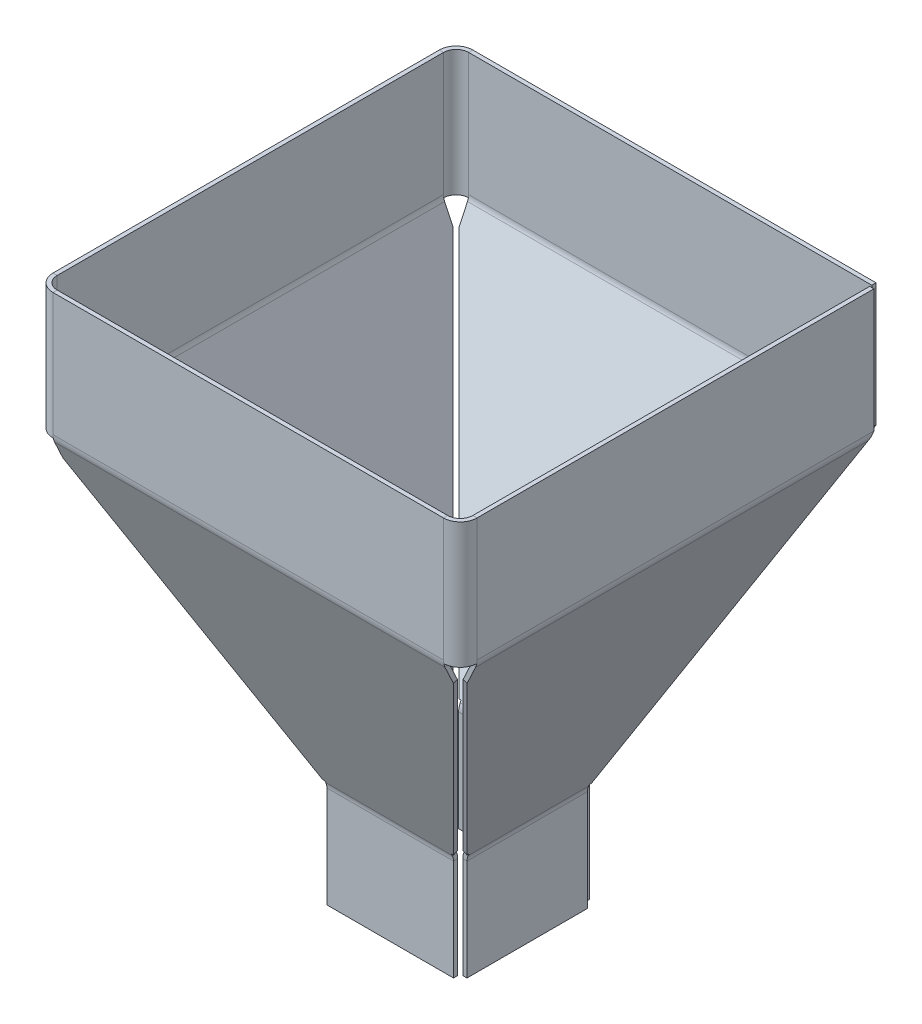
ISO-10303-21;
HEADER;
FILE_DESCRIPTION(('STEP AP214'),'2;1');
FILE_NAME('part.step','',(''),(''),'','','');
FILE_SCHEMA(('AUTOMOTIVE_DESIGN { 1 0 10303 214 1 1 1 1 }'));
ENDSEC;
DATA;
#1=APPLICATION_CONTEXT('core data for automotive mechanical design processes');
#2=APPLICATION_PROTOCOL_DEFINITION('international standard','automotive_design',2000,#1);
#3=PRODUCT_CONTEXT('',#1,'mechanical');
#4=PRODUCT('Part','Part','',(#3));
#5=PRODUCT_RELATED_PRODUCT_CATEGORY('part','',(#4));
#6=PRODUCT_DEFINITION_FORMATION('','',#4);
#7=PRODUCT_DEFINITION_CONTEXT('part definition',#1,'design');
#8=PRODUCT_DEFINITION('design','',#6,#7);
#9=PRODUCT_DEFINITION_SHAPE('','',#8);
#10=(LENGTH_UNIT() NAMED_UNIT(*) SI_UNIT(.MILLI.,.METRE.));
#11=(NAMED_UNIT(*) PLANE_ANGLE_UNIT() SI_UNIT($,.RADIAN.));
#12=(NAMED_UNIT(*) SI_UNIT($,.STERADIAN.) SOLID_ANGLE_UNIT());
#13=UNCERTAINTY_MEASURE_WITH_UNIT(LENGTH_MEASURE(1.E-05),#10,'distance_accuracy_value','');
#14=(GEOMETRIC_REPRESENTATION_CONTEXT(3) GLOBAL_UNCERTAINTY_ASSIGNED_CONTEXT((#13)) GLOBAL_UNIT_ASSIGNED_CONTEXT((#10,
#11,#12)) REPRESENTATION_CONTEXT('',''));
#15=CARTESIAN_POINT('',(0.,0.,0.));
#16=DIRECTION('',(0.,0.,1.));
#17=DIRECTION('',(1.,0.,0.));
#18=AXIS2_PLACEMENT_3D('',#15,#16,#17);
#19=CARTESIAN_POINT('',(0.,-0.0395960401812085,-0.0849139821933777));
#20=DIRECTION('',(0.,0.422618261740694,0.906307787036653));
#21=DIRECTION('',(0.,-0.906307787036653,0.422618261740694));
#22=AXIS2_PLACEMENT_3D('',#19,#20,#21);
#23=PLANE('',#22);
#24=DIRECTION('',(1.,0.,0.));
#25=VECTOR('',#24,1.);
#26=CARTESIAN_POINT('',(-65.0771244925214,-71.6703929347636,33.3170751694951));
#27=LINE('',#26,#25);
#28=CARTESIAN_POINT('',(-65.0695102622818,-71.6703929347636,33.3170751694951));
#29=VERTEX_POINT('',#28);
#30=CARTESIAN_POINT('',(-64.5771244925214,-71.6703929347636,33.3170751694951));
#31=VERTEX_POINT('',#30);
#32=EDGE_CURVE('E804',#29,#31,#27,.T.);
#33=ORIENTED_EDGE('',*,*,#32,.F.);
#34=DIRECTION('',(-0.38928162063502,0.834817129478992,-0.389281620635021));
#35=VECTOR('',#34,1.);
#36=CARTESIAN_POINT('',(-83.5491106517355,-32.0407620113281,14.8374747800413));
#37=LINE('',#36,#35);
#38=CARTESIAN_POINT('',(-96.,-5.33974363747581,2.38658543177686));
#39=VERTEX_POINT('',#38);
#40=EDGE_CURVE('E1363',#29,#39,#37,.T.);
#41=ORIENTED_EDGE('',*,*,#40,.T.);
#42=DIRECTION('',(0.,0.906307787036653,-0.422618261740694));
#43=VECTOR('',#42,1.);
#44=CARTESIAN_POINT('',(-96.,-0.422618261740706,0.0936922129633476));
#45=LINE('',#44,#43);
#46=CARTESIAN_POINT('',(-96.,-1.02538905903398,0.37476885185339));
#47=VERTEX_POINT('',#46);
#48=EDGE_CURVE('E1375',#39,#47,#45,.T.);
#49=ORIENTED_EDGE('',*,*,#48,.T.);
#50=DIRECTION('',(-1.,0.,0.));
#51=VECTOR('',#50,1.);
#52=CARTESIAN_POINT('',(0.,-1.02538905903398,0.374768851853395));
#53=LINE('',#52,#51);
#54=CARTESIAN_POINT('',(-0.988183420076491,-1.02538905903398,0.374768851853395));
#55=VERTEX_POINT('',#54);
#56=EDGE_CURVE('E1357',#55,#47,#53,.T.);
#57=ORIENTED_EDGE('',*,*,#56,.F.);
#58=DIRECTION('',(0.389281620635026,0.83481712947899,-0.38928162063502));
#59=VECTOR('',#58,1.);
#60=CARTESIAN_POINT('',(-49.3098657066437,-104.651571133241,48.6964511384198));
#61=LINE('',#60,#59);
#62=CARTESIAN_POINT('',(-33.9304897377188,-71.6703929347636,33.3170751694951));
#63=VERTEX_POINT('',#62);
#64=EDGE_CURVE('E992',#63,#55,#61,.T.);
#65=ORIENTED_EDGE('',*,*,#64,.F.);
#66=DIRECTION('',(1.,0.,0.));
#67=VECTOR('',#66,1.);
#68=CARTESIAN_POINT('',(-34.4228755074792,-71.6703929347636,33.3170751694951));
#69=LINE('',#68,#67);
#70=CARTESIAN_POINT('',(-34.4228755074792,-71.6703929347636,33.3170751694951));
#71=VERTEX_POINT('',#70);
#72=EDGE_CURVE('E104',#71,#63,#69,.T.);
#73=ORIENTED_EDGE('',*,*,#72,.F.);
#74=DIRECTION('',(0.,0.906307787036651,-0.422618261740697));
#75=VECTOR('',#74,1.);
#76=CARTESIAN_POINT('',(-34.4228755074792,-72.1235468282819,33.5283843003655));
#77=LINE('',#76,#75);
#78=CARTESIAN_POINT('',(-34.4228755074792,-72.1235468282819,33.5283843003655));
#79=VERTEX_POINT('',#78);
#80=EDGE_CURVE('E811',#79,#71,#77,.T.);
#81=ORIENTED_EDGE('',*,*,#80,.F.);
#82=DIRECTION('',(-1.,0.,0.));
#83=VECTOR('',#82,1.);
#84=CARTESIAN_POINT('',(-64.5771244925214,-72.1235468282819,33.5283843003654));
#85=LINE('',#84,#83);
#86=CARTESIAN_POINT('',(-64.5771244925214,-72.1235468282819,33.5283843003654));
#87=VERTEX_POINT('',#86);
#88=EDGE_CURVE('E637',#87,#79,#85,.F.);
#89=ORIENTED_EDGE('',*,*,#88,.F.);
#90=DIRECTION('',(0.,-0.906307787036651,0.422618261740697));
#91=VECTOR('',#90,1.);
#92=CARTESIAN_POINT('',(-64.5771244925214,-71.6703929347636,33.3170751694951));
#93=LINE('',#92,#91);
#94=EDGE_CURVE('E807',#31,#87,#93,.T.);
#95=ORIENTED_EDGE('',*,*,#94,.F.);
#96=EDGE_LOOP('',(#33,#41,#49,#57,#65,#73,#81,#89,#95));
#97=FACE_BOUND('',#96,.T.);
#98=ADVANCED_FACE('F89',(#97),#23,.F.);
#99=CARTESIAN_POINT('',(0.,0.383022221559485,0.821393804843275));
#100=DIRECTION('',(0.,0.422618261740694,0.906307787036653));
#101=DIRECTION('',(0.,-0.906307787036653,0.422618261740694));
#102=AXIS2_PLACEMENT_3D('',#99,#100,#101);
#103=PLANE('',#102);
#104=DIRECTION('',(0.38928162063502,-0.834817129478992,0.389281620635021));
#105=VECTOR('',#104,1.);
#106=CARTESIAN_POINT('',(-96.,-4.91712537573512,3.29289321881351));
#107=LINE('',#106,#105);
#108=CARTESIAN_POINT('',(-96.,-4.91712537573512,3.29289321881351));
#109=VERTEX_POINT('',#108);
#110=CARTESIAN_POINT('',(-65.0695102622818,-71.2477746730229,34.2233829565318));
#111=VERTEX_POINT('',#110);
#112=EDGE_CURVE('E1361',#109,#111,#107,.T.);
#113=ORIENTED_EDGE('',*,*,#112,.T.);
#114=DIRECTION('',(1.,0.,0.));
#115=VECTOR('',#114,1.);
#116=CARTESIAN_POINT('',(0.,-71.2477746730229,34.2233829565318));
#117=LINE('',#116,#115);
#118=CARTESIAN_POINT('',(-64.5771244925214,-71.2477746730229,34.2233829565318));
#119=VERTEX_POINT('',#118);
#120=EDGE_CURVE('E821',#111,#119,#117,.T.);
#121=ORIENTED_EDGE('',*,*,#120,.T.);
#122=DIRECTION('',(0.,-0.906307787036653,0.422618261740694));
#123=VECTOR('',#122,1.);
#124=CARTESIAN_POINT('',(-64.5771244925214,0.383022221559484,0.821393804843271));
#125=LINE('',#124,#123);
#126=CARTESIAN_POINT('',(-64.5771244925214,-71.7009285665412,34.4346920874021));
#127=VERTEX_POINT('',#126);
#128=EDGE_CURVE('E15',#119,#127,#125,.T.);
#129=ORIENTED_EDGE('',*,*,#128,.T.);
#130=DIRECTION('',(-1.,0.,0.));
#131=VECTOR('',#130,1.);
#132=CARTESIAN_POINT('',(-64.5771244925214,-71.7009285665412,34.4346920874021));
#133=LINE('',#132,#131);
#134=CARTESIAN_POINT('',(-34.4228755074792,-71.7009285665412,34.4346920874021));
#135=VERTEX_POINT('',#134);
#136=EDGE_CURVE('E587',#127,#135,#133,.F.);
#137=ORIENTED_EDGE('',*,*,#136,.T.);
#138=DIRECTION('',(0.,0.906307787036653,-0.422618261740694));
#139=VECTOR('',#138,1.);
#140=CARTESIAN_POINT('',(-34.4228755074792,0.383022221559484,0.821393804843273));
#141=LINE('',#140,#139);
#142=CARTESIAN_POINT('',(-34.4228755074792,-71.2477746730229,34.2233829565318));
#143=VERTEX_POINT('',#142);
#144=EDGE_CURVE('E97',#135,#143,#141,.T.);
#145=ORIENTED_EDGE('',*,*,#144,.T.);
#146=DIRECTION('',(1.,0.,0.));
#147=VECTOR('',#146,1.);
#148=CARTESIAN_POINT('',(0.,-71.2477746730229,34.2233829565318));
#149=LINE('',#148,#147);
#150=CARTESIAN_POINT('',(-33.9304897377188,-71.2477746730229,34.2233829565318));
#151=VERTEX_POINT('',#150);
#152=EDGE_CURVE('E806',#143,#151,#149,.T.);
#153=ORIENTED_EDGE('',*,*,#152,.T.);
#154=DIRECTION('',(0.389281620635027,0.83481712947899,-0.38928162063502));
#155=VECTOR('',#154,1.);
#156=CARTESIAN_POINT('',(-0.448411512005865,0.554773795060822,0.741304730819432));
#157=LINE('',#156,#155);
#158=CARTESIAN_POINT('',(-0.988183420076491,-0.602770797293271,1.28107663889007));
#159=VERTEX_POINT('',#158);
#160=EDGE_CURVE('E1353',#151,#159,#157,.T.);
#161=ORIENTED_EDGE('',*,*,#160,.T.);
#162=DIRECTION('',(1.,0.,0.));
#163=VECTOR('',#162,1.);
#164=CARTESIAN_POINT('',(-96.,-0.602770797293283,1.28107663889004));
#165=LINE('',#164,#163);
#166=CARTESIAN_POINT('',(-96.,-0.602770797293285,1.28107663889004));
#167=VERTEX_POINT('',#166);
#168=EDGE_CURVE('E1368',#167,#159,#165,.T.);
#169=ORIENTED_EDGE('',*,*,#168,.F.);
#170=DIRECTION('',(0.,0.906307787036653,-0.422618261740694));
#171=VECTOR('',#170,1.);
#172=CARTESIAN_POINT('',(-96.,0.,1.));
#173=LINE('',#172,#171);
#174=EDGE_CURVE('E1374',#109,#167,#173,.T.);
#175=ORIENTED_EDGE('',*,*,#174,.F.);
#176=EDGE_LOOP('',(#113,#121,#129,#137,#145,#153,#161,#169,#175));
#177=FACE_BOUND('',#176,.T.);
#178=ADVANCED_FACE('F1027',(#177),#103,.T.);
#179=CARTESIAN_POINT('',(-96.,-4.91712537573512,3.29289321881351));
#180=DIRECTION('',(0.921118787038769,0.352808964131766,-0.164517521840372));
#181=DIRECTION('',(-0.35768269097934,0.933843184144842,0.));
#182=AXIS2_PLACEMENT_3D('',#179,#180,#181);
#183=PLANE('',#182);
#184=DIRECTION('',(0.,-0.422618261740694,-0.906307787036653));
#185=VECTOR('',#184,1.);
#186=CARTESIAN_POINT('',(-65.0695102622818,-71.2477746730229,34.2233829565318));
#187=LINE('',#186,#185);
#188=EDGE_CURVE('E1339',#111,#29,#187,.T.);
#189=ORIENTED_EDGE('',*,*,#188,.F.);
#190=ORIENTED_EDGE('',*,*,#112,.F.);
#191=DIRECTION('',(0.,-0.422618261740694,-0.906307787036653));
#192=VECTOR('',#191,1.);
#193=CARTESIAN_POINT('',(-96.,-4.91712537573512,3.29289321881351));
#194=LINE('',#193,#192);
#195=EDGE_CURVE('E1358',#109,#39,#194,.T.);
#196=ORIENTED_EDGE('',*,*,#195,.T.);
#197=ORIENTED_EDGE('',*,*,#40,.F.);
#198=EDGE_LOOP('',(#189,#190,#196,#197));
#199=FACE_BOUND('',#198,.T.);
#200=ADVANCED_FACE('F1033',(#199),#183,.F.);
#201=CARTESIAN_POINT('',(-49.3098657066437,-104.651571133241,48.6964511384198));
#202=DIRECTION('',(0.921118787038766,-0.352808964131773,0.164517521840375));
#203=DIRECTION('',(0.357682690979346,0.93384318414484,0.));
#204=AXIS2_PLACEMENT_3D('',#201,#202,#203);
#205=PLANE('',#204);
#206=ORIENTED_EDGE('',*,*,#160,.F.);
#207=DIRECTION('',(0.,-0.422618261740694,-0.906307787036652));
#208=VECTOR('',#207,1.);
#209=CARTESIAN_POINT('',(-33.9304897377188,-71.6703929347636,33.3170751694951));
#210=LINE('',#209,#208);
#211=EDGE_CURVE('E1337',#151,#63,#210,.T.);
#212=ORIENTED_EDGE('',*,*,#211,.T.);
#213=ORIENTED_EDGE('',*,*,#64,.T.);
#214=DIRECTION('',(0.,0.422618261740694,0.906307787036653));
#215=VECTOR('',#214,1.);
#216=CARTESIAN_POINT('',(-0.988183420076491,-0.60277079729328,1.28107663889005));
#217=LINE('',#216,#215);
#218=EDGE_CURVE('E1377',#55,#159,#217,.T.);
#219=ORIENTED_EDGE('',*,*,#218,.T.);
#220=EDGE_LOOP('',(#206,#212,#213,#219));
#221=FACE_BOUND('',#220,.T.);
#222=ADVANCED_FACE('F1098',(#221),#205,.T.);
#223=CARTESIAN_POINT('',(-82.2242944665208,-38.3418181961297,-2.82170913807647E-13));
#224=DIRECTION('',(0.906307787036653,0.422618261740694,0.));
#225=DIRECTION('',(-0.422618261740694,0.906307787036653,0.));
#226=AXIS2_PLACEMENT_3D('',#223,#224,#225);
#227=PLANE('',#226);
#228=DIRECTION('',(0.,0.,-1.));
#229=VECTOR('',#228,1.);
#230=CARTESIAN_POINT('',(-66.6829248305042,-71.6703929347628,65.0771244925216));
#231=LINE('',#230,#229);
#232=CARTESIAN_POINT('',(-66.6829248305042,-71.6703929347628,65.0695102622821));
#233=VERTEX_POINT('',#232);
#234=CARTESIAN_POINT('',(-66.6829248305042,-71.6703929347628,64.5771244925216));
#235=VERTEX_POINT('',#234);
#236=EDGE_CURVE('E825',#233,#235,#231,.T.);
#237=ORIENTED_EDGE('',*,*,#236,.F.);
#238=DIRECTION('',(0.389281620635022,-0.834817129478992,-0.389281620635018));
#239=VECTOR('',#238,1.);
#240=CARTESIAN_POINT('',(-70.0085072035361,-64.538658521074,68.3950926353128));
#241=LINE('',#240,#239);
#242=CARTESIAN_POINT('',(-97.6134145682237,-5.33974363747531,96.0000000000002));
#243=VERTEX_POINT('',#242);
#244=EDGE_CURVE('E1404',#243,#233,#241,.T.);
#245=ORIENTED_EDGE('',*,*,#244,.F.);
#246=DIRECTION('',(-0.422618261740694,0.906307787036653,0.));
#247=VECTOR('',#246,1.);
#248=CARTESIAN_POINT('',(-99.906307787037,-0.422618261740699,96.));
#249=LINE('',#248,#247);
#250=CARTESIAN_POINT('',(-99.6252311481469,-1.02538905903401,96.));
#251=VERTEX_POINT('',#250);
#252=EDGE_CURVE('E1432',#243,#251,#249,.T.);
#253=ORIENTED_EDGE('',*,*,#252,.T.);
#254=DIRECTION('',(0.,0.,1.));
#255=VECTOR('',#254,1.);
#256=CARTESIAN_POINT('',(-99.6252311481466,-1.02538905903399,-3.48171556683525E-13));
#257=LINE('',#256,#255);
#258=CARTESIAN_POINT('',(-99.6252311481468,-1.02538905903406,4.00000000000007));
#259=VERTEX_POINT('',#258);
#260=EDGE_CURVE('E1423',#259,#251,#257,.T.);
#261=ORIENTED_EDGE('',*,*,#260,.F.);
#262=DIRECTION('',(0.422618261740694,-0.906307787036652,0.));
#263=VECTOR('',#262,1.);
#264=CARTESIAN_POINT('',(-66.1905390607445,-72.7263176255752,4.0000000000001));
#265=LINE('',#264,#263);
#266=CARTESIAN_POINT('',(-97.6134145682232,-5.33974363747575,4.00000000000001));
#267=VERTEX_POINT('',#266);
#268=EDGE_CURVE('E1429',#259,#267,#265,.T.);
#269=ORIENTED_EDGE('',*,*,#268,.T.);
#270=DIRECTION('',(-0.38928162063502,0.834817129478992,-0.389281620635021));
#271=VECTOR('',#270,1.);
#272=CARTESIAN_POINT('',(-85.1625252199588,-32.0407620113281,16.4508893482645));
#273=LINE('',#272,#271);
#274=CARTESIAN_POINT('',(-66.6829248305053,-71.6703929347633,34.9304897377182));
#275=VERTEX_POINT('',#274);
#276=EDGE_CURVE('E1413',#275,#267,#273,.T.);
#277=ORIENTED_EDGE('',*,*,#276,.F.);
#278=DIRECTION('',(0.,0.,-1.));
#279=VECTOR('',#278,1.);
#280=CARTESIAN_POINT('',(-66.6829248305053,-71.6703929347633,35.4228755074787));
#281=LINE('',#280,#279);
#282=CARTESIAN_POINT('',(-66.6829248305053,-71.6703929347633,35.4228755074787));
#283=VERTEX_POINT('',#282);
#284=EDGE_CURVE('E834',#283,#275,#281,.T.);
#285=ORIENTED_EDGE('',*,*,#284,.F.);
#286=DIRECTION('',(-0.422618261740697,0.906307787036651,0.));
#287=VECTOR('',#286,1.);
#288=CARTESIAN_POINT('',(-66.471615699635,-72.1235468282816,35.4228755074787));
#289=LINE('',#288,#287);
#290=CARTESIAN_POINT('',(-66.471615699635,-72.1235468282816,35.4228755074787));
#291=VERTEX_POINT('',#290);
#292=EDGE_CURVE('E831',#291,#283,#289,.T.);
#293=ORIENTED_EDGE('',*,*,#292,.F.);
#294=DIRECTION('',(0.,0.,1.));
#295=VECTOR('',#294,1.);
#296=CARTESIAN_POINT('',(-66.4716156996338,-72.1235468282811,64.5771244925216));
#297=LINE('',#296,#295);
#298=CARTESIAN_POINT('',(-66.4716156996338,-72.1235468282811,64.5771244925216));
#299=VERTEX_POINT('',#298);
#300=EDGE_CURVE('E688',#299,#291,#297,.F.);
#301=ORIENTED_EDGE('',*,*,#300,.F.);
#302=DIRECTION('',(0.422618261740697,-0.906307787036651,0.));
#303=VECTOR('',#302,1.);
#304=CARTESIAN_POINT('',(-66.6829248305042,-71.6703929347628,64.5771244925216));
#305=LINE('',#304,#303);
#306=EDGE_CURVE('E827',#235,#299,#305,.T.);
#307=ORIENTED_EDGE('',*,*,#306,.F.);
#308=EDGE_LOOP('',(#237,#245,#253,#261,#269,#277,#285,#293,#301,#307));
#309=FACE_BOUND('',#308,.T.);
#310=ADVANCED_FACE('F1095',(#309),#227,.F.);
#311=CARTESIAN_POINT('',(-81.3179866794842,-37.919199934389,-2.79032147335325E-13));
#312=DIRECTION('',(0.906307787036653,0.422618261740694,0.));
#313=DIRECTION('',(-0.422618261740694,0.906307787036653,0.));
#314=AXIS2_PLACEMENT_3D('',#311,#312,#313);
#315=PLANE('',#314);
#316=DIRECTION('',(-0.389281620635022,0.834817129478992,0.389281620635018));
#317=VECTOR('',#316,1.);
#318=CARTESIAN_POINT('',(-65.2842312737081,-72.3036993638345,64.5771244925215));
#319=LINE('',#318,#317);
#320=CARTESIAN_POINT('',(-65.7766170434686,-71.2477746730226,65.0695102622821));
#321=VERTEX_POINT('',#320);
#322=CARTESIAN_POINT('',(-96.7071067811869,-4.91712537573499,96.));
#323=VERTEX_POINT('',#322);
#324=EDGE_CURVE('E1399',#321,#323,#319,.T.);
#325=ORIENTED_EDGE('',*,*,#324,.F.);
#326=DIRECTION('',(0.,0.,-1.));
#327=VECTOR('',#326,1.);
#328=CARTESIAN_POINT('',(-65.7766170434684,-71.2477746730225,-2.79032147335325E-13));
#329=LINE('',#328,#327);
#330=CARTESIAN_POINT('',(-65.7766170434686,-71.2477746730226,64.5771244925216));
#331=VERTEX_POINT('',#330);
#332=EDGE_CURVE('E112',#321,#331,#329,.T.);
#333=ORIENTED_EDGE('',*,*,#332,.T.);
#334=DIRECTION('',(0.422618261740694,-0.906307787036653,0.));
#335=VECTOR('',#334,1.);
#336=CARTESIAN_POINT('',(-81.3179866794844,-37.9191999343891,64.5771244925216));
#337=LINE('',#336,#335);
#338=CARTESIAN_POINT('',(-65.5653079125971,-71.7009285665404,64.5771244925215));
#339=VERTEX_POINT('',#338);
#340=EDGE_CURVE('E1334',#331,#339,#337,.T.);
#341=ORIENTED_EDGE('',*,*,#340,.T.);
#342=DIRECTION('',(0.,0.,1.));
#343=VECTOR('',#342,1.);
#344=CARTESIAN_POINT('',(-65.5653079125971,-71.7009285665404,64.5771244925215));
#345=LINE('',#344,#343);
#346=CARTESIAN_POINT('',(-65.5653079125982,-71.7009285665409,35.4228755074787));
#347=VERTEX_POINT('',#346);
#348=EDGE_CURVE('E675',#339,#347,#345,.F.);
#349=ORIENTED_EDGE('',*,*,#348,.T.);
#350=DIRECTION('',(-0.422618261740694,0.906307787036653,0.));
#351=VECTOR('',#350,1.);
#352=CARTESIAN_POINT('',(-81.3179866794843,-37.9191999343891,35.4228755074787));
#353=LINE('',#352,#351);
#354=CARTESIAN_POINT('',(-65.7766170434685,-71.2477746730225,35.4228755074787));
#355=VERTEX_POINT('',#354);
#356=EDGE_CURVE('E1331',#347,#355,#353,.T.);
#357=ORIENTED_EDGE('',*,*,#356,.T.);
#358=DIRECTION('',(0.,0.,-1.));
#359=VECTOR('',#358,1.);
#360=CARTESIAN_POINT('',(-65.7766170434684,-71.2477746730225,-2.79032147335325E-13));
#361=LINE('',#360,#359);
#362=CARTESIAN_POINT('',(-65.7766170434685,-71.2477746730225,34.9304897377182));
#363=VERTEX_POINT('',#362);
#364=EDGE_CURVE('E840',#355,#363,#361,.T.);
#365=ORIENTED_EDGE('',*,*,#364,.T.);
#366=DIRECTION('',(0.38928162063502,-0.834817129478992,0.389281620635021));
#367=VECTOR('',#366,1.);
#368=CARTESIAN_POINT('',(-96.7071067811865,-4.91712537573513,4.00000000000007));
#369=LINE('',#368,#367);
#370=CARTESIAN_POINT('',(-96.7071067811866,-4.91712537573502,4.00000000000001));
#371=VERTEX_POINT('',#370);
#372=EDGE_CURVE('E1410',#371,#363,#369,.T.);
#373=ORIENTED_EDGE('',*,*,#372,.F.);
#374=DIRECTION('',(0.422618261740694,-0.906307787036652,0.));
#375=VECTOR('',#374,1.);
#376=CARTESIAN_POINT('',(-65.2842312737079,-72.3036993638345,4.0000000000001));
#377=LINE('',#376,#375);
#378=CARTESIAN_POINT('',(-98.7189233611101,-0.602770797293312,4.00000000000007));
#379=VERTEX_POINT('',#378);
#380=EDGE_CURVE('E1428',#379,#371,#377,.T.);
#381=ORIENTED_EDGE('',*,*,#380,.F.);
#382=DIRECTION('',(0.,0.,-1.));
#383=VECTOR('',#382,1.);
#384=CARTESIAN_POINT('',(-98.7189233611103,-0.602770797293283,96.0000000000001));
#385=LINE('',#384,#383);
#386=CARTESIAN_POINT('',(-98.7189233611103,-0.602770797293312,96.));
#387=VERTEX_POINT('',#386);
#388=EDGE_CURVE('E1418',#387,#379,#385,.T.);
#389=ORIENTED_EDGE('',*,*,#388,.F.);
#390=DIRECTION('',(-0.422618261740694,0.906307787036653,0.));
#391=VECTOR('',#390,1.);
#392=CARTESIAN_POINT('',(-99.0000000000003,0.,96.));
#393=LINE('',#392,#391);
#394=EDGE_CURVE('E1433',#323,#387,#393,.T.);
#395=ORIENTED_EDGE('',*,*,#394,.F.);
#396=EDGE_LOOP('',(#325,#333,#341,#349,#357,#365,#373,#381,#389,#395));
#397=FACE_BOUND('',#396,.T.);
#398=ADVANCED_FACE('F1093',(#397),#315,.T.);
#399=CARTESIAN_POINT('',(-96.7071067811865,-4.91712537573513,4.00000000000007));
#400=DIRECTION('',(0.164517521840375,-0.352808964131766,-0.921118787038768));
#401=DIRECTION('',(0.,0.933843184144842,-0.35768269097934));
#402=AXIS2_PLACEMENT_3D('',#399,#400,#401);
#403=PLANE('',#402);
#404=ORIENTED_EDGE('',*,*,#372,.T.);
#405=DIRECTION('',(-0.906307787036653,-0.422618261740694,0.));
#406=VECTOR('',#405,1.);
#407=CARTESIAN_POINT('',(-65.7766170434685,-71.2477746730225,34.9304897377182));
#408=LINE('',#407,#406);
#409=EDGE_CURVE('E1328',#363,#275,#408,.T.);
#410=ORIENTED_EDGE('',*,*,#409,.T.);
#411=ORIENTED_EDGE('',*,*,#276,.T.);
#412=DIRECTION('',(-0.906307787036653,-0.422618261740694,0.));
#413=VECTOR('',#412,1.);
#414=CARTESIAN_POINT('',(-96.7071067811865,-4.91712537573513,4.00000000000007));
#415=LINE('',#414,#413);
#416=EDGE_CURVE('E1409',#371,#267,#415,.T.);
#417=ORIENTED_EDGE('',*,*,#416,.F.);
#418=EDGE_LOOP('',(#404,#410,#411,#417));
#419=FACE_BOUND('',#418,.T.);
#420=ADVANCED_FACE('F1089',(#419),#403,.T.);
#421=CARTESIAN_POINT('',(-65.2842312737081,-72.3036993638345,64.5771244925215));
#422=DIRECTION('',(0.164517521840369,-0.352808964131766,0.921118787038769));
#423=DIRECTION('',(0.,-0.933843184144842,-0.357682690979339));
#424=AXIS2_PLACEMENT_3D('',#421,#422,#423);
#425=PLANE('',#424);
#426=ORIENTED_EDGE('',*,*,#244,.T.);
#427=DIRECTION('',(0.906307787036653,0.422618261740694,0.));
#428=VECTOR('',#427,1.);
#429=CARTESIAN_POINT('',(-65.7766170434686,-71.2477746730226,65.0695102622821));
#430=LINE('',#429,#428);
#431=EDGE_CURVE('E1326',#233,#321,#430,.T.);
#432=ORIENTED_EDGE('',*,*,#431,.T.);
#433=ORIENTED_EDGE('',*,*,#324,.T.);
#434=DIRECTION('',(-0.906307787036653,-0.422618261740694,0.));
#435=VECTOR('',#434,1.);
#436=CARTESIAN_POINT('',(-96.707106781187,-4.9171253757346,96.0000000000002));
#437=LINE('',#436,#435);
#438=EDGE_CURVE('E1400',#323,#243,#437,.T.);
#439=ORIENTED_EDGE('',*,*,#438,.T.);
#440=EDGE_LOOP('',(#426,#432,#433,#439));
#441=FACE_BOUND('',#440,.T.);
#442=ADVANCED_FACE('F1079',(#441),#425,.T.);
#443=CARTESIAN_POINT('',(-5.64284651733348E-13,-38.34181819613,82.2242944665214));
#444=DIRECTION('',(0.,0.422618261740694,-0.906307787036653));
#445=DIRECTION('',(0.,0.906307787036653,0.422618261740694));
#446=AXIS2_PLACEMENT_3D('',#443,#444,#445);
#447=PLANE('',#446);
#448=DIRECTION('',(-1.,0.,0.));
#449=VECTOR('',#448,1.);
#450=CARTESIAN_POINT('',(-33.922875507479,-71.6703929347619,66.6829248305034));
#451=LINE('',#450,#449);
#452=CARTESIAN_POINT('',(-33.9304897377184,-71.6703929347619,66.6829248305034));
#453=VERTEX_POINT('',#452);
#454=CARTESIAN_POINT('',(-34.422875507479,-71.6703929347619,66.6829248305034));
#455=VERTEX_POINT('',#454);
#456=EDGE_CURVE('E844',#453,#455,#451,.T.);
#457=ORIENTED_EDGE('',*,*,#456,.F.);
#458=DIRECTION('',(-0.389281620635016,-0.834817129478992,-0.389281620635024));
#459=VECTOR('',#458,1.);
#460=CARTESIAN_POINT('',(-15.6024295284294,-32.3657409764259,85.0109850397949));
#461=LINE('',#460,#459);
#462=CARTESIAN_POINT('',(-3.00000000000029,-5.33974363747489,97.6134145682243));
#463=VERTEX_POINT('',#462);
#464=EDGE_CURVE('E892',#463,#453,#461,.T.);
#465=ORIENTED_EDGE('',*,*,#464,.F.);
#466=DIRECTION('',(0.,0.906307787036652,0.422618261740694));
#467=VECTOR('',#466,1.);
#468=CARTESIAN_POINT('',(-3.00000000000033,-0.422618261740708,99.9063077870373));
#469=LINE('',#468,#467);
#470=CARTESIAN_POINT('',(-3.00000000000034,-1.025389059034,99.6252311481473));
#471=VERTEX_POINT('',#470);
#472=EDGE_CURVE('E918',#463,#471,#469,.T.);
#473=ORIENTED_EDGE('',*,*,#472,.T.);
#474=DIRECTION('',(1.,0.,0.));
#475=VECTOR('',#474,1.);
#476=CARTESIAN_POINT('',(-6.72967843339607E-13,-1.02538905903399,99.6252311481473));
#477=LINE('',#476,#475);
#478=CARTESIAN_POINT('',(-96.0000000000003,-1.02538905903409,99.625231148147));
#479=VERTEX_POINT('',#478);
#480=EDGE_CURVE('E909',#479,#471,#477,.T.);
#481=ORIENTED_EDGE('',*,*,#480,.F.);
#482=DIRECTION('',(0.,-0.906307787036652,-0.422618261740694));
#483=VECTOR('',#482,1.);
#484=CARTESIAN_POINT('',(-96.0000000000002,-72.7263176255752,66.1905390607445));
#485=LINE('',#484,#483);
#486=CARTESIAN_POINT('',(-96.0000000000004,-5.33974363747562,97.6134145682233));
#487=VERTEX_POINT('',#486);
#488=EDGE_CURVE('E915',#479,#487,#485,.T.);
#489=ORIENTED_EDGE('',*,*,#488,.T.);
#490=DIRECTION('',(-0.389281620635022,0.834817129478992,0.389281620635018));
#491=VECTOR('',#490,1.);
#492=CARTESIAN_POINT('',(-68.3950926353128,-64.538658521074,70.0085072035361));
#493=LINE('',#492,#491);
#494=CARTESIAN_POINT('',(-65.0695102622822,-71.6703929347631,66.6829248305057));
#495=VERTEX_POINT('',#494);
#496=EDGE_CURVE('E899',#495,#487,#493,.T.);
#497=ORIENTED_EDGE('',*,*,#496,.F.);
#498=DIRECTION('',(-1.,0.,0.));
#499=VECTOR('',#498,1.);
#500=CARTESIAN_POINT('',(-64.5771244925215,-71.6703929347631,66.6829248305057));
#501=LINE('',#500,#499);
#502=CARTESIAN_POINT('',(-64.5771244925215,-71.6703929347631,66.6829248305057));
#503=VERTEX_POINT('',#502);
#504=EDGE_CURVE('E854',#503,#495,#501,.T.);
#505=ORIENTED_EDGE('',*,*,#504,.F.);
#506=DIRECTION('',(0.,0.906307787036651,0.422618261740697));
#507=VECTOR('',#506,1.);
#508=CARTESIAN_POINT('',(-64.5771244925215,-72.1235468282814,66.4716156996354));
#509=LINE('',#508,#507);
#510=CARTESIAN_POINT('',(-64.5771244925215,-72.1235468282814,66.4716156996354));
#511=VERTEX_POINT('',#510);
#512=EDGE_CURVE('E851',#511,#503,#509,.T.);
#513=ORIENTED_EDGE('',*,*,#512,.F.);
#514=DIRECTION('',(1.,0.,0.));
#515=VECTOR('',#514,1.);
#516=CARTESIAN_POINT('',(-34.422875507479,-72.1235468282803,66.471615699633));
#517=LINE('',#516,#515);
#518=CARTESIAN_POINT('',(-34.422875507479,-72.1235468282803,66.471615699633));
#519=VERTEX_POINT('',#518);
#520=EDGE_CURVE('E741',#519,#511,#517,.F.);
#521=ORIENTED_EDGE('',*,*,#520,.F.);
#522=DIRECTION('',(0.,-0.906307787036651,-0.422618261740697));
#523=VECTOR('',#522,1.);
#524=CARTESIAN_POINT('',(-34.422875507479,-71.6703929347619,66.6829248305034));
#525=LINE('',#524,#523);
#526=EDGE_CURVE('E847',#455,#519,#525,.T.);
#527=ORIENTED_EDGE('',*,*,#526,.F.);
#528=EDGE_LOOP('',(#457,#465,#473,#481,#489,#497,#505,#513,#521,#527));
#529=FACE_BOUND('',#528,.T.);
#530=ADVANCED_FACE('F1088',(#529),#447,.F.);
#531=CARTESIAN_POINT('',(-5.58064889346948E-13,-37.9191999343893,81.3179866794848));
#532=DIRECTION('',(0.,0.422618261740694,-0.906307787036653));
#533=DIRECTION('',(0.,0.906307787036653,0.422618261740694));
#534=AXIS2_PLACEMENT_3D('',#531,#532,#533);
#535=PLANE('',#534);
#536=DIRECTION('',(0.389281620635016,0.834817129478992,0.389281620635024));
#537=VECTOR('',#536,1.);
#538=CARTESIAN_POINT('',(-34.422875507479,-72.3036993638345,65.2842312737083));
#539=LINE('',#538,#537);
#540=CARTESIAN_POINT('',(-33.9304897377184,-71.2477746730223,65.7766170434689));
#541=VERTEX_POINT('',#540);
#542=CARTESIAN_POINT('',(-3.00000000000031,-4.91712537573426,96.7071067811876));
#543=VERTEX_POINT('',#542);
#544=EDGE_CURVE('E887',#541,#543,#539,.T.);
#545=ORIENTED_EDGE('',*,*,#544,.F.);
#546=DIRECTION('',(-1.,0.,0.));
#547=VECTOR('',#546,1.);
#548=CARTESIAN_POINT('',(-5.58064889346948E-13,-71.2477746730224,65.7766170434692));
#549=LINE('',#548,#547);
#550=CARTESIAN_POINT('',(-34.422875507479,-71.2477746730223,65.776617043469));
#551=VERTEX_POINT('',#550);
#552=EDGE_CURVE('E846',#541,#551,#549,.T.);
#553=ORIENTED_EDGE('',*,*,#552,.T.);
#554=DIRECTION('',(0.,-0.906307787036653,-0.422618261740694));
#555=VECTOR('',#554,1.);
#556=CARTESIAN_POINT('',(-34.422875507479,-37.9191999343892,81.3179866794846));
#557=LINE('',#556,#555);
#558=CARTESIAN_POINT('',(-34.4228755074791,-71.7009285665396,65.5653079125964));
#559=VERTEX_POINT('',#558);
#560=EDGE_CURVE('E1323',#551,#559,#557,.T.);
#561=ORIENTED_EDGE('',*,*,#560,.T.);
#562=DIRECTION('',(1.,0.,0.));
#563=VECTOR('',#562,1.);
#564=CARTESIAN_POINT('',(-34.4228755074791,-71.7009285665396,65.5653079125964));
#565=LINE('',#564,#563);
#566=CARTESIAN_POINT('',(-64.5771244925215,-71.7009285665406,65.5653079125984));
#567=VERTEX_POINT('',#566);
#568=EDGE_CURVE('E728',#559,#567,#565,.F.);
#569=ORIENTED_EDGE('',*,*,#568,.T.);
#570=DIRECTION('',(0.,0.906307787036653,0.422618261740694));
#571=VECTOR('',#570,1.);
#572=CARTESIAN_POINT('',(-64.5771244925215,-37.9191999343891,81.3179866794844));
#573=LINE('',#572,#571);
#574=CARTESIAN_POINT('',(-64.5771244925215,-71.2477746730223,65.7766170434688));
#575=VERTEX_POINT('',#574);
#576=EDGE_CURVE('E1320',#567,#575,#573,.T.);
#577=ORIENTED_EDGE('',*,*,#576,.T.);
#578=DIRECTION('',(-1.,0.,0.));
#579=VECTOR('',#578,1.);
#580=CARTESIAN_POINT('',(-5.58064889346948E-13,-71.2477746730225,65.7766170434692));
#581=LINE('',#580,#579);
#582=CARTESIAN_POINT('',(-65.0695102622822,-71.2477746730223,65.7766170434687));
#583=VERTEX_POINT('',#582);
#584=EDGE_CURVE('E862',#575,#583,#581,.T.);
#585=ORIENTED_EDGE('',*,*,#584,.T.);
#586=DIRECTION('',(0.389281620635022,-0.834817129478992,-0.389281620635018));
#587=VECTOR('',#586,1.);
#588=CARTESIAN_POINT('',(-96.0000000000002,-4.91712537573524,96.7071067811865));
#589=LINE('',#588,#587);
#590=CARTESIAN_POINT('',(-96.0000000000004,-4.91712537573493,96.7071067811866));
#591=VERTEX_POINT('',#590);
#592=EDGE_CURVE('E896',#591,#583,#589,.T.);
#593=ORIENTED_EDGE('',*,*,#592,.F.);
#594=DIRECTION('',(0.,-0.906307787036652,-0.422618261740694));
#595=VECTOR('',#594,1.);
#596=CARTESIAN_POINT('',(-96.0000000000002,-72.3036993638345,65.2842312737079));
#597=LINE('',#596,#595);
#598=CARTESIAN_POINT('',(-96.0000000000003,-0.602770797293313,98.7189233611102));
#599=VERTEX_POINT('',#598);
#600=EDGE_CURVE('E914',#599,#591,#597,.T.);
#601=ORIENTED_EDGE('',*,*,#600,.F.);
#602=DIRECTION('',(-1.,0.,0.));
#603=VECTOR('',#602,1.);
#604=CARTESIAN_POINT('',(-3.00000000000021,-0.602770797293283,98.7189233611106));
#605=LINE('',#604,#603);
#606=CARTESIAN_POINT('',(-3.00000000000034,-0.602770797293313,98.7189233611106));
#607=VERTEX_POINT('',#606);
#608=EDGE_CURVE('E904',#607,#599,#605,.T.);
#609=ORIENTED_EDGE('',*,*,#608,.F.);
#610=DIRECTION('',(0.,0.906307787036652,0.422618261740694));
#611=VECTOR('',#610,1.);
#612=CARTESIAN_POINT('',(-3.00000000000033,0.,99.0000000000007));
#613=LINE('',#612,#611);
#614=EDGE_CURVE('E919',#543,#607,#613,.T.);
#615=ORIENTED_EDGE('',*,*,#614,.F.);
#616=EDGE_LOOP('',(#545,#553,#561,#569,#577,#585,#593,#601,#609,#615));
#617=FACE_BOUND('',#616,.T.);
#618=ADVANCED_FACE('F1765',(#617),#535,.T.);
#619=CARTESIAN_POINT('',(-96.0000000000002,-4.91712537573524,96.7071067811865));
#620=DIRECTION('',(-0.921118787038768,-0.352808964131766,-0.164517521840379));
#621=DIRECTION('',(0.35768269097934,-0.933843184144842,0.));
#622=AXIS2_PLACEMENT_3D('',#619,#620,#621);
#623=PLANE('',#622);
#624=ORIENTED_EDGE('',*,*,#592,.T.);
#625=DIRECTION('',(0.,-0.422618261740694,0.906307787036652));
#626=VECTOR('',#625,1.);
#627=CARTESIAN_POINT('',(-65.0695102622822,-71.2477746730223,65.7766170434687));
#628=LINE('',#627,#626);
#629=EDGE_CURVE('E1317',#583,#495,#628,.T.);
#630=ORIENTED_EDGE('',*,*,#629,.T.);
#631=ORIENTED_EDGE('',*,*,#496,.T.);
#632=DIRECTION('',(0.,-0.422618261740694,0.906307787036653));
#633=VECTOR('',#632,1.);
#634=CARTESIAN_POINT('',(-96.0000000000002,-4.91712537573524,96.7071067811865));
#635=LINE('',#634,#633);
#636=EDGE_CURVE('E895',#591,#487,#635,.T.);
#637=ORIENTED_EDGE('',*,*,#636,.F.);
#638=EDGE_LOOP('',(#624,#630,#631,#637));
#639=FACE_BOUND('',#638,.T.);
#640=ADVANCED_FACE('F1761',(#639),#623,.T.);
#641=CARTESIAN_POINT('',(-34.422875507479,-72.3036993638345,65.2842312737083));
#642=DIRECTION('',(0.92111878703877,-0.352808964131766,-0.164517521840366));
#643=DIRECTION('',(0.357682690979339,0.933843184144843,0.));
#644=AXIS2_PLACEMENT_3D('',#641,#642,#643);
#645=PLANE('',#644);
#646=ORIENTED_EDGE('',*,*,#464,.T.);
#647=DIRECTION('',(0.,0.422618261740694,-0.906307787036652));
#648=VECTOR('',#647,1.);
#649=CARTESIAN_POINT('',(-33.9304897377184,-71.2477746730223,65.7766170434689));
#650=LINE('',#649,#648);
#651=EDGE_CURVE('E1314',#453,#541,#650,.T.);
#652=ORIENTED_EDGE('',*,*,#651,.T.);
#653=ORIENTED_EDGE('',*,*,#544,.T.);
#654=DIRECTION('',(0.,-0.422618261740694,0.906307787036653));
#655=VECTOR('',#654,1.);
#656=CARTESIAN_POINT('',(-3.00000000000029,-4.91712537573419,96.7071067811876));
#657=LINE('',#656,#655);
#658=EDGE_CURVE('E889',#543,#463,#657,.T.);
#659=ORIENTED_EDGE('',*,*,#658,.T.);
#660=EDGE_LOOP('',(#646,#652,#653,#659));
#661=FACE_BOUND('',#660,.T.);
#662=ADVANCED_FACE('F1758',(#661),#645,.T.);
#663=CARTESIAN_POINT('',(0.906307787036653,-0.422618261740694,0.));
#664=DIRECTION('',(-0.906307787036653,0.422618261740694,0.));
#665=DIRECTION('',(-0.422618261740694,-0.906307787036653,0.));
#666=AXIS2_PLACEMENT_3D('',#663,#664,#665);
#667=PLANE('',#666);
#668=DIRECTION('',(0.,0.,1.));
#669=VECTOR('',#668,1.);
#670=CARTESIAN_POINT('',(-32.3170751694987,-71.670392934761,35.422875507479));
#671=LINE('',#670,#669);
#672=CARTESIAN_POINT('',(-32.3170751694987,-71.670392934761,35.4304897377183));
#673=VERTEX_POINT('',#672);
#674=CARTESIAN_POINT('',(-32.3170751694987,-71.670392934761,35.922875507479));
#675=VERTEX_POINT('',#674);
#676=EDGE_CURVE('E866',#673,#675,#671,.T.);
#677=ORIENTED_EDGE('',*,*,#676,.F.);
#678=DIRECTION('',(-0.38928162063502,-0.834817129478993,0.389281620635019));
#679=VECTOR('',#678,1.);
#680=CARTESIAN_POINT('',(0.625231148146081,-1.02538905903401,2.4881834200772));
#681=LINE('',#680,#679);
#682=CARTESIAN_POINT('',(0.625231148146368,-1.02538905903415,2.48818342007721));
#683=VERTEX_POINT('',#682);
#684=EDGE_CURVE('E934',#683,#673,#681,.T.);
#685=ORIENTED_EDGE('',*,*,#684,.F.);
#686=DIRECTION('',(0.,0.,-1.));
#687=VECTOR('',#686,1.);
#688=CARTESIAN_POINT('',(0.625231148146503,-1.0253890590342,0.));
#689=LINE('',#688,#687);
#690=CARTESIAN_POINT('',(0.625231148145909,-1.02538905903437,96.0000000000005));
#691=VERTEX_POINT('',#690);
#692=EDGE_CURVE('E964',#691,#683,#689,.T.);
#693=ORIENTED_EDGE('',*,*,#692,.F.);
#694=DIRECTION('',(-0.422618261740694,-0.906307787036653,0.));
#695=VECTOR('',#694,1.);
#696=CARTESIAN_POINT('',(-32.8094609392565,-72.7263176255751,96.0000000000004));
#697=LINE('',#696,#695);
#698=CARTESIAN_POINT('',(-1.38658543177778,-5.33974363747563,96.0000000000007));
#699=VERTEX_POINT('',#698);
#700=EDGE_CURVE('E967',#691,#699,#697,.T.);
#701=ORIENTED_EDGE('',*,*,#700,.T.);
#702=DIRECTION('',(-0.389281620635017,-0.834817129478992,-0.389281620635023));
#703=VECTOR('',#702,1.);
#704=CARTESIAN_POINT('',(-13.9890149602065,-32.3657409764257,83.3975704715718));
#705=LINE('',#704,#703);
#706=CARTESIAN_POINT('',(-32.3170751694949,-71.6703929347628,65.0695102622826));
#707=VERTEX_POINT('',#706);
#708=EDGE_CURVE('E956',#699,#707,#705,.T.);
#709=ORIENTED_EDGE('',*,*,#708,.T.);
#710=DIRECTION('',(0.,0.,1.));
#711=VECTOR('',#710,1.);
#712=CARTESIAN_POINT('',(-32.3170751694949,-71.6703929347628,64.5771244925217));
#713=LINE('',#712,#711);
#714=CARTESIAN_POINT('',(-32.3170751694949,-71.6703929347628,64.5771244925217));
#715=VERTEX_POINT('',#714);
#716=EDGE_CURVE('E876',#715,#707,#713,.T.);
#717=ORIENTED_EDGE('',*,*,#716,.F.);
#718=DIRECTION('',(0.422618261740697,0.906307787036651,0.));
#719=VECTOR('',#718,1.);
#720=CARTESIAN_POINT('',(-32.5283843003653,-72.1235468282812,64.5771244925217));
#721=LINE('',#720,#719);
#722=CARTESIAN_POINT('',(-32.5283843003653,-72.1235468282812,64.5771244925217));
#723=VERTEX_POINT('',#722);
#724=EDGE_CURVE('E873',#723,#715,#721,.T.);
#725=ORIENTED_EDGE('',*,*,#724,.F.);
#726=DIRECTION('',(-1.32995466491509E-13,0.,-1.));
#727=VECTOR('',#726,1.);
#728=CARTESIAN_POINT('',(-32.5283843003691,-72.1235468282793,35.922875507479));
#729=LINE('',#728,#727);
#730=CARTESIAN_POINT('',(-32.5283843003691,-72.1235468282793,35.922875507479));
#731=VERTEX_POINT('',#730);
#732=EDGE_CURVE('E794',#731,#723,#729,.F.);
#733=ORIENTED_EDGE('',*,*,#732,.F.);
#734=DIRECTION('',(-0.422618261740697,-0.906307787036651,0.));
#735=VECTOR('',#734,1.);
#736=CARTESIAN_POINT('',(-32.3170751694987,-71.670392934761,35.922875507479));
#737=LINE('',#736,#735);
#738=EDGE_CURVE('E869',#675,#731,#737,.T.);
#739=ORIENTED_EDGE('',*,*,#738,.F.);
#740=EDGE_LOOP('',(#677,#685,#693,#701,#709,#717,#725,#733,#739));
#741=FACE_BOUND('',#740,.T.);
#742=ADVANCED_FACE('F1628',(#741),#667,.F.);
#743=CARTESIAN_POINT('',(0.,0.,0.));
#744=DIRECTION('',(-0.906307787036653,0.422618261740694,0.));
#745=DIRECTION('',(-0.422618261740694,-0.906307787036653,0.));
#746=AXIS2_PLACEMENT_3D('',#743,#744,#745);
#747=PLANE('',#746);
#748=DIRECTION('',(-0.389281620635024,-0.834817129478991,0.389281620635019));
#749=VECTOR('',#748,1.);
#750=CARTESIAN_POINT('',(0.334465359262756,0.717263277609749,1.87264142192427));
#751=LINE('',#750,#749);
#752=CARTESIAN_POINT('',(-0.281076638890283,-0.602770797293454,2.4881834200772));
#753=VERTEX_POINT('',#752);
#754=CARTESIAN_POINT('',(-33.2233829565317,-71.247774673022,35.4304897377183));
#755=VERTEX_POINT('',#754);
#756=EDGE_CURVE('E948',#753,#755,#751,.T.);
#757=ORIENTED_EDGE('',*,*,#756,.T.);
#758=DIRECTION('',(0.,0.,1.));
#759=VECTOR('',#758,1.);
#760=CARTESIAN_POINT('',(-33.2233829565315,-71.2477746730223,4.61067058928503E-13));
#761=LINE('',#760,#759);
#762=CARTESIAN_POINT('',(-33.2233829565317,-71.247774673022,35.922875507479));
#763=VERTEX_POINT('',#762);
#764=EDGE_CURVE('E868',#755,#763,#761,.T.);
#765=ORIENTED_EDGE('',*,*,#764,.T.);
#766=DIRECTION('',(-0.422618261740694,-0.906307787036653,0.));
#767=VECTOR('',#766,1.);
#768=CARTESIAN_POINT('',(-3.0920408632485E-13,1.44184233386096E-13,35.922875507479));
#769=LINE('',#768,#767);
#770=CARTESIAN_POINT('',(-33.4346920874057,-71.7009285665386,35.9228755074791));
#771=VERTEX_POINT('',#770);
#772=EDGE_CURVE('E1311',#763,#771,#769,.T.);
#773=ORIENTED_EDGE('',*,*,#772,.T.);
#774=DIRECTION('',(-1.32995466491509E-13,0.,-1.));
#775=VECTOR('',#774,1.);
#776=CARTESIAN_POINT('',(-33.4346920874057,-71.7009285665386,35.9228755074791));
#777=LINE('',#776,#775);
#778=CARTESIAN_POINT('',(-33.4346920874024,-71.7009285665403,64.5771244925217));
#779=VERTEX_POINT('',#778);
#780=EDGE_CURVE('E781',#771,#779,#777,.F.);
#781=ORIENTED_EDGE('',*,*,#780,.T.);
#782=DIRECTION('',(0.422618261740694,0.906307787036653,0.));
#783=VECTOR('',#782,1.);
#784=CARTESIAN_POINT('',(-5.55843887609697E-13,2.59194261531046E-13,64.5771244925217));
#785=LINE('',#784,#783);
#786=CARTESIAN_POINT('',(-33.223382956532,-71.2477746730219,64.5771244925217));
#787=VERTEX_POINT('',#786);
#788=EDGE_CURVE('E1308',#779,#787,#785,.T.);
#789=ORIENTED_EDGE('',*,*,#788,.T.);
#790=DIRECTION('',(0.,0.,1.));
#791=VECTOR('',#790,1.);
#792=CARTESIAN_POINT('',(-33.2233829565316,-71.2477746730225,4.61067058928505E-13));
#793=LINE('',#792,#791);
#794=CARTESIAN_POINT('',(-33.223382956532,-71.2477746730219,65.0695102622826));
#795=VERTEX_POINT('',#794);
#796=EDGE_CURVE('E884',#787,#795,#793,.T.);
#797=ORIENTED_EDGE('',*,*,#796,.T.);
#798=DIRECTION('',(0.389281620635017,0.834817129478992,0.389281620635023));
#799=VECTOR('',#798,1.);
#800=CARTESIAN_POINT('',(-33.7157687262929,-72.3036993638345,64.5771244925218));
#801=LINE('',#800,#799);
#802=CARTESIAN_POINT('',(-2.2928932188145,-4.91712537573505,96.0000000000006));
#803=VERTEX_POINT('',#802);
#804=EDGE_CURVE('E951',#795,#803,#801,.T.);
#805=ORIENTED_EDGE('',*,*,#804,.T.);
#806=DIRECTION('',(-0.422618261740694,-0.906307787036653,0.));
#807=VECTOR('',#806,1.);
#808=CARTESIAN_POINT('',(-33.7157687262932,-72.3036993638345,96.0000000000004));
#809=LINE('',#808,#807);
#810=CARTESIAN_POINT('',(-0.281076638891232,-0.60277079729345,96.0000000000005));
#811=VERTEX_POINT('',#810);
#812=EDGE_CURVE('E966',#811,#803,#809,.T.);
#813=ORIENTED_EDGE('',*,*,#812,.F.);
#814=DIRECTION('',(0.,0.,1.));
#815=VECTOR('',#814,1.);
#816=CARTESIAN_POINT('',(-0.281076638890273,-0.602770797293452,1.50000000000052));
#817=LINE('',#816,#815);
#818=EDGE_CURVE('E959',#753,#811,#817,.T.);
#819=ORIENTED_EDGE('',*,*,#818,.F.);
#820=EDGE_LOOP('',(#757,#765,#773,#781,#789,#797,#805,#813,#819));
#821=FACE_BOUND('',#820,.T.);
#822=ADVANCED_FACE('F1638',(#821),#747,.T.);
#823=CARTESIAN_POINT('',(-33.7157687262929,-72.3036993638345,64.5771244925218));
#824=DIRECTION('',(0.164517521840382,0.352808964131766,-0.921118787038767));
#825=DIRECTION('',(0.,0.933843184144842,0.35768269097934));
#826=AXIS2_PLACEMENT_3D('',#823,#824,#825);
#827=PLANE('',#826);
#828=DIRECTION('',(-0.906307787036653,0.422618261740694,0.));
#829=VECTOR('',#828,1.);
#830=CARTESIAN_POINT('',(-33.223382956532,-71.2477746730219,65.0695102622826));
#831=LINE('',#830,#829);
#832=EDGE_CURVE('E1306',#707,#795,#831,.T.);
#833=ORIENTED_EDGE('',*,*,#832,.F.);
#834=ORIENTED_EDGE('',*,*,#708,.F.);
#835=DIRECTION('',(0.906307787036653,-0.422618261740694,0.));
#836=VECTOR('',#835,1.);
#837=CARTESIAN_POINT('',(-2.2928932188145,-4.91712537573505,96.0000000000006));
#838=LINE('',#837,#836);
#839=EDGE_CURVE('E953',#803,#699,#838,.T.);
#840=ORIENTED_EDGE('',*,*,#839,.F.);
#841=ORIENTED_EDGE('',*,*,#804,.F.);
#842=EDGE_LOOP('',(#833,#834,#840,#841));
#843=FACE_BOUND('',#842,.T.);
#844=ADVANCED_FACE('F1648',(#843),#827,.F.);
#845=CARTESIAN_POINT('',(0.625231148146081,-1.02538905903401,2.4881834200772));
#846=DIRECTION('',(-0.164517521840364,-0.352808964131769,-0.921118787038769));
#847=DIRECTION('',(0.,0.933843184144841,-0.357682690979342));
#848=AXIS2_PLACEMENT_3D('',#845,#846,#847);
#849=PLANE('',#848);
#850=ORIENTED_EDGE('',*,*,#684,.T.);
#851=DIRECTION('',(-0.906307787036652,0.422618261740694,0.));
#852=VECTOR('',#851,1.);
#853=CARTESIAN_POINT('',(-32.3170751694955,-71.6703929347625,35.4304897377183));
#854=LINE('',#853,#852);
#855=EDGE_CURVE('E1303',#673,#755,#854,.T.);
#856=ORIENTED_EDGE('',*,*,#855,.T.);
#857=ORIENTED_EDGE('',*,*,#756,.F.);
#858=DIRECTION('',(-0.906307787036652,0.422618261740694,0.));
#859=VECTOR('',#858,1.);
#860=CARTESIAN_POINT('',(-0.281076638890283,-0.602770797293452,2.48818342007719));
#861=LINE('',#860,#859);
#862=EDGE_CURVE('E970',#683,#753,#861,.T.);
#863=ORIENTED_EDGE('',*,*,#862,.F.);
#864=EDGE_LOOP('',(#850,#856,#857,#863));
#865=FACE_BOUND('',#864,.T.);
#866=ADVANCED_FACE('F1132',(#865),#849,.T.);
#867=CARTESIAN_POINT('',(-3.00000000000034,0.665083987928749,99.0000000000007));
#868=DIRECTION('',(-1.,0.,0.));
#869=DIRECTION('',(0.,-1.,0.));
#870=AXIS2_PLACEMENT_3D('',#867,#868,#869);
#871=PLANE('',#870);
#872=DIRECTION('',(0.,-1.,0.));
#873=VECTOR('',#872,1.);
#874=CARTESIAN_POINT('',(-3.00000000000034,0.,100.000000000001));
#875=LINE('',#874,#873);
#876=CARTESIAN_POINT('',(-3.00000000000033,0.,100.000000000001));
#877=VERTEX_POINT('',#876);
#878=CARTESIAN_POINT('',(-3.00000000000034,0.665083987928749,100.000000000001));
#879=VERTEX_POINT('',#878);
#880=EDGE_CURVE('E1495',#877,#879,#875,.F.);
#881=ORIENTED_EDGE('',*,*,#880,.T.);
#882=CARTESIAN_POINT('',(-3.00000000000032,0.665083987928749,96.0000000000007));
#883=DIRECTION('',(-1.,0.,0.));
#884=DIRECTION('',(0.,0.,1.));
#885=AXIS2_PLACEMENT_3D('',#882,#883,#884);
#886=CIRCLE('',#885,3.99999999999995);
#887=CARTESIAN_POINT('',(-3.00000000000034,0.,99.9443203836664));
#888=VERTEX_POINT('',#887);
#889=EDGE_CURVE('E932',#879,#888,#886,.F.);
#890=ORIENTED_EDGE('',*,*,#889,.T.);
#891=DIRECTION('',(0.,0.,1.));
#892=VECTOR('',#891,1.);
#893=CARTESIAN_POINT('',(-3.00000000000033,0.,99.0000000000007));
#894=LINE('',#893,#892);
#895=EDGE_CURVE('E1501',#888,#877,#894,.T.);
#896=ORIENTED_EDGE('',*,*,#895,.T.);
#897=EDGE_LOOP('',(#881,#890,#896));
#898=FACE_BOUND('',#897,.T.);
#899=ADVANCED_FACE('F1128',(#898),#871,.T.);
#900=CARTESIAN_POINT('',(-96.0000000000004,0.,99.));
#901=DIRECTION('',(1.,-1.66929747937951E-13,0.));
#902=DIRECTION('',(1.66929747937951E-13,1.,0.));
#903=AXIS2_PLACEMENT_3D('',#900,#901,#902);
#904=PLANE('',#903);
#905=DIRECTION('',(0.,0.,-1.));
#906=VECTOR('',#905,1.);
#907=CARTESIAN_POINT('',(-96.0000000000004,0.,99.));
#908=LINE('',#907,#906);
#909=CARTESIAN_POINT('',(-96.0000000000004,0.,99.9443203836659));
#910=VERTEX_POINT('',#909);
#911=CARTESIAN_POINT('',(-96.0000000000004,0.,100.));
#912=VERTEX_POINT('',#911);
#913=EDGE_CURVE('E1534',#910,#912,#908,.F.);
#914=ORIENTED_EDGE('',*,*,#913,.F.);
#915=CARTESIAN_POINT('',(-96.0000000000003,0.665083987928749,96.0000000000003));
#916=DIRECTION('',(-1.,0.,0.));
#917=DIRECTION('',(0.,0.,1.));
#918=AXIS2_PLACEMENT_3D('',#915,#916,#917);
#919=CIRCLE('',#918,3.99999999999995);
#920=CARTESIAN_POINT('',(-96.0000000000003,0.665083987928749,100.));
#921=VERTEX_POINT('',#920);
#922=EDGE_CURVE('E938',#910,#921,#919,.T.);
#923=ORIENTED_EDGE('',*,*,#922,.T.);
#924=DIRECTION('',(0.,-1.,0.));
#925=VECTOR('',#924,1.);
#926=CARTESIAN_POINT('',(-96.0000000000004,30.,100.));
#927=LINE('',#926,#925);
#928=EDGE_CURVE('E1527',#912,#921,#927,.F.);
#929=ORIENTED_EDGE('',*,*,#928,.F.);
#930=EDGE_LOOP('',(#914,#923,#929));
#931=FACE_BOUND('',#930,.T.);
#932=ADVANCED_FACE('F1131',(#931),#904,.T.);
#933=CARTESIAN_POINT('',(-8.86857601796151E-13,2.5548163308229E-13,96.0000000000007));
#934=DIRECTION('',(0.,-2.71260840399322E-13,-1.));
#935=DIRECTION('',(0.,1.,-2.71260840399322E-13));
#936=AXIS2_PLACEMENT_3D('',#933,#934,#935);
#937=PLANE('',#936);
#938=DIRECTION('',(1.,0.,0.));
#939=VECTOR('',#938,1.);
#940=CARTESIAN_POINT('',(-3.05311331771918E-13,0.,96.0000000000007));
#941=LINE('',#940,#939);
#942=CARTESIAN_POINT('',(0.944320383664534,0.,96.0000000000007));
#943=VERTEX_POINT('',#942);
#944=CARTESIAN_POINT('',(0.999999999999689,0.,96.0000000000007));
#945=VERTEX_POINT('',#944);
#946=EDGE_CURVE('E1471',#943,#945,#941,.T.);
#947=ORIENTED_EDGE('',*,*,#946,.F.);
#948=CARTESIAN_POINT('',(-3.0000000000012,0.665083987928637,96.0000000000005));
#949=DIRECTION('',(0.,0.,1.));
#950=DIRECTION('',(1.,0.,0.));
#951=AXIS2_PLACEMENT_3D('',#948,#949,#950);
#952=CIRCLE('',#951,4.00000000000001);
#953=CARTESIAN_POINT('',(0.999999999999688,0.665083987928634,96.0000000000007));
#954=VERTEX_POINT('',#953);
#955=EDGE_CURVE('E980',#943,#954,#952,.T.);
#956=ORIENTED_EDGE('',*,*,#955,.T.);
#957=DIRECTION('',(0.,1.,0.));
#958=VECTOR('',#957,1.);
#959=CARTESIAN_POINT('',(0.999999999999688,0.,96.0000000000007));
#960=LINE('',#959,#958);
#961=EDGE_CURVE('E1478',#945,#954,#960,.T.);
#962=ORIENTED_EDGE('',*,*,#961,.F.);
#963=EDGE_LOOP('',(#947,#956,#962));
#964=FACE_BOUND('',#963,.T.);
#965=ADVANCED_FACE('F1136',(#964),#937,.T.);
#966=CARTESIAN_POINT('',(-96.,0.665083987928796,1.));
#967=DIRECTION('',(1.,0.,0.));
#968=DIRECTION('',(0.,0.,-1.));
#969=AXIS2_PLACEMENT_3D('',#966,#967,#968);
#970=PLANE('',#969);
#971=DIRECTION('',(0.,-1.,0.));
#972=VECTOR('',#971,1.);
#973=CARTESIAN_POINT('',(-96.,0.,0.));
#974=LINE('',#973,#972);
#975=CARTESIAN_POINT('',(-96.,0.,0.));
#976=VERTEX_POINT('',#975);
#977=CARTESIAN_POINT('',(-96.,0.665083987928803,0.));
#978=VERTEX_POINT('',#977);
#979=EDGE_CURVE('E1579',#976,#978,#974,.F.);
#980=ORIENTED_EDGE('',*,*,#979,.T.);
#981=CARTESIAN_POINT('',(-96.,0.665083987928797,4.));
#982=DIRECTION('',(1.,0.,0.));
#983=DIRECTION('',(0.,0.,-1.));
#984=AXIS2_PLACEMENT_3D('',#981,#982,#983);
#985=CIRCLE('',#984,4.);
#986=CARTESIAN_POINT('',(-96.,0.,0.0556796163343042));
#987=VERTEX_POINT('',#986);
#988=EDGE_CURVE('E1381',#978,#987,#985,.F.);
#989=ORIENTED_EDGE('',*,*,#988,.T.);
#990=DIRECTION('',(0.,0.,-1.));
#991=VECTOR('',#990,1.);
#992=CARTESIAN_POINT('',(-96.,0.,0.999999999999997));
#993=LINE('',#992,#991);
#994=EDGE_CURVE('E1297',#987,#976,#993,.T.);
#995=ORIENTED_EDGE('',*,*,#994,.T.);
#996=EDGE_LOOP('',(#980,#989,#995));
#997=FACE_BOUND('',#996,.T.);
#998=ADVANCED_FACE('F1140',(#997),#970,.T.);
#999=CARTESIAN_POINT('',(-99.,0.,3.99999999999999));
#1000=DIRECTION('',(0.,-1.23893172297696E-13,1.));
#1001=DIRECTION('',(0.,-1.,-1.23893172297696E-13));
#1002=AXIS2_PLACEMENT_3D('',#999,#1000,#1001);
#1003=PLANE('',#1002);
#1004=DIRECTION('',(1.,0.,0.));
#1005=VECTOR('',#1004,1.);
#1006=CARTESIAN_POINT('',(-99.,0.,3.99999999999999));
#1007=LINE('',#1006,#1005);
#1008=CARTESIAN_POINT('',(-99.9443203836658,0.,3.99999999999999));
#1009=VERTEX_POINT('',#1008);
#1010=CARTESIAN_POINT('',(-100.,0.,3.99999999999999));
#1011=VERTEX_POINT('',#1010);
#1012=EDGE_CURVE('E1575',#1009,#1011,#1007,.F.);
#1013=ORIENTED_EDGE('',*,*,#1012,.F.);
#1014=CARTESIAN_POINT('',(-96.0000000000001,0.665083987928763,4.00000000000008));
#1015=DIRECTION('',(0.,0.,-1.));
#1016=DIRECTION('',(-1.,0.,0.));
#1017=AXIS2_PLACEMENT_3D('',#1014,#1015,#1016);
#1018=CIRCLE('',#1017,3.99999999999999);
#1019=CARTESIAN_POINT('',(-100.,0.665083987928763,4.00000000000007));
#1020=VERTEX_POINT('',#1019);
#1021=EDGE_CURVE('E1302',#1009,#1020,#1018,.T.);
#1022=ORIENTED_EDGE('',*,*,#1021,.T.);
#1023=DIRECTION('',(0.,-1.,0.));
#1024=VECTOR('',#1023,1.);
#1025=CARTESIAN_POINT('',(-100.,30.,3.99999999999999));
#1026=LINE('',#1025,#1024);
#1027=EDGE_CURVE('E1568',#1011,#1020,#1026,.F.);
#1028=ORIENTED_EDGE('',*,*,#1027,.F.);
#1029=EDGE_LOOP('',(#1013,#1022,#1028));
#1030=FACE_BOUND('',#1029,.T.);
#1031=ADVANCED_FACE('F1144',(#1030),#1003,.T.);
#1032=CARTESIAN_POINT('',(-99.0000000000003,0.665083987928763,96.));
#1033=DIRECTION('',(0.,0.,-1.));
#1034=DIRECTION('',(0.,1.,0.));
#1035=AXIS2_PLACEMENT_3D('',#1032,#1033,#1034);
#1036=PLANE('',#1035);
#1037=DIRECTION('',(0.,-1.,0.));
#1038=VECTOR('',#1037,1.);
#1039=CARTESIAN_POINT('',(-100.,0.,96.));
#1040=LINE('',#1039,#1038);
#1041=CARTESIAN_POINT('',(-100.,0.,96.));
#1042=VERTEX_POINT('',#1041);
#1043=CARTESIAN_POINT('',(-100.,0.665083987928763,96.));
#1044=VERTEX_POINT('',#1043);
#1045=EDGE_CURVE('E1539',#1042,#1044,#1040,.F.);
#1046=ORIENTED_EDGE('',*,*,#1045,.T.);
#1047=CARTESIAN_POINT('',(-96.0000000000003,0.665083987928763,96.));
#1048=DIRECTION('',(0.,0.,-1.));
#1049=DIRECTION('',(-1.,0.,0.));
#1050=AXIS2_PLACEMENT_3D('',#1047,#1048,#1049);
#1051=CIRCLE('',#1050,3.99999999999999);
#1052=CARTESIAN_POINT('',(-99.944320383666,0.,96.));
#1053=VERTEX_POINT('',#1052);
#1054=EDGE_CURVE('E1446',#1044,#1053,#1051,.F.);
#1055=ORIENTED_EDGE('',*,*,#1054,.T.);
#1056=DIRECTION('',(-1.,0.,0.));
#1057=VECTOR('',#1056,1.);
#1058=CARTESIAN_POINT('',(-99.0000000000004,0.,96.));
#1059=LINE('',#1058,#1057);
#1060=EDGE_CURVE('E1545',#1053,#1042,#1059,.T.);
#1061=ORIENTED_EDGE('',*,*,#1060,.T.);
#1062=EDGE_LOOP('',(#1046,#1055,#1061));
#1063=FACE_BOUND('',#1062,.T.);
#1064=ADVANCED_FACE('F1146',(#1063),#1036,.T.);
#1065=CARTESIAN_POINT('',(-7.04389855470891E-13,0.,100.000000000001));
#1066=DIRECTION('',(0.,0.,-1.));
#1067=DIRECTION('',(-1.,0.,0.));
#1068=AXIS2_PLACEMENT_3D('',#1065,#1066,#1067);
#1069=PLANE('',#1068);
#1070=DIRECTION('',(-1.,0.,0.));
#1071=VECTOR('',#1070,1.);
#1072=CARTESIAN_POINT('',(-96.0000000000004,0.665083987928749,100.));
#1073=LINE('',#1072,#1071);
#1074=EDGE_CURVE('E927',#921,#879,#1073,.F.);
#1075=ORIENTED_EDGE('',*,*,#1074,.T.);
#1076=CARTESIAN_POINT('',(-3.00000000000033,30.,100.000000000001));
#1077=VERTEX_POINT('',#1076);
#1078=EDGE_CURVE('E1498',#879,#1077,#875,.F.);
#1079=ORIENTED_EDGE('',*,*,#1078,.T.);
#1080=DIRECTION('',(-1.,0.,0.));
#1081=VECTOR('',#1080,1.);
#1082=CARTESIAN_POINT('',(-7.04389855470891E-13,30.,100.000000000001));
#1083=LINE('',#1082,#1081);
#1084=CARTESIAN_POINT('',(-96.0000000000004,30.,100.));
#1085=VERTEX_POINT('',#1084);
#1086=EDGE_CURVE('E1521',#1077,#1085,#1083,.T.);
#1087=ORIENTED_EDGE('',*,*,#1086,.T.);
#1088=EDGE_CURVE('E1530',#921,#1085,#927,.F.);
#1089=ORIENTED_EDGE('',*,*,#1088,.F.);
#1090=EDGE_LOOP('',(#1075,#1079,#1087,#1089));
#1091=FACE_BOUND('',#1090,.T.);
#1092=ADVANCED_FACE('F1149',(#1091),#1069,.F.);
#1093=CARTESIAN_POINT('',(-6.97393882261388E-13,0.,99.0000000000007));
#1094=DIRECTION('',(0.,0.,-1.));
#1095=DIRECTION('',(-1.,0.,0.));
#1096=AXIS2_PLACEMENT_3D('',#1093,#1094,#1095);
#1097=PLANE('',#1096);
#1098=DIRECTION('',(0.,-1.,0.));
#1099=VECTOR('',#1098,1.);
#1100=CARTESIAN_POINT('',(-3.00000000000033,0.,99.0000000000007));
#1101=LINE('',#1100,#1099);
#1102=CARTESIAN_POINT('',(-3.00000000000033,0.665083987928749,99.0000000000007));
#1103=VERTEX_POINT('',#1102);
#1104=CARTESIAN_POINT('',(-3.00000000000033,30.,99.0000000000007));
#1105=VERTEX_POINT('',#1104);
#1106=EDGE_CURVE('E1511',#1103,#1105,#1101,.F.);
#1107=ORIENTED_EDGE('',*,*,#1106,.F.);
#1108=DIRECTION('',(-1.,0.,0.));
#1109=VECTOR('',#1108,1.);
#1110=CARTESIAN_POINT('',(-96.0000000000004,0.665083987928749,99.0000000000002));
#1111=LINE('',#1110,#1109);
#1112=CARTESIAN_POINT('',(-96.0000000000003,0.665083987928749,99.0000000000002));
#1113=VERTEX_POINT('',#1112);
#1114=EDGE_CURVE('E941',#1113,#1103,#1111,.F.);
#1115=ORIENTED_EDGE('',*,*,#1114,.F.);
#1116=DIRECTION('',(0.,-1.,0.));
#1117=VECTOR('',#1116,1.);
#1118=CARTESIAN_POINT('',(-96.0000000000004,30.,99.));
#1119=LINE('',#1118,#1117);
#1120=CARTESIAN_POINT('',(-96.0000000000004,30.,99.));
#1121=VERTEX_POINT('',#1120);
#1122=EDGE_CURVE('E1535',#1121,#1113,#1119,.T.);
#1123=ORIENTED_EDGE('',*,*,#1122,.F.);
#1124=DIRECTION('',(1.,0.,0.));
#1125=VECTOR('',#1124,1.);
#1126=CARTESIAN_POINT('',(-99.0000000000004,30.,99.));
#1127=LINE('',#1126,#1125);
#1128=EDGE_CURVE('E1525',#1105,#1121,#1127,.F.);
#1129=ORIENTED_EDGE('',*,*,#1128,.F.);
#1130=EDGE_LOOP('',(#1107,#1115,#1123,#1129));
#1131=FACE_BOUND('',#1130,.T.);
#1132=ADVANCED_FACE('F1158',(#1131),#1097,.T.);
#1133=CARTESIAN_POINT('',(1.0000000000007,0.,0.));
#1134=DIRECTION('',(-1.,0.,0.));
#1135=DIRECTION('',(0.,0.,1.));
#1136=AXIS2_PLACEMENT_3D('',#1133,#1134,#1135);
#1137=PLANE('',#1136);
#1138=DIRECTION('',(0.,0.,1.));
#1139=VECTOR('',#1138,1.);
#1140=CARTESIAN_POINT('',(0.999999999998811,0.665083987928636,96.0000000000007));
#1141=LINE('',#1140,#1139);
#1142=CARTESIAN_POINT('',(1.00000000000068,0.665083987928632,1.50000000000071));
#1143=VERTEX_POINT('',#1142);
#1144=EDGE_CURVE('E978',#954,#1143,#1141,.F.);
#1145=ORIENTED_EDGE('',*,*,#1144,.T.);
#1146=DIRECTION('',(0.,1.,0.));
#1147=VECTOR('',#1146,1.);
#1148=CARTESIAN_POINT('',(1.00000000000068,30.,1.50000000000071));
#1149=LINE('',#1148,#1147);
#1150=CARTESIAN_POINT('',(1.00000000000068,30.,1.50000000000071));
#1151=VERTEX_POINT('',#1150);
#1152=EDGE_CURVE('E1482',#1143,#1151,#1149,.T.);
#1153=ORIENTED_EDGE('',*,*,#1152,.T.);
#1154=DIRECTION('',(0.,0.,1.));
#1155=VECTOR('',#1154,1.);
#1156=CARTESIAN_POINT('',(0.999999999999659,30.,99.0000000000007));
#1157=LINE('',#1156,#1155);
#1158=CARTESIAN_POINT('',(0.99999999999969,30.,96.0000000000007));
#1159=VERTEX_POINT('',#1158);
#1160=EDGE_CURVE('E1484',#1151,#1159,#1157,.T.);
#1161=ORIENTED_EDGE('',*,*,#1160,.T.);
#1162=EDGE_CURVE('E1475',#954,#1159,#960,.T.);
#1163=ORIENTED_EDGE('',*,*,#1162,.F.);
#1164=EDGE_LOOP('',(#1145,#1153,#1161,#1163));
#1165=FACE_BOUND('',#1164,.T.);
#1166=ADVANCED_FACE('F1154',(#1165),#1137,.F.);
#1167=CARTESIAN_POINT('',(6.96105839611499E-13,0.,0.));
#1168=DIRECTION('',(-1.,0.,0.));
#1169=DIRECTION('',(0.,0.,1.));
#1170=AXIS2_PLACEMENT_3D('',#1167,#1168,#1169);
#1171=PLANE('',#1170);
#1172=DIRECTION('',(0.,1.,0.));
#1173=VECTOR('',#1172,1.);
#1174=CARTESIAN_POINT('',(6.82945213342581E-13,30.,1.5000000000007));
#1175=LINE('',#1174,#1173);
#1176=CARTESIAN_POINT('',(6.80412562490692E-13,0.665083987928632,1.5000000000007));
#1177=VERTEX_POINT('',#1176);
#1178=CARTESIAN_POINT('',(6.82945213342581E-13,30.,1.5000000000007));
#1179=VERTEX_POINT('',#1178);
#1180=EDGE_CURVE('E1481',#1177,#1179,#1175,.T.);
#1181=ORIENTED_EDGE('',*,*,#1180,.F.);
#1182=DIRECTION('',(0.,0.,1.));
#1183=VECTOR('',#1182,1.);
#1184=CARTESIAN_POINT('',(-1.18871926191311E-12,0.665083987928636,96.0000000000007));
#1185=LINE('',#1184,#1183);
#1186=CARTESIAN_POINT('',(-1.18871926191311E-12,0.665083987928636,96.0000000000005));
#1187=VERTEX_POINT('',#1186);
#1188=EDGE_CURVE('E983',#1187,#1177,#1185,.F.);
#1189=ORIENTED_EDGE('',*,*,#1188,.F.);
#1190=DIRECTION('',(0.,-1.,0.));
#1191=VECTOR('',#1190,1.);
#1192=CARTESIAN_POINT('',(-3.05311331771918E-13,30.,96.0000000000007));
#1193=LINE('',#1192,#1191);
#1194=CARTESIAN_POINT('',(-3.09214459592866E-13,30.,96.0000000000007));
#1195=VERTEX_POINT('',#1194);
#1196=EDGE_CURVE('E1469',#1195,#1187,#1193,.T.);
#1197=ORIENTED_EDGE('',*,*,#1196,.F.);
#1198=DIRECTION('',(0.,0.,1.));
#1199=VECTOR('',#1198,1.);
#1200=CARTESIAN_POINT('',(-3.40850131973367E-13,30.,99.0000000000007));
#1201=LINE('',#1200,#1199);
#1202=EDGE_CURVE('E1485',#1179,#1195,#1201,.T.);
#1203=ORIENTED_EDGE('',*,*,#1202,.F.);
#1204=EDGE_LOOP('',(#1181,#1189,#1197,#1203));
#1205=FACE_BOUND('',#1204,.T.);
#1206=ADVANCED_FACE('F1157',(#1205),#1171,.T.);
#1207=CARTESIAN_POINT('',(1.00000000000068,30.,1.50000000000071));
#1208=DIRECTION('',(0.,0.,1.));
#1209=DIRECTION('',(1.,0.,0.));
#1210=AXIS2_PLACEMENT_3D('',#1207,#1208,#1209);
#1211=PLANE('',#1210);
#1212=DIRECTION('',(1.,0.,0.));
#1213=VECTOR('',#1212,1.);
#1214=CARTESIAN_POINT('',(-2.30264129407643E-13,0.665083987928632,1.5000000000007));
#1215=LINE('',#1214,#1213);
#1216=EDGE_CURVE('E989',#1177,#1143,#1215,.T.);
#1217=ORIENTED_EDGE('',*,*,#1216,.F.);
#1218=ORIENTED_EDGE('',*,*,#1180,.T.);
#1219=DIRECTION('',(-1.,0.,0.));
#1220=VECTOR('',#1219,1.);
#1221=CARTESIAN_POINT('',(1.00000000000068,30.,1.50000000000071));
#1222=LINE('',#1221,#1220);
#1223=EDGE_CURVE('E1488',#1151,#1179,#1222,.T.);
#1224=ORIENTED_EDGE('',*,*,#1223,.F.);
#1225=ORIENTED_EDGE('',*,*,#1152,.F.);
#1226=EDGE_LOOP('',(#1217,#1218,#1224,#1225));
#1227=FACE_BOUND('',#1226,.T.);
#1228=ADVANCED_FACE('F1162',(#1227),#1211,.F.);
#1229=CARTESIAN_POINT('',(0.,0.,1.));
#1230=DIRECTION('',(0.,0.,1.));
#1231=DIRECTION('',(1.,0.,0.));
#1232=AXIS2_PLACEMENT_3D('',#1229,#1230,#1231);
#1233=PLANE('',#1232);
#1234=DIRECTION('',(0.,-1.,0.));
#1235=VECTOR('',#1234,1.);
#1236=CARTESIAN_POINT('',(-96.,0.,0.999999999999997));
#1237=LINE('',#1236,#1235);
#1238=CARTESIAN_POINT('',(-96.,0.665083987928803,0.999999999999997));
#1239=VERTEX_POINT('',#1238);
#1240=CARTESIAN_POINT('',(-96.,30.,1.));
#1241=VERTEX_POINT('',#1240);
#1242=EDGE_CURVE('E1269',#1239,#1241,#1237,.F.);
#1243=ORIENTED_EDGE('',*,*,#1242,.F.);
#1244=DIRECTION('',(1.,0.,0.));
#1245=VECTOR('',#1244,1.);
#1246=CARTESIAN_POINT('',(0.,0.665083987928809,1.00000000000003));
#1247=LINE('',#1246,#1245);
#1248=CARTESIAN_POINT('',(0.,0.665083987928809,1.00000000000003));
#1249=VERTEX_POINT('',#1248);
#1250=EDGE_CURVE('E1387',#1249,#1239,#1247,.F.);
#1251=ORIENTED_EDGE('',*,*,#1250,.F.);
#1252=DIRECTION('',(0.,1.,0.));
#1253=VECTOR('',#1252,1.);
#1254=CARTESIAN_POINT('',(0.,0.,1.));
#1255=LINE('',#1254,#1253);
#1256=CARTESIAN_POINT('',(0.,30.,1.));
#1257=VERTEX_POINT('',#1256);
#1258=EDGE_CURVE('E1272',#1249,#1257,#1255,.T.);
#1259=ORIENTED_EDGE('',*,*,#1258,.T.);
#1260=DIRECTION('',(-1.,0.,0.));
#1261=VECTOR('',#1260,1.);
#1262=CARTESIAN_POINT('',(0.,30.,1.));
#1263=LINE('',#1262,#1261);
#1264=EDGE_CURVE('E1259',#1257,#1241,#1263,.T.);
#1265=ORIENTED_EDGE('',*,*,#1264,.T.);
#1266=EDGE_LOOP('',(#1243,#1251,#1259,#1265));
#1267=FACE_BOUND('',#1266,.T.);
#1268=ADVANCED_FACE('F1170',(#1267),#1233,.T.);
#1269=CARTESIAN_POINT('',(0.,0.,0.));
#1270=DIRECTION('',(0.,0.,1.));
#1271=DIRECTION('',(1.,0.,0.));
#1272=AXIS2_PLACEMENT_3D('',#1269,#1270,#1271);
#1273=PLANE('',#1272);
#1274=DIRECTION('',(1.,0.,0.));
#1275=VECTOR('',#1274,1.);
#1276=CARTESIAN_POINT('',(0.,0.665083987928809,0.));
#1277=LINE('',#1276,#1275);
#1278=CARTESIAN_POINT('',(0.,0.665083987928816,0.));
#1279=VERTEX_POINT('',#1278);
#1280=EDGE_CURVE('E1063',#1279,#978,#1277,.F.);
#1281=ORIENTED_EDGE('',*,*,#1280,.T.);
#1282=CARTESIAN_POINT('',(-96.,30.,0.));
#1283=VERTEX_POINT('',#1282);
#1284=EDGE_CURVE('E1286',#978,#1283,#974,.F.);
#1285=ORIENTED_EDGE('',*,*,#1284,.T.);
#1286=DIRECTION('',(-1.,0.,0.));
#1287=VECTOR('',#1286,1.);
#1288=CARTESIAN_POINT('',(0.,30.,0.));
#1289=LINE('',#1288,#1287);
#1290=CARTESIAN_POINT('',(0.,30.,0.));
#1291=VERTEX_POINT('',#1290);
#1292=EDGE_CURVE('E1262',#1291,#1283,#1289,.T.);
#1293=ORIENTED_EDGE('',*,*,#1292,.F.);
#1294=DIRECTION('',(0.,1.,0.));
#1295=VECTOR('',#1294,1.);
#1296=CARTESIAN_POINT('',(0.,0.,0.));
#1297=LINE('',#1296,#1295);
#1298=EDGE_CURVE('E1266',#1279,#1291,#1297,.T.);
#1299=ORIENTED_EDGE('',*,*,#1298,.F.);
#1300=EDGE_LOOP('',(#1281,#1285,#1293,#1299));
#1301=FACE_BOUND('',#1300,.T.);
#1302=ADVANCED_FACE('F1244',(#1301),#1273,.F.);
#1303=CARTESIAN_POINT('',(0.,0.,1.));
#1304=DIRECTION('',(-1.,0.,0.));
#1305=DIRECTION('',(0.,0.,1.));
#1306=AXIS2_PLACEMENT_3D('',#1303,#1304,#1305);
#1307=PLANE('',#1306);
#1308=DIRECTION('',(0.,0.,-1.));
#1309=VECTOR('',#1308,1.);
#1310=CARTESIAN_POINT('',(0.,0.665083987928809,1.00000000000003));
#1311=LINE('',#1310,#1309);
#1312=EDGE_CURVE('E1065',#1249,#1279,#1311,.T.);
#1313=ORIENTED_EDGE('',*,*,#1312,.T.);
#1314=ORIENTED_EDGE('',*,*,#1298,.T.);
#1315=DIRECTION('',(0.,0.,-1.));
#1316=VECTOR('',#1315,1.);
#1317=CARTESIAN_POINT('',(0.,30.,1.));
#1318=LINE('',#1317,#1316);
#1319=EDGE_CURVE('E1273',#1257,#1291,#1318,.T.);
#1320=ORIENTED_EDGE('',*,*,#1319,.F.);
#1321=ORIENTED_EDGE('',*,*,#1258,.F.);
#1322=EDGE_LOOP('',(#1313,#1314,#1320,#1321));
#1323=FACE_BOUND('',#1322,.T.);
#1324=ADVANCED_FACE('F91',(#1323),#1307,.F.);
#1325=CARTESIAN_POINT('',(-100.,0.,-3.53940668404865E-13));
#1326=DIRECTION('',(1.,0.,0.));
#1327=DIRECTION('',(0.,0.,-1.));
#1328=AXIS2_PLACEMENT_3D('',#1325,#1326,#1327);
#1329=PLANE('',#1328);
#1330=DIRECTION('',(0.,0.,-1.));
#1331=VECTOR('',#1330,1.);
#1332=CARTESIAN_POINT('',(-100.,0.665083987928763,3.99999999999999));
#1333=LINE('',#1332,#1331);
#1334=EDGE_CURVE('E1441',#1020,#1044,#1333,.F.);
#1335=ORIENTED_EDGE('',*,*,#1334,.T.);
#1336=CARTESIAN_POINT('',(-100.,30.,96.));
#1337=VERTEX_POINT('',#1336);
#1338=EDGE_CURVE('E1542',#1044,#1337,#1040,.F.);
#1339=ORIENTED_EDGE('',*,*,#1338,.T.);
#1340=DIRECTION('',(0.,0.,-1.));
#1341=VECTOR('',#1340,1.);
#1342=CARTESIAN_POINT('',(-100.,30.,-3.53940668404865E-13));
#1343=LINE('',#1342,#1341);
#1344=CARTESIAN_POINT('',(-100.,30.,3.99999999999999));
#1345=VERTEX_POINT('',#1344);
#1346=EDGE_CURVE('E1293',#1337,#1345,#1343,.T.);
#1347=ORIENTED_EDGE('',*,*,#1346,.T.);
#1348=EDGE_CURVE('E1571',#1020,#1345,#1026,.F.);
#1349=ORIENTED_EDGE('',*,*,#1348,.F.);
#1350=EDGE_LOOP('',(#1335,#1339,#1347,#1349));
#1351=FACE_BOUND('',#1350,.T.);
#1352=ADVANCED_FACE('F1216',(#1351),#1329,.F.);
#1353=CARTESIAN_POINT('',(-99.,0.,-3.50449187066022E-13));
#1354=DIRECTION('',(1.,0.,0.));
#1355=DIRECTION('',(0.,0.,-1.));
#1356=AXIS2_PLACEMENT_3D('',#1353,#1354,#1355);
#1357=PLANE('',#1356);
#1358=DIRECTION('',(0.,-1.,0.));
#1359=VECTOR('',#1358,1.);
#1360=CARTESIAN_POINT('',(-99.0000000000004,0.,96.));
#1361=LINE('',#1360,#1359);
#1362=CARTESIAN_POINT('',(-99.0000000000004,0.665083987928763,96.));
#1363=VERTEX_POINT('',#1362);
#1364=CARTESIAN_POINT('',(-99.0000000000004,30.,96.));
#1365=VERTEX_POINT('',#1364);
#1366=EDGE_CURVE('E1555',#1363,#1365,#1361,.F.);
#1367=ORIENTED_EDGE('',*,*,#1366,.F.);
#1368=DIRECTION('',(0.,0.,-1.));
#1369=VECTOR('',#1368,1.);
#1370=CARTESIAN_POINT('',(-99.0000000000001,0.665083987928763,3.99999999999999));
#1371=LINE('',#1370,#1369);
#1372=CARTESIAN_POINT('',(-99.0000000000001,0.665083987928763,4.00000000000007));
#1373=VERTEX_POINT('',#1372);
#1374=EDGE_CURVE('E1455',#1373,#1363,#1371,.F.);
#1375=ORIENTED_EDGE('',*,*,#1374,.F.);
#1376=DIRECTION('',(0.,-1.,0.));
#1377=VECTOR('',#1376,1.);
#1378=CARTESIAN_POINT('',(-99.,30.,3.99999999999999));
#1379=LINE('',#1378,#1377);
#1380=CARTESIAN_POINT('',(-99.,30.,3.99999999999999));
#1381=VERTEX_POINT('',#1380);
#1382=EDGE_CURVE('E1576',#1381,#1373,#1379,.T.);
#1383=ORIENTED_EDGE('',*,*,#1382,.F.);
#1384=DIRECTION('',(0.,0.,1.));
#1385=VECTOR('',#1384,1.);
#1386=CARTESIAN_POINT('',(-99.,30.,1.));
#1387=LINE('',#1386,#1385);
#1388=EDGE_CURVE('E1566',#1365,#1381,#1387,.F.);
#1389=ORIENTED_EDGE('',*,*,#1388,.F.);
#1390=EDGE_LOOP('',(#1367,#1375,#1383,#1389));
#1391=FACE_BOUND('',#1390,.T.);
#1392=ADVANCED_FACE('F1198',(#1391),#1357,.T.);
#1393=CARTESIAN_POINT('',(-99.0000000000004,30.,100.));
#1394=DIRECTION('',(0.,-1.,0.));
#1395=DIRECTION('',(0.,0.,-1.));
#1396=AXIS2_PLACEMENT_3D('',#1393,#1394,#1395);
#1397=PLANE('',#1396);
#1398=DIRECTION('',(0.,0.,1.));
#1399=VECTOR('',#1398,1.);
#1400=CARTESIAN_POINT('',(-3.00000000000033,30.,99.0000000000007));
#1401=LINE('',#1400,#1399);
#1402=EDGE_CURVE('E1514',#1105,#1077,#1401,.T.);
#1403=ORIENTED_EDGE('',*,*,#1402,.F.);
#1404=ORIENTED_EDGE('',*,*,#1128,.T.);
#1405=DIRECTION('',(0.,0.,-1.));
#1406=VECTOR('',#1405,1.);
#1407=CARTESIAN_POINT('',(-96.0000000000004,30.,100.));
#1408=LINE('',#1407,#1406);
#1409=EDGE_CURVE('E1517',#1121,#1085,#1408,.F.);
#1410=ORIENTED_EDGE('',*,*,#1409,.T.);
#1411=ORIENTED_EDGE('',*,*,#1086,.F.);
#1412=EDGE_LOOP('',(#1403,#1404,#1410,#1411));
#1413=FACE_BOUND('',#1412,.T.);
#1414=ADVANCED_FACE('F1194',(#1413),#1397,.F.);
#1415=CARTESIAN_POINT('',(-100.,30.,0.999999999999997));
#1416=DIRECTION('',(0.,-1.,0.));
#1417=DIRECTION('',(0.,0.,-1.));
#1418=AXIS2_PLACEMENT_3D('',#1415,#1416,#1417);
#1419=PLANE('',#1418);
#1420=DIRECTION('',(-1.,0.,0.));
#1421=VECTOR('',#1420,1.);
#1422=CARTESIAN_POINT('',(-99.0000000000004,30.,96.));
#1423=LINE('',#1422,#1421);
#1424=EDGE_CURVE('E1558',#1365,#1337,#1423,.T.);
#1425=ORIENTED_EDGE('',*,*,#1424,.F.);
#1426=ORIENTED_EDGE('',*,*,#1388,.T.);
#1427=DIRECTION('',(1.,0.,0.));
#1428=VECTOR('',#1427,1.);
#1429=CARTESIAN_POINT('',(-100.,30.,3.99999999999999));
#1430=LINE('',#1429,#1428);
#1431=EDGE_CURVE('E1279',#1381,#1345,#1430,.F.);
#1432=ORIENTED_EDGE('',*,*,#1431,.T.);
#1433=ORIENTED_EDGE('',*,*,#1346,.F.);
#1434=EDGE_LOOP('',(#1425,#1426,#1432,#1433));
#1435=FACE_BOUND('',#1434,.T.);
#1436=ADVANCED_FACE('F1197',(#1435),#1419,.F.);
#1437=CARTESIAN_POINT('',(0.,30.,1.));
#1438=DIRECTION('',(0.,-1.,0.));
#1439=DIRECTION('',(1.,0.,0.));
#1440=AXIS2_PLACEMENT_3D('',#1437,#1438,#1439);
#1441=PLANE('',#1440);
#1442=DIRECTION('',(0.,0.,-1.));
#1443=VECTOR('',#1442,1.);
#1444=CARTESIAN_POINT('',(-96.,30.,0.999999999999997));
#1445=LINE('',#1444,#1443);
#1446=EDGE_CURVE('E1256',#1241,#1283,#1445,.T.);
#1447=ORIENTED_EDGE('',*,*,#1446,.F.);
#1448=ORIENTED_EDGE('',*,*,#1264,.F.);
#1449=ORIENTED_EDGE('',*,*,#1319,.T.);
#1450=ORIENTED_EDGE('',*,*,#1292,.T.);
#1451=EDGE_LOOP('',(#1447,#1448,#1449,#1450));
#1452=FACE_BOUND('',#1451,.T.);
#1453=ADVANCED_FACE('F1225',(#1452),#1441,.F.);
#1454=CARTESIAN_POINT('',(-96.,30.,4.));
#1455=DIRECTION('',(0.,1.,0.));
#1456=DIRECTION('',(0.,0.,1.));
#1457=AXIS2_PLACEMENT_3D('',#1454,#1455,#1456);
#1458=PLANE('',#1457);
#1459=ORIENTED_EDGE('',*,*,#1431,.F.);
#1460=CARTESIAN_POINT('',(-96.,30.,4.));
#1461=DIRECTION('',(0.,-1.,0.));
#1462=DIRECTION('',(0.,0.,-1.));
#1463=AXIS2_PLACEMENT_3D('',#1460,#1461,#1462);
#1464=CIRCLE('',#1463,3.);
#1465=EDGE_CURVE('E1277',#1241,#1381,#1464,.F.);
#1466=ORIENTED_EDGE('',*,*,#1465,.F.);
#1467=ORIENTED_EDGE('',*,*,#1446,.T.);
#1468=CARTESIAN_POINT('',(-96.,30.,4.));
#1469=DIRECTION('',(0.,-1.,0.));
#1470=DIRECTION('',(0.,0.,-1.));
#1471=AXIS2_PLACEMENT_3D('',#1468,#1469,#1470);
#1472=CIRCLE('',#1471,4.);
#1473=EDGE_CURVE('E1580',#1283,#1345,#1472,.F.);
#1474=ORIENTED_EDGE('',*,*,#1473,.T.);
#1475=EDGE_LOOP('',(#1459,#1466,#1467,#1474));
#1476=FACE_BOUND('',#1475,.T.);
#1477=ADVANCED_FACE('F1235',(#1476),#1458,.T.);
#1478=CARTESIAN_POINT('',(-96.,0.,4.));
#1479=DIRECTION('',(0.,1.,0.));
#1480=DIRECTION('',(0.,0.,1.));
#1481=AXIS2_PLACEMENT_3D('',#1478,#1479,#1480);
#1482=PLANE('',#1481);
#1483=CARTESIAN_POINT('',(-96.,0.,4.));
#1484=DIRECTION('',(0.,-1.,0.));
#1485=DIRECTION('',(0.,0.,-1.));
#1486=AXIS2_PLACEMENT_3D('',#1483,#1484,#1485);
#1487=CIRCLE('',#1486,3.);
#1488=CARTESIAN_POINT('',(-99.,0.,3.99999999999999));
#1489=VERTEX_POINT('',#1488);
#1490=CARTESIAN_POINT('',(-96.,0.,1.));
#1491=VERTEX_POINT('',#1490);
#1492=EDGE_CURVE('E1291',#1489,#1491,#1487,.T.);
#1493=ORIENTED_EDGE('',*,*,#1492,.F.);
#1494=EDGE_CURVE('E1572',#1489,#1009,#1007,.F.);
#1495=ORIENTED_EDGE('',*,*,#1494,.T.);
#1496=ORIENTED_EDGE('',*,*,#1012,.T.);
#1497=CARTESIAN_POINT('',(-96.,0.,4.));
#1498=DIRECTION('',(0.,-1.,0.));
#1499=DIRECTION('',(0.,0.,-1.));
#1500=AXIS2_PLACEMENT_3D('',#1497,#1498,#1499);
#1501=CIRCLE('',#1500,4.);
#1502=EDGE_CURVE('E1282',#1011,#976,#1501,.T.);
#1503=ORIENTED_EDGE('',*,*,#1502,.T.);
#1504=ORIENTED_EDGE('',*,*,#994,.F.);
#1505=EDGE_CURVE('E1267',#1491,#987,#993,.T.);
#1506=ORIENTED_EDGE('',*,*,#1505,.F.);
#1507=EDGE_LOOP('',(#1493,#1495,#1496,#1503,#1504,#1506));
#1508=FACE_BOUND('',#1507,.T.);
#1509=ADVANCED_FACE('F1230',(#1508),#1482,.F.);
#1510=CARTESIAN_POINT('',(-96.,0.,4.));
#1511=DIRECTION('',(0.,-1.,0.));
#1512=DIRECTION('',(-1.,0.,0.));
#1513=AXIS2_PLACEMENT_3D('',#1510,#1511,#1512);
#1514=CYLINDRICAL_SURFACE('',#1513,4.);
#1515=ORIENTED_EDGE('',*,*,#979,.F.);
#1516=ORIENTED_EDGE('',*,*,#1502,.F.);
#1517=ORIENTED_EDGE('',*,*,#1027,.T.);
#1518=ORIENTED_EDGE('',*,*,#1348,.T.);
#1519=ORIENTED_EDGE('',*,*,#1473,.F.);
#1520=ORIENTED_EDGE('',*,*,#1284,.F.);
#1521=EDGE_LOOP('',(#1515,#1516,#1517,#1518,#1519,#1520));
#1522=FACE_BOUND('',#1521,.T.);
#1523=ADVANCED_FACE('F1227',(#1522),#1514,.T.);
#1524=CARTESIAN_POINT('',(-96.,0.,4.));
#1525=DIRECTION('',(0.,-1.,0.));
#1526=DIRECTION('',(-1.,0.,0.));
#1527=AXIS2_PLACEMENT_3D('',#1524,#1525,#1526);
#1528=CYLINDRICAL_SURFACE('',#1527,3.);
#1529=EDGE_CURVE('E1283',#1491,#1239,#1237,.F.);
#1530=ORIENTED_EDGE('',*,*,#1529,.T.);
#1531=ORIENTED_EDGE('',*,*,#1242,.T.);
#1532=ORIENTED_EDGE('',*,*,#1465,.T.);
#1533=ORIENTED_EDGE('',*,*,#1382,.T.);
#1534=DIRECTION('',(-1.46063529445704E-13,1.,1.23893172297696E-13));
#1535=VECTOR('',#1534,1.);
#1536=CARTESIAN_POINT('',(-99.,0.,3.99999999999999));
#1537=LINE('',#1536,#1535);
#1538=EDGE_CURVE('E1465',#1489,#1373,#1537,.T.);
#1539=ORIENTED_EDGE('',*,*,#1538,.F.);
#1540=ORIENTED_EDGE('',*,*,#1492,.T.);
#1541=EDGE_LOOP('',(#1530,#1531,#1532,#1533,#1539,#1540));
#1542=FACE_BOUND('',#1541,.T.);
#1543=ADVANCED_FACE('F1211',(#1542),#1528,.F.);
#1544=CARTESIAN_POINT('',(-96.0000000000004,30.,96.));
#1545=DIRECTION('',(0.,1.,0.));
#1546=DIRECTION('',(0.,0.,1.));
#1547=AXIS2_PLACEMENT_3D('',#1544,#1545,#1546);
#1548=PLANE('',#1547);
#1549=ORIENTED_EDGE('',*,*,#1409,.F.);
#1550=CARTESIAN_POINT('',(-96.0000000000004,30.,96.));
#1551=DIRECTION('',(0.,-1.,0.));
#1552=DIRECTION('',(0.,0.,-1.));
#1553=AXIS2_PLACEMENT_3D('',#1550,#1551,#1552);
#1554=CIRCLE('',#1553,3.);
#1555=EDGE_CURVE('E1549',#1365,#1121,#1554,.F.);
#1556=ORIENTED_EDGE('',*,*,#1555,.F.);
#1557=ORIENTED_EDGE('',*,*,#1424,.T.);
#1558=CARTESIAN_POINT('',(-96.0000000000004,30.,96.));
#1559=DIRECTION('',(0.,-1.,0.));
#1560=DIRECTION('',(0.,0.,-1.));
#1561=AXIS2_PLACEMENT_3D('',#1558,#1559,#1560);
#1562=CIRCLE('',#1561,4.);
#1563=EDGE_CURVE('E1541',#1337,#1085,#1562,.F.);
#1564=ORIENTED_EDGE('',*,*,#1563,.T.);
#1565=EDGE_LOOP('',(#1549,#1556,#1557,#1564));
#1566=FACE_BOUND('',#1565,.T.);
#1567=ADVANCED_FACE('F1208',(#1566),#1548,.T.);
#1568=CARTESIAN_POINT('',(-96.0000000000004,0.,96.));
#1569=DIRECTION('',(0.,1.,0.));
#1570=DIRECTION('',(0.,0.,1.));
#1571=AXIS2_PLACEMENT_3D('',#1568,#1569,#1570);
#1572=PLANE('',#1571);
#1573=CARTESIAN_POINT('',(-96.0000000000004,0.,96.));
#1574=DIRECTION('',(0.,-1.,0.));
#1575=DIRECTION('',(0.,0.,-1.));
#1576=AXIS2_PLACEMENT_3D('',#1573,#1574,#1575);
#1577=CIRCLE('',#1576,3.);
#1578=CARTESIAN_POINT('',(-96.0000000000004,0.,99.));
#1579=VERTEX_POINT('',#1578);
#1580=CARTESIAN_POINT('',(-99.0000000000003,0.,96.));
#1581=VERTEX_POINT('',#1580);
#1582=EDGE_CURVE('E1524',#1579,#1581,#1577,.T.);
#1583=ORIENTED_EDGE('',*,*,#1582,.F.);
#1584=EDGE_CURVE('E1531',#1579,#910,#908,.F.);
#1585=ORIENTED_EDGE('',*,*,#1584,.T.);
#1586=ORIENTED_EDGE('',*,*,#913,.T.);
#1587=CARTESIAN_POINT('',(-96.0000000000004,0.,96.));
#1588=DIRECTION('',(0.,-1.,0.));
#1589=DIRECTION('',(0.,0.,-1.));
#1590=AXIS2_PLACEMENT_3D('',#1587,#1588,#1589);
#1591=CIRCLE('',#1590,4.);
#1592=EDGE_CURVE('E1546',#912,#1042,#1591,.T.);
#1593=ORIENTED_EDGE('',*,*,#1592,.T.);
#1594=ORIENTED_EDGE('',*,*,#1060,.F.);
#1595=EDGE_CURVE('E1561',#1581,#1053,#1059,.T.);
#1596=ORIENTED_EDGE('',*,*,#1595,.F.);
#1597=EDGE_LOOP('',(#1583,#1585,#1586,#1593,#1594,#1596));
#1598=FACE_BOUND('',#1597,.T.);
#1599=ADVANCED_FACE('F1203',(#1598),#1572,.F.);
#1600=CARTESIAN_POINT('',(-96.0000000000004,0.,96.));
#1601=DIRECTION('',(0.,-1.,0.));
#1602=DIRECTION('',(0.,0.,1.));
#1603=AXIS2_PLACEMENT_3D('',#1600,#1601,#1602);
#1604=CYLINDRICAL_SURFACE('',#1603,4.);
#1605=ORIENTED_EDGE('',*,*,#1045,.F.);
#1606=ORIENTED_EDGE('',*,*,#1592,.F.);
#1607=ORIENTED_EDGE('',*,*,#928,.T.);
#1608=ORIENTED_EDGE('',*,*,#1088,.T.);
#1609=ORIENTED_EDGE('',*,*,#1563,.F.);
#1610=ORIENTED_EDGE('',*,*,#1338,.F.);
#1611=EDGE_LOOP('',(#1605,#1606,#1607,#1608,#1609,#1610));
#1612=FACE_BOUND('',#1611,.T.);
#1613=ADVANCED_FACE('F1200',(#1612),#1604,.T.);
#1614=CARTESIAN_POINT('',(-96.0000000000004,0.,96.));
#1615=DIRECTION('',(0.,-1.,0.));
#1616=DIRECTION('',(0.,0.,1.));
#1617=AXIS2_PLACEMENT_3D('',#1614,#1615,#1616);
#1618=CYLINDRICAL_SURFACE('',#1617,3.);
#1619=EDGE_CURVE('E1552',#1581,#1363,#1361,.F.);
#1620=ORIENTED_EDGE('',*,*,#1619,.T.);
#1621=ORIENTED_EDGE('',*,*,#1366,.T.);
#1622=ORIENTED_EDGE('',*,*,#1555,.T.);
#1623=ORIENTED_EDGE('',*,*,#1122,.T.);
#1624=DIRECTION('',(1.66929747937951E-13,1.,2.7126084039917E-13));
#1625=VECTOR('',#1624,1.);
#1626=CARTESIAN_POINT('',(-96.0000000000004,0.,99.));
#1627=LINE('',#1626,#1625);
#1628=EDGE_CURVE('E1449',#1579,#1113,#1627,.T.);
#1629=ORIENTED_EDGE('',*,*,#1628,.F.);
#1630=ORIENTED_EDGE('',*,*,#1582,.T.);
#1631=EDGE_LOOP('',(#1620,#1621,#1622,#1623,#1629,#1630));
#1632=FACE_BOUND('',#1631,.T.);
#1633=ADVANCED_FACE('F1183',(#1632),#1618,.F.);
#1634=CARTESIAN_POINT('',(-3.00000000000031,30.,96.0000000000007));
#1635=DIRECTION('',(0.,1.,0.));
#1636=DIRECTION('',(0.,0.,1.));
#1637=AXIS2_PLACEMENT_3D('',#1634,#1635,#1636);
#1638=PLANE('',#1637);
#1639=DIRECTION('',(1.,0.,0.));
#1640=VECTOR('',#1639,1.);
#1641=CARTESIAN_POINT('',(-3.05311331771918E-13,30.,96.0000000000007));
#1642=LINE('',#1641,#1640);
#1643=EDGE_CURVE('E1468',#1195,#1159,#1642,.T.);
#1644=ORIENTED_EDGE('',*,*,#1643,.F.);
#1645=CARTESIAN_POINT('',(-3.00000000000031,30.,96.0000000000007));
#1646=DIRECTION('',(0.,-1.,0.));
#1647=DIRECTION('',(0.,0.,-1.));
#1648=AXIS2_PLACEMENT_3D('',#1645,#1646,#1647);
#1649=CIRCLE('',#1648,3.);
#1650=EDGE_CURVE('E1505',#1105,#1195,#1649,.F.);
#1651=ORIENTED_EDGE('',*,*,#1650,.F.);
#1652=ORIENTED_EDGE('',*,*,#1402,.T.);
#1653=CARTESIAN_POINT('',(-3.00000000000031,30.,96.0000000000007));
#1654=DIRECTION('',(0.,-1.,0.));
#1655=DIRECTION('',(0.,0.,-1.));
#1656=AXIS2_PLACEMENT_3D('',#1653,#1654,#1655);
#1657=CIRCLE('',#1656,4.);
#1658=EDGE_CURVE('E1497',#1077,#1159,#1657,.F.);
#1659=ORIENTED_EDGE('',*,*,#1658,.T.);
#1660=EDGE_LOOP('',(#1644,#1651,#1652,#1659));
#1661=FACE_BOUND('',#1660,.T.);
#1662=ADVANCED_FACE('F1180',(#1661),#1638,.T.);
#1663=CARTESIAN_POINT('',(-3.00000000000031,0.,96.0000000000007));
#1664=DIRECTION('',(0.,1.,0.));
#1665=DIRECTION('',(0.,0.,1.));
#1666=AXIS2_PLACEMENT_3D('',#1663,#1664,#1665);
#1667=PLANE('',#1666);
#1668=CARTESIAN_POINT('',(-3.00000000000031,0.,96.0000000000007));
#1669=DIRECTION('',(0.,-1.,0.));
#1670=DIRECTION('',(0.,0.,-1.));
#1671=AXIS2_PLACEMENT_3D('',#1668,#1669,#1670);
#1672=CIRCLE('',#1671,3.);
#1673=CARTESIAN_POINT('',(-3.09214459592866E-13,0.,96.0000000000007));
#1674=VERTEX_POINT('',#1673);
#1675=CARTESIAN_POINT('',(-3.00000000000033,0.,99.0000000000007));
#1676=VERTEX_POINT('',#1675);
#1677=EDGE_CURVE('E1494',#1674,#1676,#1672,.T.);
#1678=ORIENTED_EDGE('',*,*,#1677,.F.);
#1679=EDGE_CURVE('E1472',#1674,#943,#941,.T.);
#1680=ORIENTED_EDGE('',*,*,#1679,.T.);
#1681=ORIENTED_EDGE('',*,*,#946,.T.);
#1682=CARTESIAN_POINT('',(-3.00000000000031,0.,96.0000000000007));
#1683=DIRECTION('',(0.,-1.,0.));
#1684=DIRECTION('',(0.,0.,-1.));
#1685=AXIS2_PLACEMENT_3D('',#1682,#1683,#1684);
#1686=CIRCLE('',#1685,4.);
#1687=EDGE_CURVE('E1502',#945,#877,#1686,.T.);
#1688=ORIENTED_EDGE('',*,*,#1687,.T.);
#1689=ORIENTED_EDGE('',*,*,#895,.F.);
#1690=EDGE_CURVE('E1518',#1676,#888,#894,.T.);
#1691=ORIENTED_EDGE('',*,*,#1690,.F.);
#1692=EDGE_LOOP('',(#1678,#1680,#1681,#1688,#1689,#1691));
#1693=FACE_BOUND('',#1692,.T.);
#1694=ADVANCED_FACE('F1175',(#1693),#1667,.F.);
#1695=CARTESIAN_POINT('',(-3.00000000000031,0.,96.0000000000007));
#1696=DIRECTION('',(0.,-1.,0.));
#1697=DIRECTION('',(1.,0.,0.));
#1698=AXIS2_PLACEMENT_3D('',#1695,#1696,#1697);
#1699=CYLINDRICAL_SURFACE('',#1698,4.);
#1700=ORIENTED_EDGE('',*,*,#880,.F.);
#1701=ORIENTED_EDGE('',*,*,#1687,.F.);
#1702=ORIENTED_EDGE('',*,*,#961,.T.);
#1703=ORIENTED_EDGE('',*,*,#1162,.T.);
#1704=ORIENTED_EDGE('',*,*,#1658,.F.);
#1705=ORIENTED_EDGE('',*,*,#1078,.F.);
#1706=EDGE_LOOP('',(#1700,#1701,#1702,#1703,#1704,#1705));
#1707=FACE_BOUND('',#1706,.T.);
#1708=ADVANCED_FACE('F1172',(#1707),#1699,.T.);
#1709=CARTESIAN_POINT('',(-3.00000000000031,0.,96.0000000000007));
#1710=DIRECTION('',(0.,-1.,0.));
#1711=DIRECTION('',(1.,0.,0.));
#1712=AXIS2_PLACEMENT_3D('',#1709,#1710,#1711);
#1713=CYLINDRICAL_SURFACE('',#1712,3.);
#1714=EDGE_CURVE('E1508',#1676,#1103,#1101,.F.);
#1715=ORIENTED_EDGE('',*,*,#1714,.T.);
#1716=ORIENTED_EDGE('',*,*,#1106,.T.);
#1717=ORIENTED_EDGE('',*,*,#1650,.T.);
#1718=ORIENTED_EDGE('',*,*,#1196,.T.);
#1719=DIRECTION('',(-4.5386998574E-13,1.,-2.71260840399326E-13));
#1720=VECTOR('',#1719,1.);
#1721=CARTESIAN_POINT('',(-8.86857601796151E-13,2.5548163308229E-13,96.0000000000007));
#1722=LINE('',#1721,#1720);
#1723=EDGE_CURVE('E1462',#1674,#1187,#1722,.T.);
#1724=ORIENTED_EDGE('',*,*,#1723,.F.);
#1725=ORIENTED_EDGE('',*,*,#1677,.T.);
#1726=EDGE_LOOP('',(#1715,#1716,#1717,#1718,#1724,#1725));
#1727=FACE_BOUND('',#1726,.T.);
#1728=ADVANCED_FACE('F1166',(#1727),#1713,.F.);
#1729=CARTESIAN_POINT('',(0.999999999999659,30.,99.0000000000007));
#1730=DIRECTION('',(0.,-1.,0.));
#1731=DIRECTION('',(1.,0.,0.));
#1732=AXIS2_PLACEMENT_3D('',#1729,#1730,#1731);
#1733=PLANE('',#1732);
#1734=ORIENTED_EDGE('',*,*,#1643,.T.);
#1735=ORIENTED_EDGE('',*,*,#1160,.F.);
#1736=ORIENTED_EDGE('',*,*,#1223,.T.);
#1737=ORIENTED_EDGE('',*,*,#1202,.T.);
#1738=EDGE_LOOP('',(#1734,#1735,#1736,#1737));
#1739=FACE_BOUND('',#1738,.T.);
#1740=ADVANCED_FACE('F1126',(#1739),#1733,.F.);
#1741=CARTESIAN_POINT('',(-96.0000000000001,0.665083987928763,4.00000000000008));
#1742=DIRECTION('',(0.,0.,1.));
#1743=DIRECTION('',(1.,0.,0.));
#1744=AXIS2_PLACEMENT_3D('',#1741,#1742,#1743);
#1745=PLANE('',#1744);
#1746=ORIENTED_EDGE('',*,*,#1494,.F.);
#1747=ORIENTED_EDGE('',*,*,#1538,.T.);
#1748=CARTESIAN_POINT('',(-96.0000000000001,0.665083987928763,4.00000000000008));
#1749=DIRECTION('',(0.,0.,-1.));
#1750=DIRECTION('',(-1.,0.,0.));
#1751=AXIS2_PLACEMENT_3D('',#1748,#1749,#1750);
#1752=CIRCLE('',#1751,2.99999999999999);
#1753=EDGE_CURVE('E1436',#379,#1373,#1752,.T.);
#1754=ORIENTED_EDGE('',*,*,#1753,.F.);
#1755=DIRECTION('',(-0.906307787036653,-0.422618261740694,0.));
#1756=VECTOR('',#1755,1.);
#1757=CARTESIAN_POINT('',(-98.71892336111,-0.602770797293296,4.00000000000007));
#1758=LINE('',#1757,#1756);
#1759=EDGE_CURVE('E1420',#379,#259,#1758,.T.);
#1760=ORIENTED_EDGE('',*,*,#1759,.T.);
#1761=EDGE_CURVE('E1445',#259,#1009,#1018,.T.);
#1762=ORIENTED_EDGE('',*,*,#1761,.T.);
#1763=EDGE_LOOP('',(#1746,#1747,#1754,#1760,#1762));
#1764=FACE_BOUND('',#1763,.T.);
#1765=ADVANCED_FACE('F1122',(#1764),#1745,.F.);
#1766=CARTESIAN_POINT('',(-96.0000000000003,0.665083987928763,96.));
#1767=DIRECTION('',(0.,0.,1.));
#1768=DIRECTION('',(1.,0.,0.));
#1769=AXIS2_PLACEMENT_3D('',#1766,#1767,#1768);
#1770=PLANE('',#1769);
#1771=ORIENTED_EDGE('',*,*,#1619,.F.);
#1772=ORIENTED_EDGE('',*,*,#1595,.T.);
#1773=EDGE_CURVE('E1444',#1053,#251,#1051,.F.);
#1774=ORIENTED_EDGE('',*,*,#1773,.T.);
#1775=DIRECTION('',(-0.906307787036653,-0.422618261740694,0.));
#1776=VECTOR('',#1775,1.);
#1777=CARTESIAN_POINT('',(-98.7189233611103,-0.602770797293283,96.0000000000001));
#1778=LINE('',#1777,#1776);
#1779=EDGE_CURVE('E1417',#387,#251,#1778,.T.);
#1780=ORIENTED_EDGE('',*,*,#1779,.F.);
#1781=CARTESIAN_POINT('',(-96.0000000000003,0.665083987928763,96.));
#1782=DIRECTION('',(0.,0.,-1.));
#1783=DIRECTION('',(-1.,0.,0.));
#1784=AXIS2_PLACEMENT_3D('',#1781,#1782,#1783);
#1785=CIRCLE('',#1784,2.99999999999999);
#1786=EDGE_CURVE('E1452',#1363,#387,#1785,.F.);
#1787=ORIENTED_EDGE('',*,*,#1786,.F.);
#1788=EDGE_LOOP('',(#1771,#1772,#1774,#1780,#1787));
#1789=FACE_BOUND('',#1788,.T.);
#1790=ADVANCED_FACE('F1115',(#1789),#1770,.T.);
#1791=CARTESIAN_POINT('',(-96.0000000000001,0.665083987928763,4.));
#1792=DIRECTION('',(0.,0.,-1.));
#1793=DIRECTION('',(-0.906307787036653,-0.422618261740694,0.));
#1794=AXIS2_PLACEMENT_3D('',#1791,#1792,#1793);
#1795=CYLINDRICAL_SURFACE('',#1794,3.99999999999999);
#1796=ORIENTED_EDGE('',*,*,#1334,.F.);
#1797=ORIENTED_EDGE('',*,*,#1021,.F.);
#1798=ORIENTED_EDGE('',*,*,#1761,.F.);
#1799=ORIENTED_EDGE('',*,*,#260,.T.);
#1800=ORIENTED_EDGE('',*,*,#1773,.F.);
#1801=ORIENTED_EDGE('',*,*,#1054,.F.);
#1802=EDGE_LOOP('',(#1796,#1797,#1798,#1799,#1800,#1801));
#1803=FACE_BOUND('',#1802,.T.);
#1804=ADVANCED_FACE('F1112',(#1803),#1795,.T.);
#1805=CARTESIAN_POINT('',(-96.0000000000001,0.665083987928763,4.));
#1806=DIRECTION('',(0.,0.,-1.));
#1807=DIRECTION('',(-0.906307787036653,-0.422618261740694,0.));
#1808=AXIS2_PLACEMENT_3D('',#1805,#1806,#1807);
#1809=CYLINDRICAL_SURFACE('',#1808,2.99999999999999);
#1810=ORIENTED_EDGE('',*,*,#1374,.T.);
#1811=ORIENTED_EDGE('',*,*,#1786,.T.);
#1812=ORIENTED_EDGE('',*,*,#388,.T.);
#1813=ORIENTED_EDGE('',*,*,#1753,.T.);
#1814=EDGE_LOOP('',(#1810,#1811,#1812,#1813));
#1815=FACE_BOUND('',#1814,.T.);
#1816=ADVANCED_FACE('F1107',(#1815),#1809,.F.);
#1817=CARTESIAN_POINT('',(-99.906307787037,-0.422618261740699,96.));
#1818=DIRECTION('',(0.,0.,-1.));
#1819=DIRECTION('',(-1.,0.,0.));
#1820=AXIS2_PLACEMENT_3D('',#1817,#1818,#1819);
#1821=PLANE('',#1820);
#1822=ORIENTED_EDGE('',*,*,#438,.F.);
#1823=ORIENTED_EDGE('',*,*,#394,.T.);
#1824=ORIENTED_EDGE('',*,*,#1779,.T.);
#1825=ORIENTED_EDGE('',*,*,#252,.F.);
#1826=EDGE_LOOP('',(#1822,#1823,#1824,#1825));
#1827=FACE_BOUND('',#1826,.T.);
#1828=ADVANCED_FACE('F1103',(#1827),#1821,.F.);
#1829=CARTESIAN_POINT('',(-66.1905390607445,-72.7263176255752,4.0000000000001));
#1830=DIRECTION('',(0.,0.,1.));
#1831=DIRECTION('',(1.,0.,0.));
#1832=AXIS2_PLACEMENT_3D('',#1829,#1830,#1831);
#1833=PLANE('',#1832);
#1834=ORIENTED_EDGE('',*,*,#416,.T.);
#1835=ORIENTED_EDGE('',*,*,#268,.F.);
#1836=ORIENTED_EDGE('',*,*,#1759,.F.);
#1837=ORIENTED_EDGE('',*,*,#380,.T.);
#1838=EDGE_LOOP('',(#1834,#1835,#1836,#1837));
#1839=FACE_BOUND('',#1838,.T.);
#1840=ADVANCED_FACE('F1106',(#1839),#1833,.F.);
#1841=CARTESIAN_POINT('',(-96.,0.665083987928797,4.));
#1842=DIRECTION('',(-1.,0.,0.));
#1843=DIRECTION('',(0.,0.,1.));
#1844=AXIS2_PLACEMENT_3D('',#1841,#1842,#1843);
#1845=PLANE('',#1844);
#1846=ORIENTED_EDGE('',*,*,#1529,.F.);
#1847=ORIENTED_EDGE('',*,*,#1505,.T.);
#1848=EDGE_CURVE('E1384',#987,#47,#985,.F.);
#1849=ORIENTED_EDGE('',*,*,#1848,.T.);
#1850=DIRECTION('',(0.,-0.422618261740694,-0.906307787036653));
#1851=VECTOR('',#1850,1.);
#1852=CARTESIAN_POINT('',(-96.,-0.602770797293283,1.28107663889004));
#1853=LINE('',#1852,#1851);
#1854=EDGE_CURVE('E1367',#167,#47,#1853,.T.);
#1855=ORIENTED_EDGE('',*,*,#1854,.F.);
#1856=CARTESIAN_POINT('',(-96.,0.665083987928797,4.));
#1857=DIRECTION('',(1.,0.,0.));
#1858=DIRECTION('',(0.,0.,-1.));
#1859=AXIS2_PLACEMENT_3D('',#1856,#1857,#1858);
#1860=CIRCLE('',#1859,3.);
#1861=EDGE_CURVE('E1064',#1239,#167,#1860,.F.);
#1862=ORIENTED_EDGE('',*,*,#1861,.F.);
#1863=EDGE_LOOP('',(#1846,#1847,#1849,#1855,#1862));
#1864=FACE_BOUND('',#1863,.T.);
#1865=ADVANCED_FACE('F1077',(#1864),#1845,.T.);
#1866=CARTESIAN_POINT('',(-0.988183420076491,-1.02961524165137,0.365705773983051));
#1867=CARTESIAN_POINT('',(-0.658562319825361,-0.500665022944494,0.119052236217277));
#1868=CARTESIAN_POINT('',(-0.32962110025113,0.0814519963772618,-0.00999999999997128));
#1869=CARTESIAN_POINT('',(0.,0.665083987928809,-0.00999999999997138));
#1870=CARTESIAN_POINT('',(-0.988183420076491,-1.02538905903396,0.374768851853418));
#1871=CARTESIAN_POINT('',(-0.658562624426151,-0.497758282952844,0.12873058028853));
#1872=CARTESIAN_POINT('',(-0.32962079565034,0.0829078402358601,0.));
#1873=CARTESIAN_POINT('',(0.,0.665083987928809,0.));
#1874=CARTESIAN_POINT('',(-0.988183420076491,-0.602770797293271,1.28107663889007));
#1875=CARTESIAN_POINT('',(-0.658593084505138,-0.20708428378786,1.09656498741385));
#1876=CARTESIAN_POINT('',(-0.329590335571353,0.228492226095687,1.00000000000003));
#1877=CARTESIAN_POINT('',(0.,0.665083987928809,1.00000000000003));
#1878=B_SPLINE_SURFACE_WITH_KNOTS('',1,3,((#1866,#1867,#1868,#1869),(#1870,#1871,#1872,#1873),
(#1874,#1875,#1876,#1877)),.UNSPECIFIED.,.F.,.F.,.F.,(2,1,2),(4,4),(-0.01,0.,1.),(0.,1.),.UNSPECIFIED.);
#1879=CARTESIAN_POINT('',(-0.988183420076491,-0.602770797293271,1.28107663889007));
#1880=CARTESIAN_POINT('',(-0.936836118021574,-0.5411294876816,1.25232894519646));
#1881=CARTESIAN_POINT('',(-0.885489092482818,-0.478509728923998,1.22568481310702));
#1882=CARTESIAN_POINT('',(-0.782794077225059,-0.351602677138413,1.17670956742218));
#1883=CARTESIAN_POINT('',(-0.73144608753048,-0.28731532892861,1.15437859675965));
#1884=CARTESIAN_POINT('',(-0.623832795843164,-0.151143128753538,1.11221027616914));
#1885=CARTESIAN_POINT('',(-0.56756758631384,-0.079120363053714,1.09281664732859));
#1886=CARTESIAN_POINT('',(-0.455036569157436,0.0661709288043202,1.05944570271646));
#1887=CARTESIAN_POINT('',(-0.398770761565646,0.1394394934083,1.04546855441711));
#1888=CARTESIAN_POINT('',(-0.285422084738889,0.287877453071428,1.02284862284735));
#1889=CARTESIAN_POINT('',(-0.228339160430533,0.36305901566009,1.0142858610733));
#1890=CARTESIAN_POINT('',(-0.114170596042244,0.513854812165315,1.00285857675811));
#1891=CARTESIAN_POINT('',(-0.0570849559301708,0.589469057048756,0.99999419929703));
#1892=CARTESIAN_POINT('',(0.,0.665083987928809,1.00000000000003));
#1893=B_SPLINE_CURVE_WITH_KNOTS('',3,(#1879,#1880,#1881,#1882,#1883,#1884,#1885,#1886,#1887,
#1888,#1889,#1890,#1891,#1892),.UNSPECIFIED.,.F.,.F.,(4,2,2,2,2,2,4),(0.,0.255627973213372,
0.511264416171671,0.791386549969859,1.071517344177,1.3556970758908,1.63988404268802),.UNSPECIFIED.);
#1894=EDGE_CURVE('E1067',#159,#1249,#1893,.T.);
#1895=CARTESIAN_POINT('',(-0.988183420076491,-1.02538905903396,0.374768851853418));
#1896=CARTESIAN_POINT('',(-0.946620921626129,-0.958860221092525,0.343745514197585));
#1897=CARTESIAN_POINT('',(-0.905063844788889,-0.891488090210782,0.314559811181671));
#1898=CARTESIAN_POINT('',(-0.821956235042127,-0.755251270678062,0.259942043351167));
#1899=CARTESIAN_POINT('',(-0.780405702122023,-0.686386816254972,0.234509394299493));
#1900=CARTESIAN_POINT('',(-0.655755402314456,-0.477843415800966,0.163954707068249));
#1901=CARTESIAN_POINT('',(-0.572639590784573,-0.336186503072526,0.124562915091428));
#1902=CARTESIAN_POINT('',(-0.407987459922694,-0.0521295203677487,0.0621905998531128));
#1903=CARTESIAN_POINT('',(-0.326450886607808,0.0902062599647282,0.0389148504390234));
#1904=CARTESIAN_POINT('',(-0.163279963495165,0.376716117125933,0.00779606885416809));
#1905=CARTESIAN_POINT('',(-0.0816456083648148,0.520892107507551,-2.93103588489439E-05));
#1906=CARTESIAN_POINT('',(0.,0.665083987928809,0.));
#1907=B_SPLINE_CURVE_WITH_KNOTS('',3,(#1895,#1896,#1897,#1898,#1899,#1900,#1901,#1902,#1903,
#1904,#1905,#1906),.UNSPECIFIED.,.F.,.F.,(4,2,2,2,2,4),(0.,0.253017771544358,0.505996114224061,
1.01184716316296,1.50816730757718,2.0050541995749),.UNSPECIFIED.);
#1908=EDGE_CURVE('E1055',#55,#1279,#1907,.T.);
#1909=ORIENTED_EDGE('',*,*,#1894,.F.);
#1910=ORIENTED_EDGE('',*,*,#218,.F.);
#1911=ORIENTED_EDGE('',*,*,#1908,.T.);
#1912=ORIENTED_EDGE('',*,*,#1312,.F.);
#1913=EDGE_LOOP('',(#1909,#1910,#1911,#1912));
#1914=FACE_BOUND('',#1913,.T.);
#1915=ADVANCED_FACE('F1050',(#1914),#1878,.F.);
#1916=CARTESIAN_POINT('',(0.,0.66508398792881,4.00000000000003));
#1917=DIRECTION('',(1.,0.,0.));
#1918=DIRECTION('',(0.,-0.422618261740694,-0.906307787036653));
#1919=AXIS2_PLACEMENT_3D('',#1916,#1917,#1918);
#1920=CYLINDRICAL_SURFACE('',#1919,4.);
#1921=ORIENTED_EDGE('',*,*,#1280,.F.);
#1922=ORIENTED_EDGE('',*,*,#1908,.F.);
#1923=ORIENTED_EDGE('',*,*,#56,.T.);
#1924=ORIENTED_EDGE('',*,*,#1848,.F.);
#1925=ORIENTED_EDGE('',*,*,#988,.F.);
#1926=EDGE_LOOP('',(#1921,#1922,#1923,#1924,#1925));
#1927=FACE_BOUND('',#1926,.T.);
#1928=ADVANCED_FACE('F1046',(#1927),#1920,.T.);
#1929=CARTESIAN_POINT('',(0.,0.66508398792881,4.00000000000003));
#1930=DIRECTION('',(1.,0.,0.));
#1931=DIRECTION('',(0.,-0.422618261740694,-0.906307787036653));
#1932=AXIS2_PLACEMENT_3D('',#1929,#1930,#1931);
#1933=CYLINDRICAL_SURFACE('',#1932,3.);
#1934=ORIENTED_EDGE('',*,*,#1250,.T.);
#1935=ORIENTED_EDGE('',*,*,#1861,.T.);
#1936=ORIENTED_EDGE('',*,*,#168,.T.);
#1937=ORIENTED_EDGE('',*,*,#1894,.T.);
#1938=EDGE_LOOP('',(#1934,#1935,#1936,#1937));
#1939=FACE_BOUND('',#1938,.T.);
#1940=ADVANCED_FACE('F1044',(#1939),#1933,.F.);
#1941=CARTESIAN_POINT('',(-96.,-0.422618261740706,0.0936922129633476));
#1942=DIRECTION('',(1.,0.,0.));
#1943=DIRECTION('',(0.,1.,0.));
#1944=AXIS2_PLACEMENT_3D('',#1941,#1942,#1943);
#1945=PLANE('',#1944);
#1946=ORIENTED_EDGE('',*,*,#48,.F.);
#1947=ORIENTED_EDGE('',*,*,#195,.F.);
#1948=ORIENTED_EDGE('',*,*,#174,.T.);
#1949=ORIENTED_EDGE('',*,*,#1854,.T.);
#1950=EDGE_LOOP('',(#1946,#1947,#1948,#1949));
#1951=FACE_BOUND('',#1950,.T.);
#1952=ADVANCED_FACE('F1040',(#1951),#1945,.F.);
#1953=CARTESIAN_POINT('',(-3.0000000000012,0.665083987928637,96.0000000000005));
#1954=DIRECTION('',(0.,0.,-1.));
#1955=DIRECTION('',(-1.,0.,0.));
#1956=AXIS2_PLACEMENT_3D('',#1953,#1954,#1955);
#1957=PLANE('',#1956);
#1958=ORIENTED_EDGE('',*,*,#1679,.F.);
#1959=ORIENTED_EDGE('',*,*,#1723,.T.);
#1960=CARTESIAN_POINT('',(-3.0000000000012,0.665083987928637,96.0000000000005));
#1961=DIRECTION('',(0.,0.,1.));
#1962=DIRECTION('',(1.,0.,0.));
#1963=AXIS2_PLACEMENT_3D('',#1960,#1961,#1962);
#1964=CIRCLE('',#1963,3.00000000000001);
#1965=EDGE_CURVE('E974',#811,#1187,#1964,.T.);
#1966=ORIENTED_EDGE('',*,*,#1965,.F.);
#1967=DIRECTION('',(0.906307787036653,-0.422618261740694,0.));
#1968=VECTOR('',#1967,1.);
#1969=CARTESIAN_POINT('',(-0.281076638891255,-0.602770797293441,96.0000000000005));
#1970=LINE('',#1969,#1968);
#1971=EDGE_CURVE('E961',#811,#691,#1970,.T.);
#1972=ORIENTED_EDGE('',*,*,#1971,.T.);
#1973=EDGE_CURVE('E975',#691,#943,#952,.T.);
#1974=ORIENTED_EDGE('',*,*,#1973,.T.);
#1975=EDGE_LOOP('',(#1958,#1959,#1966,#1972,#1974));
#1976=FACE_BOUND('',#1975,.T.);
#1977=ADVANCED_FACE('F1043',(#1976),#1957,.F.);
#1978=CARTESIAN_POINT('',(1.00999999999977,0.665083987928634,1.50000000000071));
#1979=CARTESIAN_POINT('',(1.00999999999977,0.0814519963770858,1.82962110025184));
#1980=CARTESIAN_POINT('',(0.880947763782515,-0.500665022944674,2.15856231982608));
#1981=CARTESIAN_POINT('',(0.634294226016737,-1.02961524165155,2.48818342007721));
#1982=CARTESIAN_POINT('',(0.99999999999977,0.665083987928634,1.50000000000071));
#1983=CARTESIAN_POINT('',(0.999999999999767,0.0829078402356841,1.82962079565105));
#1984=CARTESIAN_POINT('',(0.871269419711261,-0.497758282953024,2.15856262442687));
#1985=CARTESIAN_POINT('',(0.62523114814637,-1.02538905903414,2.48818342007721));
#1986=CARTESIAN_POINT('',(-2.30284541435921E-13,0.665083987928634,1.5000000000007));
#1987=CARTESIAN_POINT('',(-2.33578901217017E-13,0.22849222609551,1.82959033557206));
#1988=CARTESIAN_POINT('',(-0.0965649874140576,-0.207084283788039,2.15859308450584));
#1989=CARTESIAN_POINT('',(-0.281076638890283,-0.602770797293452,2.4881834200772));
#1990=B_SPLINE_SURFACE_WITH_KNOTS('',1,3,((#1978,#1979,#1980,#1981),(#1982,#1983,#1984,#1985),
(#1986,#1987,#1988,#1989)),.UNSPECIFIED.,.F.,.F.,.F.,(2,1,2),(4,4),(-0.01,0.,1.),(0.,1.),.UNSPECIFIED.);
#1991=CARTESIAN_POINT('',(-2.30284541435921E-13,0.665083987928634,1.5000000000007));
#1992=CARTESIAN_POINT('',(3.51553413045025E-06,0.597068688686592,1.55134730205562));
#1993=CARTESIAN_POINT('',(-0.00231295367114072,0.529055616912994,1.60269432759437));
#1994=CARTESIAN_POINT('',(-0.0115595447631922,0.393340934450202,1.70538934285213));
#1995=CARTESIAN_POINT('',(-0.0184898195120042,0.325639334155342,1.75673733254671));
#1996=CARTESIAN_POINT('',(-0.0378212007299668,0.184404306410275,1.86435062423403));
#1997=CARTESIAN_POINT('',(-0.0506827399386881,0.110933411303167,1.92061583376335));
#1998=CARTESIAN_POINT('',(-0.0818411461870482,-0.0348483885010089,2.03314685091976));
#1999=CARTESIAN_POINT('',(-0.100138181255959,-0.107159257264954,2.08941265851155));
#2000=CARTESIAN_POINT('',(-0.142370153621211,-0.251249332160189,2.20276133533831));
#2001=CARTESIAN_POINT('',(-0.166382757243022,-0.323005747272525,2.25984425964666));
#2002=CARTESIAN_POINT('',(-0.219755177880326,-0.464502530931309,2.37401282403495));
#2003=CARTESIAN_POINT('',(-0.249115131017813,-0.534242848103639,2.43109846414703));
#2004=CARTESIAN_POINT('',(-0.281076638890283,-0.602770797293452,2.4881834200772));
#2005=B_SPLINE_CURVE_WITH_KNOTS('',3,(#1991,#1992,#1993,#1994,#1995,#1996,#1997,#1998,#1999,
#2000,#2001,#2002,#2003,#2004),.UNSPECIFIED.,.F.,.F.,(4,2,2,2,2,2,4),(0.,0.255627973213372,
0.51126441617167,0.791386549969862,1.07151734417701,1.35569707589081,1.63988404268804),.UNSPECIFIED.);
#2006=EDGE_CURVE('E979',#1177,#753,#2005,.T.);
#2007=CARTESIAN_POINT('',(0.99999999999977,0.665083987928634,1.50000000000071));
#2008=CARTESIAN_POINT('',(1.00000039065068,0.591677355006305,1.54156249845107));
#2009=CARTESIAN_POINT('',(0.997978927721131,0.518283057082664,1.58311957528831));
#2010=CARTESIAN_POINT('',(0.989903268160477,0.371728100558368,1.66622718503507));
#2011=CARTESIAN_POINT('',(0.983849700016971,0.298567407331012,1.70777771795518));
#2012=CARTESIAN_POINT('',(0.959659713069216,0.0797452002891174,1.83242801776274));
#2013=CARTESIAN_POINT('',(0.935494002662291,-0.0652872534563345,1.91554382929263));
#2014=CARTESIAN_POINT('',(0.871974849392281,-0.34908998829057,2.08019596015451));
#2015=CARTESIAN_POINT('',(0.832916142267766,-0.487926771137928,2.1617325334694));
#2016=CARTESIAN_POINT('',(0.740035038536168,-0.760744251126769,2.32490345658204));
#2017=CARTESIAN_POINT('',(0.686195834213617,-0.894719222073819,2.40653781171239));
#2018=CARTESIAN_POINT('',(0.62523114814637,-1.02538905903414,2.48818342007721));
#2019=B_SPLINE_CURVE_WITH_KNOTS('',3,(#2007,#2008,#2009,#2010,#2011,#2012,#2013,#2014,#2015,
#2016,#2017,#2018),.UNSPECIFIED.,.F.,.F.,(4,2,2,2,2,4),(0.,0.253017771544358,0.505996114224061,
1.01184716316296,1.50816730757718,2.00505419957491),.UNSPECIFIED.);
#2020=EDGE_CURVE('E988',#1143,#683,#2019,.T.);
#2021=ORIENTED_EDGE('',*,*,#862,.T.);
#2022=ORIENTED_EDGE('',*,*,#2006,.F.);
#2023=ORIENTED_EDGE('',*,*,#1216,.T.);
#2024=ORIENTED_EDGE('',*,*,#2020,.T.);
#2025=EDGE_LOOP('',(#2021,#2022,#2023,#2024));
#2026=FACE_BOUND('',#2025,.T.);
#2027=ADVANCED_FACE('F1005',(#2026),#1990,.F.);
#2028=CARTESIAN_POINT('',(-3.0000000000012,0.665083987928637,96.0000000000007));
#2029=DIRECTION('',(0.,0.,1.));
#2030=DIRECTION('',(0.906307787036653,-0.422618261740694,0.));
#2031=AXIS2_PLACEMENT_3D('',#2028,#2029,#2030);
#2032=CYLINDRICAL_SURFACE('',#2031,4.00000000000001);
#2033=ORIENTED_EDGE('',*,*,#1144,.F.);
#2034=ORIENTED_EDGE('',*,*,#955,.F.);
#2035=ORIENTED_EDGE('',*,*,#1973,.F.);
#2036=ORIENTED_EDGE('',*,*,#692,.T.);
#2037=ORIENTED_EDGE('',*,*,#2020,.F.);
#2038=EDGE_LOOP('',(#2033,#2034,#2035,#2036,#2037));
#2039=FACE_BOUND('',#2038,.T.);
#2040=ADVANCED_FACE('F1010',(#2039),#2032,.T.);
#2041=CARTESIAN_POINT('',(-3.0000000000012,0.665083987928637,96.0000000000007));
#2042=DIRECTION('',(0.,0.,1.));
#2043=DIRECTION('',(0.906307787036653,-0.422618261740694,0.));
#2044=AXIS2_PLACEMENT_3D('',#2041,#2042,#2043);
#2045=CYLINDRICAL_SURFACE('',#2044,3.00000000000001);
#2046=ORIENTED_EDGE('',*,*,#1188,.T.);
#2047=ORIENTED_EDGE('',*,*,#2006,.T.);
#2048=ORIENTED_EDGE('',*,*,#818,.T.);
#2049=ORIENTED_EDGE('',*,*,#1965,.T.);
#2050=EDGE_LOOP('',(#2046,#2047,#2048,#2049));
#2051=FACE_BOUND('',#2050,.T.);
#2052=ADVANCED_FACE('F1014',(#2051),#2045,.F.);
#2053=CARTESIAN_POINT('',(-32.8094609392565,-72.7263176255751,96.0000000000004));
#2054=DIRECTION('',(0.,0.,-1.));
#2055=DIRECTION('',(-1.,0.,0.));
#2056=AXIS2_PLACEMENT_3D('',#2053,#2054,#2055);
#2057=PLANE('',#2056);
#2058=ORIENTED_EDGE('',*,*,#812,.T.);
#2059=ORIENTED_EDGE('',*,*,#839,.T.);
#2060=ORIENTED_EDGE('',*,*,#700,.F.);
#2061=ORIENTED_EDGE('',*,*,#1971,.F.);
#2062=EDGE_LOOP('',(#2058,#2059,#2060,#2061));
#2063=FACE_BOUND('',#2062,.T.);
#2064=ADVANCED_FACE('F1016',(#2063),#2057,.F.);
#2065=CARTESIAN_POINT('',(-3.00000000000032,0.665083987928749,96.0000000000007));
#2066=DIRECTION('',(1.,0.,0.));
#2067=DIRECTION('',(0.,0.,-1.));
#2068=AXIS2_PLACEMENT_3D('',#2065,#2066,#2067);
#2069=PLANE('',#2068);
#2070=ORIENTED_EDGE('',*,*,#1714,.F.);
#2071=ORIENTED_EDGE('',*,*,#1690,.T.);
#2072=EDGE_CURVE('E930',#888,#471,#886,.F.);
#2073=ORIENTED_EDGE('',*,*,#2072,.T.);
#2074=DIRECTION('',(0.,-0.422618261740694,0.906307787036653));
#2075=VECTOR('',#2074,1.);
#2076=CARTESIAN_POINT('',(-3.00000000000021,-0.602770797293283,98.7189233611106));
#2077=LINE('',#2076,#2075);
#2078=EDGE_CURVE('E903',#607,#471,#2077,.T.);
#2079=ORIENTED_EDGE('',*,*,#2078,.F.);
#2080=CARTESIAN_POINT('',(-3.00000000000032,0.665083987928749,96.0000000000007));
#2081=DIRECTION('',(-1.,0.,0.));
#2082=DIRECTION('',(0.,0.,1.));
#2083=AXIS2_PLACEMENT_3D('',#2080,#2081,#2082);
#2084=CIRCLE('',#2083,2.99999999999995);
#2085=EDGE_CURVE('E937',#1103,#607,#2084,.F.);
#2086=ORIENTED_EDGE('',*,*,#2085,.F.);
#2087=EDGE_LOOP('',(#2070,#2071,#2073,#2079,#2086));
#2088=FACE_BOUND('',#2087,.T.);
#2089=ADVANCED_FACE('F1024',(#2088),#2069,.T.);
#2090=CARTESIAN_POINT('',(-96.0000000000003,0.665083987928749,96.0000000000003));
#2091=DIRECTION('',(1.,0.,0.));
#2092=DIRECTION('',(0.,0.,-1.));
#2093=AXIS2_PLACEMENT_3D('',#2090,#2091,#2092);
#2094=PLANE('',#2093);
#2095=ORIENTED_EDGE('',*,*,#1584,.F.);
#2096=ORIENTED_EDGE('',*,*,#1628,.T.);
#2097=CARTESIAN_POINT('',(-96.0000000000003,0.665083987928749,96.0000000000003));
#2098=DIRECTION('',(-1.,0.,0.));
#2099=DIRECTION('',(0.,0.,1.));
#2100=AXIS2_PLACEMENT_3D('',#2097,#2098,#2099);
#2101=CIRCLE('',#2100,2.99999999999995);
#2102=EDGE_CURVE('E922',#599,#1113,#2101,.T.);
#2103=ORIENTED_EDGE('',*,*,#2102,.F.);
#2104=DIRECTION('',(0.,-0.422618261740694,0.906307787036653));
#2105=VECTOR('',#2104,1.);
#2106=CARTESIAN_POINT('',(-96.0000000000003,-0.602770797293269,98.71892336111));
#2107=LINE('',#2106,#2105);
#2108=EDGE_CURVE('E906',#599,#479,#2107,.T.);
#2109=ORIENTED_EDGE('',*,*,#2108,.T.);
#2110=EDGE_CURVE('E931',#479,#910,#919,.T.);
#2111=ORIENTED_EDGE('',*,*,#2110,.T.);
#2112=EDGE_LOOP('',(#2095,#2096,#2103,#2109,#2111));
#2113=FACE_BOUND('',#2112,.T.);
#2114=ADVANCED_FACE('F1784',(#2113),#2094,.F.);
#2115=CARTESIAN_POINT('',(-96.0000000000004,0.665083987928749,96.0000000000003));
#2116=DIRECTION('',(-1.,0.,0.));
#2117=DIRECTION('',(0.,-0.422618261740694,0.906307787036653));
#2118=AXIS2_PLACEMENT_3D('',#2115,#2116,#2117);
#2119=CYLINDRICAL_SURFACE('',#2118,3.99999999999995);
#2120=ORIENTED_EDGE('',*,*,#1074,.F.);
#2121=ORIENTED_EDGE('',*,*,#922,.F.);
#2122=ORIENTED_EDGE('',*,*,#2110,.F.);
#2123=ORIENTED_EDGE('',*,*,#480,.T.);
#2124=ORIENTED_EDGE('',*,*,#2072,.F.);
#2125=ORIENTED_EDGE('',*,*,#889,.F.);
#2126=EDGE_LOOP('',(#2120,#2121,#2122,#2123,#2124,#2125));
#2127=FACE_BOUND('',#2126,.T.);
#2128=ADVANCED_FACE('F1781',(#2127),#2119,.T.);
#2129=CARTESIAN_POINT('',(-96.0000000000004,0.665083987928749,96.0000000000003));
#2130=DIRECTION('',(-1.,0.,0.));
#2131=DIRECTION('',(0.,-0.422618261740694,0.906307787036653));
#2132=AXIS2_PLACEMENT_3D('',#2129,#2130,#2131);
#2133=CYLINDRICAL_SURFACE('',#2132,2.99999999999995);
#2134=ORIENTED_EDGE('',*,*,#1114,.T.);
#2135=ORIENTED_EDGE('',*,*,#2085,.T.);
#2136=ORIENTED_EDGE('',*,*,#608,.T.);
#2137=ORIENTED_EDGE('',*,*,#2102,.T.);
#2138=EDGE_LOOP('',(#2134,#2135,#2136,#2137));
#2139=FACE_BOUND('',#2138,.T.);
#2140=ADVANCED_FACE('F1776',(#2139),#2133,.F.);
#2141=CARTESIAN_POINT('',(-3.00000000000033,-0.422618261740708,99.9063077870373));
#2142=DIRECTION('',(-1.,0.,0.));
#2143=DIRECTION('',(0.,0.,1.));
#2144=AXIS2_PLACEMENT_3D('',#2141,#2142,#2143);
#2145=PLANE('',#2144);
#2146=ORIENTED_EDGE('',*,*,#658,.F.);
#2147=ORIENTED_EDGE('',*,*,#614,.T.);
#2148=ORIENTED_EDGE('',*,*,#2078,.T.);
#2149=ORIENTED_EDGE('',*,*,#472,.F.);
#2150=EDGE_LOOP('',(#2146,#2147,#2148,#2149));
#2151=FACE_BOUND('',#2150,.T.);
#2152=ADVANCED_FACE('F1773',(#2151),#2145,.F.);
#2153=CARTESIAN_POINT('',(-96.0000000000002,-72.7263176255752,66.1905390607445));
#2154=DIRECTION('',(1.,0.,0.));
#2155=DIRECTION('',(0.,0.,-1.));
#2156=AXIS2_PLACEMENT_3D('',#2153,#2154,#2155);
#2157=PLANE('',#2156);
#2158=ORIENTED_EDGE('',*,*,#636,.T.);
#2159=ORIENTED_EDGE('',*,*,#488,.F.);
#2160=ORIENTED_EDGE('',*,*,#2108,.F.);
#2161=ORIENTED_EDGE('',*,*,#600,.T.);
#2162=EDGE_LOOP('',(#2158,#2159,#2160,#2161));
#2163=FACE_BOUND('',#2162,.T.);
#2164=ADVANCED_FACE('F1757',(#2163),#2157,.F.);
#2165=CARTESIAN_POINT('',(-32.3170751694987,-71.670392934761,35.422875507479));
#2166=DIRECTION('',(-0.422618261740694,-0.906307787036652,0.));
#2167=DIRECTION('',(0.906307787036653,-0.422618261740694,0.));
#2168=AXIS2_PLACEMENT_3D('',#2165,#2166,#2167);
#2169=PLANE('',#2168);
#2170=ORIENTED_EDGE('',*,*,#764,.F.);
#2171=ORIENTED_EDGE('',*,*,#855,.F.);
#2172=ORIENTED_EDGE('',*,*,#676,.T.);
#2173=DIRECTION('',(-0.906307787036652,0.422618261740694,0.));
#2174=VECTOR('',#2173,1.);
#2175=CARTESIAN_POINT('',(-32.3170751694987,-71.670392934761,35.922875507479));
#2176=LINE('',#2175,#2174);
#2177=EDGE_CURVE('E872',#675,#763,#2176,.T.);
#2178=ORIENTED_EDGE('',*,*,#2177,.T.);
#2179=EDGE_LOOP('',(#2170,#2171,#2172,#2178));
#2180=FACE_BOUND('',#2179,.T.);
#2181=ADVANCED_FACE('F1634',(#2180),#2169,.T.);
#2182=CARTESIAN_POINT('',(-32.3170751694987,-71.670392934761,35.922875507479));
#2183=DIRECTION('',(0.,0.,-1.));
#2184=DIRECTION('',(-1.,0.,0.));
#2185=AXIS2_PLACEMENT_3D('',#2182,#2183,#2184);
#2186=PLANE('',#2185);
#2187=ORIENTED_EDGE('',*,*,#772,.F.);
#2188=ORIENTED_EDGE('',*,*,#2177,.F.);
#2189=ORIENTED_EDGE('',*,*,#738,.T.);
#2190=DIRECTION('',(-0.906307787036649,0.422618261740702,1.47904857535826E-13));
#2191=VECTOR('',#2190,1.);
#2192=CARTESIAN_POINT('',(-32.5283843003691,-72.1235468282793,35.922875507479));
#2193=LINE('',#2192,#2191);
#2194=EDGE_CURVE('E788',#731,#771,#2193,.T.);
#2195=ORIENTED_EDGE('',*,*,#2194,.T.);
#2196=EDGE_LOOP('',(#2187,#2188,#2189,#2195));
#2197=FACE_BOUND('',#2196,.T.);
#2198=ADVANCED_FACE('F1636',(#2197),#2186,.T.);
#2199=CARTESIAN_POINT('',(-32.5283843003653,-72.1235468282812,64.5771244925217));
#2200=DIRECTION('',(0.,0.,1.));
#2201=DIRECTION('',(1.,0.,0.));
#2202=AXIS2_PLACEMENT_3D('',#2199,#2200,#2201);
#2203=PLANE('',#2202);
#2204=ORIENTED_EDGE('',*,*,#788,.F.);
#2205=DIRECTION('',(-0.906307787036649,0.422618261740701,1.48029736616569E-13));
#2206=VECTOR('',#2205,1.);
#2207=CARTESIAN_POINT('',(-32.5283843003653,-72.1235468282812,64.5771244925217));
#2208=LINE('',#2207,#2206);
#2209=EDGE_CURVE('E798',#723,#779,#2208,.T.);
#2210=ORIENTED_EDGE('',*,*,#2209,.F.);
#2211=ORIENTED_EDGE('',*,*,#724,.T.);
#2212=DIRECTION('',(-0.906307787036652,0.422618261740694,0.));
#2213=VECTOR('',#2212,1.);
#2214=CARTESIAN_POINT('',(-32.3170751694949,-71.6703929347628,64.5771244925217));
#2215=LINE('',#2214,#2213);
#2216=EDGE_CURVE('E865',#715,#787,#2215,.T.);
#2217=ORIENTED_EDGE('',*,*,#2216,.T.);
#2218=EDGE_LOOP('',(#2204,#2210,#2211,#2217));
#2219=FACE_BOUND('',#2218,.T.);
#2220=ADVANCED_FACE('F1655',(#2219),#2203,.T.);
#2221=CARTESIAN_POINT('',(-32.3170751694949,-71.6703929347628,64.5771244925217));
#2222=DIRECTION('',(-0.422618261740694,-0.906307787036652,0.));
#2223=DIRECTION('',(0.906307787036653,-0.422618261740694,0.));
#2224=AXIS2_PLACEMENT_3D('',#2221,#2222,#2223);
#2225=PLANE('',#2224);
#2226=ORIENTED_EDGE('',*,*,#796,.F.);
#2227=ORIENTED_EDGE('',*,*,#2216,.F.);
#2228=ORIENTED_EDGE('',*,*,#716,.T.);
#2229=ORIENTED_EDGE('',*,*,#832,.T.);
#2230=EDGE_LOOP('',(#2226,#2227,#2228,#2229));
#2231=FACE_BOUND('',#2230,.T.);
#2232=ADVANCED_FACE('F1651',(#2231),#2225,.T.);
#2233=CARTESIAN_POINT('',(-33.922875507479,-71.6703929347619,66.6829248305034));
#2234=DIRECTION('',(0.,-0.906307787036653,-0.422618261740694));
#2235=DIRECTION('',(0.,0.422618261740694,-0.906307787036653));
#2236=AXIS2_PLACEMENT_3D('',#2233,#2234,#2235);
#2237=PLANE('',#2236);
#2238=ORIENTED_EDGE('',*,*,#552,.F.);
#2239=ORIENTED_EDGE('',*,*,#651,.F.);
#2240=ORIENTED_EDGE('',*,*,#456,.T.);
#2241=DIRECTION('',(0.,0.422618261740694,-0.906307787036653));
#2242=VECTOR('',#2241,1.);
#2243=CARTESIAN_POINT('',(-34.422875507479,-71.6703929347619,66.6829248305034));
#2244=LINE('',#2243,#2242);
#2245=EDGE_CURVE('E850',#455,#551,#2244,.T.);
#2246=ORIENTED_EDGE('',*,*,#2245,.T.);
#2247=EDGE_LOOP('',(#2238,#2239,#2240,#2246));
#2248=FACE_BOUND('',#2247,.T.);
#2249=ADVANCED_FACE('F1744',(#2248),#2237,.T.);
#2250=CARTESIAN_POINT('',(-34.422875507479,-71.6703929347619,66.6829248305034));
#2251=DIRECTION('',(1.,0.,0.));
#2252=DIRECTION('',(0.,0.,-1.));
#2253=AXIS2_PLACEMENT_3D('',#2250,#2251,#2252);
#2254=PLANE('',#2253);
#2255=ORIENTED_EDGE('',*,*,#560,.F.);
#2256=ORIENTED_EDGE('',*,*,#2245,.F.);
#2257=ORIENTED_EDGE('',*,*,#526,.T.);
#2258=DIRECTION('',(0.,0.422618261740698,-0.90630778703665));
#2259=VECTOR('',#2258,1.);
#2260=CARTESIAN_POINT('',(-34.422875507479,-72.1235468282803,66.471615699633));
#2261=LINE('',#2260,#2259);
#2262=EDGE_CURVE('E735',#519,#559,#2261,.T.);
#2263=ORIENTED_EDGE('',*,*,#2262,.T.);
#2264=EDGE_LOOP('',(#2255,#2256,#2257,#2263));
#2265=FACE_BOUND('',#2264,.T.);
#2266=ADVANCED_FACE('F1740',(#2265),#2254,.T.);
#2267=CARTESIAN_POINT('',(-64.5771244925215,-72.1235468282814,66.4716156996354));
#2268=DIRECTION('',(-1.,0.,0.));
#2269=DIRECTION('',(0.,0.,1.));
#2270=AXIS2_PLACEMENT_3D('',#2267,#2268,#2269);
#2271=PLANE('',#2270);
#2272=ORIENTED_EDGE('',*,*,#576,.F.);
#2273=DIRECTION('',(0.,0.4226182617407,-0.90630778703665));
#2274=VECTOR('',#2273,1.);
#2275=CARTESIAN_POINT('',(-64.5771244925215,-72.1235468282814,66.4716156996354));
#2276=LINE('',#2275,#2274);
#2277=EDGE_CURVE('E745',#511,#567,#2276,.T.);
#2278=ORIENTED_EDGE('',*,*,#2277,.F.);
#2279=ORIENTED_EDGE('',*,*,#512,.T.);
#2280=DIRECTION('',(0.,0.422618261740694,-0.906307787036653));
#2281=VECTOR('',#2280,1.);
#2282=CARTESIAN_POINT('',(-64.5771244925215,-71.6703929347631,66.6829248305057));
#2283=LINE('',#2282,#2281);
#2284=EDGE_CURVE('E843',#503,#575,#2283,.T.);
#2285=ORIENTED_EDGE('',*,*,#2284,.T.);
#2286=EDGE_LOOP('',(#2272,#2278,#2279,#2285));
#2287=FACE_BOUND('',#2286,.T.);
#2288=ADVANCED_FACE('F1736',(#2287),#2271,.T.);
#2289=CARTESIAN_POINT('',(-64.5771244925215,-71.6703929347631,66.6829248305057));
#2290=DIRECTION('',(0.,-0.906307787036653,-0.422618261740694));
#2291=DIRECTION('',(0.,0.422618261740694,-0.906307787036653));
#2292=AXIS2_PLACEMENT_3D('',#2289,#2290,#2291);
#2293=PLANE('',#2292);
#2294=ORIENTED_EDGE('',*,*,#584,.F.);
#2295=ORIENTED_EDGE('',*,*,#2284,.F.);
#2296=ORIENTED_EDGE('',*,*,#504,.T.);
#2297=ORIENTED_EDGE('',*,*,#629,.F.);
#2298=EDGE_LOOP('',(#2294,#2295,#2296,#2297));
#2299=FACE_BOUND('',#2298,.T.);
#2300=ADVANCED_FACE('F1733',(#2299),#2293,.T.);
#2301=CARTESIAN_POINT('',(-66.6829248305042,-71.6703929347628,65.0771244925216));
#2302=DIRECTION('',(0.422618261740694,-0.906307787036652,0.));
#2303=DIRECTION('',(0.906307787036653,0.422618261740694,0.));
#2304=AXIS2_PLACEMENT_3D('',#2301,#2302,#2303);
#2305=PLANE('',#2304);
#2306=ORIENTED_EDGE('',*,*,#332,.F.);
#2307=ORIENTED_EDGE('',*,*,#431,.F.);
#2308=ORIENTED_EDGE('',*,*,#236,.T.);
#2309=DIRECTION('',(0.906307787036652,0.422618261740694,0.));
#2310=VECTOR('',#2309,1.);
#2311=CARTESIAN_POINT('',(-66.6829248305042,-71.6703929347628,64.5771244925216));
#2312=LINE('',#2311,#2310);
#2313=EDGE_CURVE('E830',#235,#331,#2312,.T.);
#2314=ORIENTED_EDGE('',*,*,#2313,.T.);
#2315=EDGE_LOOP('',(#2306,#2307,#2308,#2314));
#2316=FACE_BOUND('',#2315,.T.);
#2317=ADVANCED_FACE('F1729',(#2316),#2305,.T.);
#2318=CARTESIAN_POINT('',(-66.6829248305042,-71.6703929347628,64.5771244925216));
#2319=DIRECTION('',(0.,0.,1.));
#2320=DIRECTION('',(1.,0.,0.));
#2321=AXIS2_PLACEMENT_3D('',#2318,#2319,#2320);
#2322=PLANE('',#2321);
#2323=ORIENTED_EDGE('',*,*,#340,.F.);
#2324=ORIENTED_EDGE('',*,*,#2313,.F.);
#2325=ORIENTED_EDGE('',*,*,#306,.T.);
#2326=DIRECTION('',(0.906307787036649,0.422618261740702,0.));
#2327=VECTOR('',#2326,1.);
#2328=CARTESIAN_POINT('',(-66.4716156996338,-72.1235468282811,64.5771244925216));
#2329=LINE('',#2328,#2327);
#2330=EDGE_CURVE('E682',#299,#339,#2329,.T.);
#2331=ORIENTED_EDGE('',*,*,#2330,.T.);
#2332=EDGE_LOOP('',(#2323,#2324,#2325,#2331));
#2333=FACE_BOUND('',#2332,.T.);
#2334=ADVANCED_FACE('F1725',(#2333),#2322,.T.);
#2335=CARTESIAN_POINT('',(-66.471615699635,-72.1235468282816,35.4228755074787));
#2336=DIRECTION('',(0.,0.,-1.));
#2337=DIRECTION('',(-1.,0.,0.));
#2338=AXIS2_PLACEMENT_3D('',#2335,#2336,#2337);
#2339=PLANE('',#2338);
#2340=ORIENTED_EDGE('',*,*,#356,.F.);
#2341=DIRECTION('',(0.906307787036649,0.422618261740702,0.));
#2342=VECTOR('',#2341,1.);
#2343=CARTESIAN_POINT('',(-66.471615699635,-72.1235468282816,35.4228755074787));
#2344=LINE('',#2343,#2342);
#2345=EDGE_CURVE('E692',#291,#347,#2344,.T.);
#2346=ORIENTED_EDGE('',*,*,#2345,.F.);
#2347=ORIENTED_EDGE('',*,*,#292,.T.);
#2348=DIRECTION('',(0.906307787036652,0.422618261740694,0.));
#2349=VECTOR('',#2348,1.);
#2350=CARTESIAN_POINT('',(-66.6829248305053,-71.6703929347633,35.4228755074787));
#2351=LINE('',#2350,#2349);
#2352=EDGE_CURVE('E824',#283,#355,#2351,.T.);
#2353=ORIENTED_EDGE('',*,*,#2352,.T.);
#2354=EDGE_LOOP('',(#2340,#2346,#2347,#2353));
#2355=FACE_BOUND('',#2354,.T.);
#2356=ADVANCED_FACE('F1721',(#2355),#2339,.T.);
#2357=CARTESIAN_POINT('',(-66.6829248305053,-71.6703929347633,35.4228755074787));
#2358=DIRECTION('',(0.422618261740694,-0.906307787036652,0.));
#2359=DIRECTION('',(0.906307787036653,0.422618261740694,0.));
#2360=AXIS2_PLACEMENT_3D('',#2357,#2358,#2359);
#2361=PLANE('',#2360);
#2362=ORIENTED_EDGE('',*,*,#364,.F.);
#2363=ORIENTED_EDGE('',*,*,#2352,.F.);
#2364=ORIENTED_EDGE('',*,*,#284,.T.);
#2365=ORIENTED_EDGE('',*,*,#409,.F.);
#2366=EDGE_LOOP('',(#2362,#2363,#2364,#2365));
#2367=FACE_BOUND('',#2366,.T.);
#2368=ADVANCED_FACE('F1717',(#2367),#2361,.T.);
#2369=CARTESIAN_POINT('',(-65.0771244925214,-71.6703929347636,33.3170751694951));
#2370=DIRECTION('',(0.,-0.906307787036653,0.422618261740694));
#2371=DIRECTION('',(0.,-0.422618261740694,-0.906307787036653));
#2372=AXIS2_PLACEMENT_3D('',#2369,#2370,#2371);
#2373=PLANE('',#2372);
#2374=ORIENTED_EDGE('',*,*,#120,.F.);
#2375=ORIENTED_EDGE('',*,*,#188,.T.);
#2376=ORIENTED_EDGE('',*,*,#32,.T.);
#2377=DIRECTION('',(0.,0.422618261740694,0.906307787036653));
#2378=VECTOR('',#2377,1.);
#2379=CARTESIAN_POINT('',(-64.5771244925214,-71.6703929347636,33.3170751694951));
#2380=LINE('',#2379,#2378);
#2381=EDGE_CURVE('E810',#31,#119,#2380,.T.);
#2382=ORIENTED_EDGE('',*,*,#2381,.T.);
#2383=EDGE_LOOP('',(#2374,#2375,#2376,#2382));
#2384=FACE_BOUND('',#2383,.T.);
#2385=ADVANCED_FACE('F1713',(#2384),#2373,.T.);
#2386=CARTESIAN_POINT('',(-64.5771244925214,-71.6703929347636,33.3170751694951));
#2387=DIRECTION('',(-1.,0.,0.));
#2388=DIRECTION('',(0.,0.,1.));
#2389=AXIS2_PLACEMENT_3D('',#2386,#2387,#2388);
#2390=PLANE('',#2389);
#2391=ORIENTED_EDGE('',*,*,#128,.F.);
#2392=ORIENTED_EDGE('',*,*,#2381,.F.);
#2393=ORIENTED_EDGE('',*,*,#94,.T.);
#2394=DIRECTION('',(0.,0.422618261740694,0.906307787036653));
#2395=VECTOR('',#2394,1.);
#2396=CARTESIAN_POINT('',(-64.5771244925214,-72.1235468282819,33.5283843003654));
#2397=LINE('',#2396,#2395);
#2398=EDGE_CURVE('E633',#87,#127,#2397,.T.);
#2399=ORIENTED_EDGE('',*,*,#2398,.T.);
#2400=EDGE_LOOP('',(#2391,#2392,#2393,#2399));
#2401=FACE_BOUND('',#2400,.T.);
#2402=ADVANCED_FACE('F1710',(#2401),#2390,.T.);
#2403=CARTESIAN_POINT('',(-34.4228755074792,-72.1235468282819,33.5283843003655));
#2404=DIRECTION('',(1.,0.,0.));
#2405=DIRECTION('',(0.,0.,-1.));
#2406=AXIS2_PLACEMENT_3D('',#2403,#2404,#2405);
#2407=PLANE('',#2406);
#2408=ORIENTED_EDGE('',*,*,#144,.F.);
#2409=DIRECTION('',(0.,0.422618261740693,0.906307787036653));
#2410=VECTOR('',#2409,1.);
#2411=CARTESIAN_POINT('',(-34.4228755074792,-72.1235468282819,33.5283843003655));
#2412=LINE('',#2411,#2410);
#2413=EDGE_CURVE('E640',#79,#135,#2412,.T.);
#2414=ORIENTED_EDGE('',*,*,#2413,.F.);
#2415=ORIENTED_EDGE('',*,*,#80,.T.);
#2416=DIRECTION('',(0.,0.422618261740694,0.906307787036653));
#2417=VECTOR('',#2416,1.);
#2418=CARTESIAN_POINT('',(-34.4228755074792,-71.6703929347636,33.3170751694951));
#2419=LINE('',#2418,#2417);
#2420=EDGE_CURVE('E801',#71,#143,#2419,.T.);
#2421=ORIENTED_EDGE('',*,*,#2420,.T.);
#2422=EDGE_LOOP('',(#2408,#2414,#2415,#2421));
#2423=FACE_BOUND('',#2422,.T.);
#2424=ADVANCED_FACE('F1346',(#2423),#2407,.T.);
#2425=CARTESIAN_POINT('',(-34.4228755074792,-71.6703929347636,33.3170751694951));
#2426=DIRECTION('',(0.,-0.906307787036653,0.422618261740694));
#2427=DIRECTION('',(0.,-0.422618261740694,-0.906307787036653));
#2428=AXIS2_PLACEMENT_3D('',#2425,#2426,#2427);
#2429=PLANE('',#2428);
#2430=ORIENTED_EDGE('',*,*,#152,.F.);
#2431=ORIENTED_EDGE('',*,*,#2420,.F.);
#2432=ORIENTED_EDGE('',*,*,#72,.T.);
#2433=ORIENTED_EDGE('',*,*,#211,.F.);
#2434=EDGE_LOOP('',(#2430,#2431,#2432,#2433));
#2435=FACE_BOUND('',#2434,.T.);
#2436=ADVANCED_FACE('F1348',(#2435),#2429,.T.);
#2437=CARTESIAN_POINT('',(-29.8094609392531,-73.3914016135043,64.5771244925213));
#2438=DIRECTION('',(1.32995466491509E-13,0.,1.));
#2439=DIRECTION('',(1.,0.,-1.32995466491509E-13));
#2440=AXIS2_PLACEMENT_3D('',#2437,#2438,#2439);
#2441=PLANE('',#2440);
#2442=DIRECTION('',(-1.,0.,0.));
#2443=VECTOR('',#2442,1.);
#2444=CARTESIAN_POINT('',(-32.8094609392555,-73.3914016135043,64.5771244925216));
#2445=LINE('',#2444,#2443);
#2446=CARTESIAN_POINT('',(-32.8094609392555,-73.3914016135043,64.5771244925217));
#2447=VERTEX_POINT('',#2446);
#2448=CARTESIAN_POINT('',(-33.8094609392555,-73.3914016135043,64.5771244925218));
#2449=VERTEX_POINT('',#2448);
#2450=EDGE_CURVE('E748',#2447,#2449,#2445,.T.);
#2451=ORIENTED_EDGE('',*,*,#2450,.F.);
#2452=CARTESIAN_POINT('',(-29.8094609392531,-73.3914016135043,64.5771244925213));
#2453=DIRECTION('',(-1.32995466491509E-13,0.,-1.));
#2454=DIRECTION('',(-1.,0.,1.32995466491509E-13));
#2455=AXIS2_PLACEMENT_3D('',#2452,#2453,#2454);
#2456=CIRCLE('',#2455,3.0000000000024);
#2457=EDGE_CURVE('E791',#723,#2447,#2456,.F.);
#2458=ORIENTED_EDGE('',*,*,#2457,.F.);
#2459=ORIENTED_EDGE('',*,*,#2209,.T.);
#2460=CARTESIAN_POINT('',(-29.8094609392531,-73.3914016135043,64.5771244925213));
#2461=DIRECTION('',(-1.32995466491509E-13,0.,-1.));
#2462=DIRECTION('',(-1.,0.,1.32995466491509E-13));
#2463=AXIS2_PLACEMENT_3D('',#2460,#2461,#2462);
#2464=CIRCLE('',#2463,4.0000000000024);
#2465=EDGE_CURVE('E784',#779,#2449,#2464,.F.);
#2466=ORIENTED_EDGE('',*,*,#2465,.T.);
#2467=EDGE_LOOP('',(#2451,#2458,#2459,#2466));
#2468=FACE_BOUND('',#2467,.T.);
#2469=ADVANCED_FACE('F1662',(#2468),#2441,.T.);
#2470=CARTESIAN_POINT('',(-29.809460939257,-73.3914016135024,35.9228755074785));
#2471=DIRECTION('',(1.32995466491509E-13,0.,1.));
#2472=DIRECTION('',(1.,0.,-1.32995466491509E-13));
#2473=AXIS2_PLACEMENT_3D('',#2470,#2471,#2472);
#2474=PLANE('',#2473);
#2475=CARTESIAN_POINT('',(-29.809460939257,-73.3914016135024,35.9228755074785));
#2476=DIRECTION('',(-1.32995466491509E-13,0.,-1.));
#2477=DIRECTION('',(-1.,0.,1.32995466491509E-13));
#2478=AXIS2_PLACEMENT_3D('',#2475,#2476,#2477);
#2479=CIRCLE('',#2478,3.0000000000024);
#2480=CARTESIAN_POINT('',(-32.8094609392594,-73.3914016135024,35.9228755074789));
#2481=VERTEX_POINT('',#2480);
#2482=EDGE_CURVE('E780',#2481,#731,#2479,.T.);
#2483=ORIENTED_EDGE('',*,*,#2482,.F.);
#2484=DIRECTION('',(-1.,0.,0.));
#2485=VECTOR('',#2484,1.);
#2486=CARTESIAN_POINT('',(-32.8094609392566,-73.3914016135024,35.9228755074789));
#2487=LINE('',#2486,#2485);
#2488=CARTESIAN_POINT('',(-33.8094609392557,-73.3914016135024,35.922875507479));
#2489=VERTEX_POINT('',#2488);
#2490=EDGE_CURVE('E753',#2481,#2489,#2487,.T.);
#2491=ORIENTED_EDGE('',*,*,#2490,.T.);
#2492=CARTESIAN_POINT('',(-29.809460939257,-73.3914016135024,35.9228755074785));
#2493=DIRECTION('',(-1.32995466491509E-13,0.,-1.));
#2494=DIRECTION('',(-1.,0.,1.32995466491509E-13));
#2495=AXIS2_PLACEMENT_3D('',#2492,#2493,#2494);
#2496=CIRCLE('',#2495,4.0000000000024);
#2497=EDGE_CURVE('E785',#2489,#771,#2496,.T.);
#2498=ORIENTED_EDGE('',*,*,#2497,.T.);
#2499=ORIENTED_EDGE('',*,*,#2194,.F.);
#2500=EDGE_LOOP('',(#2483,#2491,#2498,#2499));
#2501=FACE_BOUND('',#2500,.T.);
#2502=ADVANCED_FACE('F1682',(#2501),#2474,.F.);
#2503=CARTESIAN_POINT('',(-29.809460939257,-73.3914016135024,35.9228755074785));
#2504=DIRECTION('',(-1.32995466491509E-13,0.,-1.));
#2505=DIRECTION('',(-1.,0.,1.32995466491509E-13));
#2506=AXIS2_PLACEMENT_3D('',#2503,#2504,#2505);
#2507=CYLINDRICAL_SURFACE('',#2506,4.0000000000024);
#2508=ORIENTED_EDGE('',*,*,#780,.F.);
#2509=ORIENTED_EDGE('',*,*,#2497,.F.);
#2510=DIRECTION('',(0.,0.,1.));
#2511=VECTOR('',#2510,1.);
#2512=CARTESIAN_POINT('',(-33.8094609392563,-73.3914016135,-4.48763490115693E-12));
#2513=LINE('',#2512,#2511);
#2514=EDGE_CURVE('E756',#2489,#2449,#2513,.T.);
#2515=ORIENTED_EDGE('',*,*,#2514,.T.);
#2516=ORIENTED_EDGE('',*,*,#2465,.F.);
#2517=EDGE_LOOP('',(#2508,#2509,#2515,#2516));
#2518=FACE_BOUND('',#2517,.T.);
#2519=ADVANCED_FACE('F1696',(#2518),#2507,.T.);
#2520=CARTESIAN_POINT('',(-29.809460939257,-73.3914016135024,35.9228755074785));
#2521=DIRECTION('',(-1.32995466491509E-13,0.,-1.));
#2522=DIRECTION('',(-1.,0.,1.32995466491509E-13));
#2523=AXIS2_PLACEMENT_3D('',#2520,#2521,#2522);
#2524=CYLINDRICAL_SURFACE('',#2523,3.0000000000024);
#2525=ORIENTED_EDGE('',*,*,#732,.T.);
#2526=ORIENTED_EDGE('',*,*,#2457,.T.);
#2527=DIRECTION('',(0.,0.,-1.));
#2528=VECTOR('',#2527,1.);
#2529=CARTESIAN_POINT('',(-32.8094609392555,-73.3914016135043,64.5771244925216));
#2530=LINE('',#2529,#2528);
#2531=EDGE_CURVE('E751',#2447,#2481,#2530,.T.);
#2532=ORIENTED_EDGE('',*,*,#2531,.T.);
#2533=ORIENTED_EDGE('',*,*,#2482,.T.);
#2534=EDGE_LOOP('',(#2525,#2526,#2532,#2533));
#2535=FACE_BOUND('',#2534,.T.);
#2536=ADVANCED_FACE('F1658',(#2535),#2524,.F.);
#2537=CARTESIAN_POINT('',(-33.8094609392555,-72.7263176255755,64.5771244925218));
#2538=DIRECTION('',(0.,0.,-1.));
#2539=DIRECTION('',(0.,1.,0.));
#2540=AXIS2_PLACEMENT_3D('',#2537,#2538,#2539);
#2541=PLANE('',#2540);
#2542=ORIENTED_EDGE('',*,*,#2450,.T.);
#2543=DIRECTION('',(0.,1.,0.));
#2544=VECTOR('',#2543,1.);
#2545=CARTESIAN_POINT('',(-33.8094609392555,-72.7263176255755,64.5771244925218));
#2546=LINE('',#2545,#2544);
#2547=CARTESIAN_POINT('',(-33.8094609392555,-97.5046229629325,64.5771244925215));
#2548=VERTEX_POINT('',#2547);
#2549=EDGE_CURVE('E761',#2548,#2449,#2546,.T.);
#2550=ORIENTED_EDGE('',*,*,#2549,.F.);
#2551=DIRECTION('',(1.,0.,0.));
#2552=VECTOR('',#2551,1.);
#2553=CARTESIAN_POINT('',(-33.8094609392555,-97.5046229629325,64.5771244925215));
#2554=LINE('',#2553,#2552);
#2555=CARTESIAN_POINT('',(-32.8094609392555,-97.5046229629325,64.5771244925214));
#2556=VERTEX_POINT('',#2555);
#2557=EDGE_CURVE('E769',#2548,#2556,#2554,.T.);
#2558=ORIENTED_EDGE('',*,*,#2557,.T.);
#2559=DIRECTION('',(0.,1.,0.));
#2560=VECTOR('',#2559,1.);
#2561=CARTESIAN_POINT('',(-32.8094609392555,-72.7263176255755,64.5771244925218));
#2562=LINE('',#2561,#2560);
#2563=EDGE_CURVE('E760',#2556,#2447,#2562,.T.);
#2564=ORIENTED_EDGE('',*,*,#2563,.T.);
#2565=EDGE_LOOP('',(#2542,#2550,#2558,#2564));
#2566=FACE_BOUND('',#2565,.T.);
#2567=ADVANCED_FACE('F1665',(#2566),#2541,.F.);
#2568=CARTESIAN_POINT('',(-33.8094609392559,-97.5046229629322,35.9228755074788));
#2569=DIRECTION('',(0.,0.,1.));
#2570=DIRECTION('',(1.,0.,0.));
#2571=AXIS2_PLACEMENT_3D('',#2568,#2569,#2570);
#2572=PLANE('',#2571);
#2573=ORIENTED_EDGE('',*,*,#2490,.F.);
#2574=DIRECTION('',(0.,-1.,0.));
#2575=VECTOR('',#2574,1.);
#2576=CARTESIAN_POINT('',(-32.8094609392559,-97.5046229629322,35.9228755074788));
#2577=LINE('',#2576,#2575);
#2578=CARTESIAN_POINT('',(-32.8094609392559,-97.5046229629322,35.9228755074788));
#2579=VERTEX_POINT('',#2578);
#2580=EDGE_CURVE('E772',#2481,#2579,#2577,.T.);
#2581=ORIENTED_EDGE('',*,*,#2580,.T.);
#2582=DIRECTION('',(1.,0.,0.));
#2583=VECTOR('',#2582,1.);
#2584=CARTESIAN_POINT('',(-33.8094609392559,-97.5046229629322,35.9228755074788));
#2585=LINE('',#2584,#2583);
#2586=CARTESIAN_POINT('',(-33.8094609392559,-97.5046229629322,35.9228755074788));
#2587=VERTEX_POINT('',#2586);
#2588=EDGE_CURVE('E777',#2587,#2579,#2585,.T.);
#2589=ORIENTED_EDGE('',*,*,#2588,.F.);
#2590=DIRECTION('',(0.,-1.,0.));
#2591=VECTOR('',#2590,1.);
#2592=CARTESIAN_POINT('',(-33.8094609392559,-97.5046229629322,35.9228755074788));
#2593=LINE('',#2592,#2591);
#2594=EDGE_CURVE('E764',#2489,#2587,#2593,.T.);
#2595=ORIENTED_EDGE('',*,*,#2594,.F.);
#2596=EDGE_LOOP('',(#2573,#2581,#2589,#2595));
#2597=FACE_BOUND('',#2596,.T.);
#2598=ADVANCED_FACE('F1684',(#2597),#2572,.F.);
#2599=CARTESIAN_POINT('',(-33.8094609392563,0.,4.17551106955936E-13));
#2600=DIRECTION('',(1.,0.,0.));
#2601=DIRECTION('',(0.,0.,-1.));
#2602=AXIS2_PLACEMENT_3D('',#2599,#2600,#2601);
#2603=PLANE('',#2602);
#2604=ORIENTED_EDGE('',*,*,#2514,.F.);
#2605=ORIENTED_EDGE('',*,*,#2594,.T.);
#2606=DIRECTION('',(0.,0.,1.));
#2607=VECTOR('',#2606,1.);
#2608=CARTESIAN_POINT('',(-33.8094609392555,-97.5046229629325,64.5771244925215));
#2609=LINE('',#2608,#2607);
#2610=EDGE_CURVE('E767',#2587,#2548,#2609,.T.);
#2611=ORIENTED_EDGE('',*,*,#2610,.T.);
#2612=ORIENTED_EDGE('',*,*,#2549,.T.);
#2613=EDGE_LOOP('',(#2604,#2605,#2611,#2612));
#2614=FACE_BOUND('',#2613,.T.);
#2615=ADVANCED_FACE('F1669',(#2614),#2603,.F.);
#2616=CARTESIAN_POINT('',(-32.8094609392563,0.,4.05200980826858E-13));
#2617=DIRECTION('',(1.,0.,0.));
#2618=DIRECTION('',(0.,0.,-1.));
#2619=AXIS2_PLACEMENT_3D('',#2616,#2617,#2618);
#2620=PLANE('',#2619);
#2621=ORIENTED_EDGE('',*,*,#2580,.F.);
#2622=ORIENTED_EDGE('',*,*,#2531,.F.);
#2623=ORIENTED_EDGE('',*,*,#2563,.F.);
#2624=DIRECTION('',(0.,0.,1.));
#2625=VECTOR('',#2624,1.);
#2626=CARTESIAN_POINT('',(-32.8094609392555,-97.5046229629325,64.5771244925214));
#2627=LINE('',#2626,#2625);
#2628=EDGE_CURVE('E765',#2579,#2556,#2627,.T.);
#2629=ORIENTED_EDGE('',*,*,#2628,.F.);
#2630=EDGE_LOOP('',(#2621,#2622,#2623,#2629));
#2631=FACE_BOUND('',#2630,.T.);
#2632=ADVANCED_FACE('F1679',(#2631),#2620,.T.);
#2633=CARTESIAN_POINT('',(-33.8094609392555,-97.5046229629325,64.5771244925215));
#2634=DIRECTION('',(0.,1.,0.));
#2635=DIRECTION('',(0.,0.,1.));
#2636=AXIS2_PLACEMENT_3D('',#2633,#2634,#2635);
#2637=PLANE('',#2636);
#2638=ORIENTED_EDGE('',*,*,#2628,.T.);
#2639=ORIENTED_EDGE('',*,*,#2557,.F.);
#2640=ORIENTED_EDGE('',*,*,#2610,.F.);
#2641=ORIENTED_EDGE('',*,*,#2588,.T.);
#2642=EDGE_LOOP('',(#2638,#2639,#2640,#2641));
#2643=FACE_BOUND('',#2642,.T.);
#2644=ADVANCED_FACE('F1675',(#2643),#2637,.F.);
#2645=CARTESIAN_POINT('',(-64.5771244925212,-73.3914016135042,69.1905390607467));
#2646=DIRECTION('',(-1.,0.,0.));
#2647=DIRECTION('',(0.,0.,1.));
#2648=AXIS2_PLACEMENT_3D('',#2645,#2646,#2647);
#2649=PLANE('',#2648);
#2650=DIRECTION('',(0.,0.,-1.));
#2651=VECTOR('',#2650,1.);
#2652=CARTESIAN_POINT('',(-64.5771244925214,-73.3914016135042,66.1905390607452));
#2653=LINE('',#2652,#2651);
#2654=CARTESIAN_POINT('',(-64.5771244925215,-73.3914016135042,66.1905390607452));
#2655=VERTEX_POINT('',#2654);
#2656=CARTESIAN_POINT('',(-64.5771244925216,-73.3914016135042,65.1905390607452));
#2657=VERTEX_POINT('',#2656);
#2658=EDGE_CURVE('E695',#2655,#2657,#2653,.T.);
#2659=ORIENTED_EDGE('',*,*,#2658,.F.);
#2660=CARTESIAN_POINT('',(-64.5771244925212,-73.3914016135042,69.1905390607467));
#2661=DIRECTION('',(1.,0.,0.));
#2662=DIRECTION('',(0.,0.,-1.));
#2663=AXIS2_PLACEMENT_3D('',#2660,#2661,#2662);
#2664=CIRCLE('',#2663,3.00000000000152);
#2665=EDGE_CURVE('E738',#511,#2655,#2664,.F.);
#2666=ORIENTED_EDGE('',*,*,#2665,.F.);
#2667=ORIENTED_EDGE('',*,*,#2277,.T.);
#2668=CARTESIAN_POINT('',(-64.5771244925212,-73.3914016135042,69.1905390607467));
#2669=DIRECTION('',(1.,0.,0.));
#2670=DIRECTION('',(0.,0.,-1.));
#2671=AXIS2_PLACEMENT_3D('',#2668,#2669,#2670);
#2672=CIRCLE('',#2671,4.00000000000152);
#2673=EDGE_CURVE('E731',#567,#2657,#2672,.F.);
#2674=ORIENTED_EDGE('',*,*,#2673,.T.);
#2675=EDGE_LOOP('',(#2659,#2666,#2667,#2674));
#2676=FACE_BOUND('',#2675,.T.);
#2677=ADVANCED_FACE('F2336',(#2676),#2649,.T.);
#2678=CARTESIAN_POINT('',(-34.4228755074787,-73.391401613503,69.1905390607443));
#2679=DIRECTION('',(-1.,0.,0.));
#2680=DIRECTION('',(0.,0.,1.));
#2681=AXIS2_PLACEMENT_3D('',#2678,#2679,#2680);
#2682=PLANE('',#2681);
#2683=CARTESIAN_POINT('',(-34.4228755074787,-73.391401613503,69.1905390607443));
#2684=DIRECTION('',(1.,0.,0.));
#2685=DIRECTION('',(0.,0.,-1.));
#2686=AXIS2_PLACEMENT_3D('',#2683,#2684,#2685);
#2687=CIRCLE('',#2686,3.00000000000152);
#2688=CARTESIAN_POINT('',(-34.4228755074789,-73.391401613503,66.1905390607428));
#2689=VERTEX_POINT('',#2688);
#2690=EDGE_CURVE('E727',#2689,#519,#2687,.T.);
#2691=ORIENTED_EDGE('',*,*,#2690,.F.);
#2692=DIRECTION('',(0.,0.,-1.));
#2693=VECTOR('',#2692,1.);
#2694=CARTESIAN_POINT('',(-34.4228755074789,-73.391401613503,66.1905390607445));
#2695=LINE('',#2694,#2693);
#2696=CARTESIAN_POINT('',(-34.4228755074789,-73.3914016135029,65.1905390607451));
#2697=VERTEX_POINT('',#2696);
#2698=EDGE_CURVE('E700',#2689,#2697,#2695,.T.);
#2699=ORIENTED_EDGE('',*,*,#2698,.T.);
#2700=CARTESIAN_POINT('',(-34.4228755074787,-73.391401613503,69.1905390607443));
#2701=DIRECTION('',(1.,0.,0.));
#2702=DIRECTION('',(0.,0.,-1.));
#2703=AXIS2_PLACEMENT_3D('',#2700,#2701,#2702);
#2704=CIRCLE('',#2703,4.00000000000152);
#2705=EDGE_CURVE('E732',#2697,#559,#2704,.T.);
#2706=ORIENTED_EDGE('',*,*,#2705,.T.);
#2707=ORIENTED_EDGE('',*,*,#2262,.F.);
#2708=EDGE_LOOP('',(#2691,#2699,#2706,#2707));
#2709=FACE_BOUND('',#2708,.T.);
#2710=ADVANCED_FACE('F2345',(#2709),#2682,.F.);
#2711=CARTESIAN_POINT('',(-34.4228755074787,-73.391401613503,69.1905390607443));
#2712=DIRECTION('',(1.,0.,0.));
#2713=DIRECTION('',(0.,0.,-1.));
#2714=AXIS2_PLACEMENT_3D('',#2711,#2712,#2713);
#2715=CYLINDRICAL_SURFACE('',#2714,4.00000000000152);
#2716=ORIENTED_EDGE('',*,*,#568,.F.);
#2717=ORIENTED_EDGE('',*,*,#2705,.F.);
#2718=DIRECTION('',(-1.,0.,0.));
#2719=VECTOR('',#2718,1.);
#2720=CARTESIAN_POINT('',(3.41860954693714E-12,-73.3914016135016,65.1905390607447));
#2721=LINE('',#2720,#2719);
#2722=EDGE_CURVE('E703',#2697,#2657,#2721,.T.);
#2723=ORIENTED_EDGE('',*,*,#2722,.T.);
#2724=ORIENTED_EDGE('',*,*,#2673,.F.);
#2725=EDGE_LOOP('',(#2716,#2717,#2723,#2724));
#2726=FACE_BOUND('',#2725,.T.);
#2727=ADVANCED_FACE('F2356',(#2726),#2715,.T.);
#2728=CARTESIAN_POINT('',(-34.4228755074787,-73.391401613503,69.1905390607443));
#2729=DIRECTION('',(1.,0.,0.));
#2730=DIRECTION('',(0.,0.,-1.));
#2731=AXIS2_PLACEMENT_3D('',#2728,#2729,#2730);
#2732=CYLINDRICAL_SURFACE('',#2731,3.00000000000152);
#2733=ORIENTED_EDGE('',*,*,#520,.T.);
#2734=ORIENTED_EDGE('',*,*,#2665,.T.);
#2735=DIRECTION('',(1.,0.,0.));
#2736=VECTOR('',#2735,1.);
#2737=CARTESIAN_POINT('',(-64.5771244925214,-73.3914016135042,66.1905390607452));
#2738=LINE('',#2737,#2736);
#2739=EDGE_CURVE('E698',#2655,#2689,#2738,.T.);
#2740=ORIENTED_EDGE('',*,*,#2739,.T.);
#2741=ORIENTED_EDGE('',*,*,#2690,.T.);
#2742=EDGE_LOOP('',(#2733,#2734,#2740,#2741));
#2743=FACE_BOUND('',#2742,.T.);
#2744=ADVANCED_FACE('F2367',(#2743),#2732,.F.);
#2745=CARTESIAN_POINT('',(-64.5771244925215,-72.7263176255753,65.1905390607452));
#2746=DIRECTION('',(1.,0.,0.));
#2747=DIRECTION('',(0.,0.,-1.));
#2748=AXIS2_PLACEMENT_3D('',#2745,#2746,#2747);
#2749=PLANE('',#2748);
#2750=ORIENTED_EDGE('',*,*,#2658,.T.);
#2751=DIRECTION('',(0.,1.,0.));
#2752=VECTOR('',#2751,1.);
#2753=CARTESIAN_POINT('',(-64.5771244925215,-72.7263176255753,65.1905390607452));
#2754=LINE('',#2753,#2752);
#2755=CARTESIAN_POINT('',(-64.5771244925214,-97.5046229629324,65.1905390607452));
#2756=VERTEX_POINT('',#2755);
#2757=EDGE_CURVE('E708',#2756,#2657,#2754,.T.);
#2758=ORIENTED_EDGE('',*,*,#2757,.F.);
#2759=DIRECTION('',(0.,0.,1.));
#2760=VECTOR('',#2759,1.);
#2761=CARTESIAN_POINT('',(-64.5771244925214,-97.5046229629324,65.1905390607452));
#2762=LINE('',#2761,#2760);
#2763=CARTESIAN_POINT('',(-64.5771244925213,-97.5046229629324,66.1905390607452));
#2764=VERTEX_POINT('',#2763);
#2765=EDGE_CURVE('E716',#2756,#2764,#2762,.T.);
#2766=ORIENTED_EDGE('',*,*,#2765,.T.);
#2767=DIRECTION('',(0.,1.,0.));
#2768=VECTOR('',#2767,1.);
#2769=CARTESIAN_POINT('',(-64.5771244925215,-72.7263176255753,66.1905390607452));
#2770=LINE('',#2769,#2768);
#2771=EDGE_CURVE('E707',#2764,#2655,#2770,.T.);
#2772=ORIENTED_EDGE('',*,*,#2771,.T.);
#2773=EDGE_LOOP('',(#2750,#2758,#2766,#2772));
#2774=FACE_BOUND('',#2773,.T.);
#2775=ADVANCED_FACE('F2378',(#2774),#2749,.F.);
#2776=CARTESIAN_POINT('',(-34.4228755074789,-97.5046229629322,65.190539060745));
#2777=DIRECTION('',(-1.,0.,0.));
#2778=DIRECTION('',(0.,0.,1.));
#2779=AXIS2_PLACEMENT_3D('',#2776,#2777,#2778);
#2780=PLANE('',#2779);
#2781=ORIENTED_EDGE('',*,*,#2698,.F.);
#2782=DIRECTION('',(0.,-1.,0.));
#2783=VECTOR('',#2782,1.);
#2784=CARTESIAN_POINT('',(-34.4228755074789,-97.5046229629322,66.190539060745));
#2785=LINE('',#2784,#2783);
#2786=CARTESIAN_POINT('',(-34.4228755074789,-97.5046229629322,66.190539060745));
#2787=VERTEX_POINT('',#2786);
#2788=EDGE_CURVE('E719',#2689,#2787,#2785,.T.);
#2789=ORIENTED_EDGE('',*,*,#2788,.T.);
#2790=DIRECTION('',(0.,0.,1.));
#2791=VECTOR('',#2790,1.);
#2792=CARTESIAN_POINT('',(-34.4228755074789,-97.5046229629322,65.190539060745));
#2793=LINE('',#2792,#2791);
#2794=CARTESIAN_POINT('',(-34.4228755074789,-97.5046229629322,65.190539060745));
#2795=VERTEX_POINT('',#2794);
#2796=EDGE_CURVE('E724',#2795,#2787,#2793,.T.);
#2797=ORIENTED_EDGE('',*,*,#2796,.F.);
#2798=DIRECTION('',(0.,-1.,0.));
#2799=VECTOR('',#2798,1.);
#2800=CARTESIAN_POINT('',(-34.4228755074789,-97.5046229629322,65.190539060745));
#2801=LINE('',#2800,#2799);
#2802=EDGE_CURVE('E711',#2697,#2795,#2801,.T.);
#2803=ORIENTED_EDGE('',*,*,#2802,.F.);
#2804=EDGE_LOOP('',(#2781,#2789,#2797,#2803));
#2805=FACE_BOUND('',#2804,.T.);
#2806=ADVANCED_FACE('F2389',(#2805),#2780,.F.);
#2807=CARTESIAN_POINT('',(4.80038733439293E-13,0.,65.1905390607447));
#2808=DIRECTION('',(0.,0.,1.));
#2809=DIRECTION('',(1.,0.,0.));
#2810=AXIS2_PLACEMENT_3D('',#2807,#2808,#2809);
#2811=PLANE('',#2810);
#2812=ORIENTED_EDGE('',*,*,#2722,.F.);
#2813=ORIENTED_EDGE('',*,*,#2802,.T.);
#2814=DIRECTION('',(-1.,0.,0.));
#2815=VECTOR('',#2814,1.);
#2816=CARTESIAN_POINT('',(-64.5771244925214,-97.5046229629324,65.1905390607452));
#2817=LINE('',#2816,#2815);
#2818=EDGE_CURVE('E714',#2795,#2756,#2817,.T.);
#2819=ORIENTED_EDGE('',*,*,#2818,.T.);
#2820=ORIENTED_EDGE('',*,*,#2757,.T.);
#2821=EDGE_LOOP('',(#2812,#2813,#2819,#2820));
#2822=FACE_BOUND('',#2821,.T.);
#2823=ADVANCED_FACE('F2400',(#2822),#2811,.F.);
#2824=CARTESIAN_POINT('',(4.87402359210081E-13,0.,66.1905390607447));
#2825=DIRECTION('',(0.,0.,1.));
#2826=DIRECTION('',(1.,0.,0.));
#2827=AXIS2_PLACEMENT_3D('',#2824,#2825,#2826);
#2828=PLANE('',#2827);
#2829=ORIENTED_EDGE('',*,*,#2788,.F.);
#2830=ORIENTED_EDGE('',*,*,#2739,.F.);
#2831=ORIENTED_EDGE('',*,*,#2771,.F.);
#2832=DIRECTION('',(-1.,0.,0.));
#2833=VECTOR('',#2832,1.);
#2834=CARTESIAN_POINT('',(-64.5771244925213,-97.5046229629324,66.1905390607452));
#2835=LINE('',#2834,#2833);
#2836=EDGE_CURVE('E712',#2787,#2764,#2835,.T.);
#2837=ORIENTED_EDGE('',*,*,#2836,.F.);
#2838=EDGE_LOOP('',(#2829,#2830,#2831,#2837));
#2839=FACE_BOUND('',#2838,.T.);
#2840=ADVANCED_FACE('F2411',(#2839),#2828,.T.);
#2841=CARTESIAN_POINT('',(-64.5771244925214,-97.5046229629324,65.1905390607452));
#2842=DIRECTION('',(0.,1.,0.));
#2843=DIRECTION('',(-1.,0.,0.));
#2844=AXIS2_PLACEMENT_3D('',#2841,#2842,#2843);
#2845=PLANE('',#2844);
#2846=ORIENTED_EDGE('',*,*,#2836,.T.);
#2847=ORIENTED_EDGE('',*,*,#2765,.F.);
#2848=ORIENTED_EDGE('',*,*,#2818,.F.);
#2849=ORIENTED_EDGE('',*,*,#2796,.T.);
#2850=EDGE_LOOP('',(#2846,#2847,#2848,#2849));
#2851=FACE_BOUND('',#2850,.T.);
#2852=ADVANCED_FACE('F2422',(#2851),#2845,.F.);
#2853=CARTESIAN_POINT('',(-69.1905390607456,-73.3914016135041,35.4228755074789));
#2854=DIRECTION('',(0.,0.,-1.));
#2855=DIRECTION('',(-1.,0.,0.));
#2856=AXIS2_PLACEMENT_3D('',#2853,#2854,#2855);
#2857=PLANE('',#2856);
#2858=DIRECTION('',(1.,0.,0.));
#2859=VECTOR('',#2858,1.);
#2860=CARTESIAN_POINT('',(-66.1905390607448,-73.3914016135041,35.4228755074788));
#2861=LINE('',#2860,#2859);
#2862=CARTESIAN_POINT('',(-66.1905390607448,-73.3914016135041,35.4228755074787));
#2863=VERTEX_POINT('',#2862);
#2864=CARTESIAN_POINT('',(-65.1905390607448,-73.3914016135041,35.4228755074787));
#2865=VERTEX_POINT('',#2864);
#2866=EDGE_CURVE('E643',#2863,#2865,#2861,.T.);
#2867=ORIENTED_EDGE('',*,*,#2866,.F.);
#2868=CARTESIAN_POINT('',(-69.1905390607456,-73.3914016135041,35.4228755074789));
#2869=DIRECTION('',(0.,0.,1.));
#2870=DIRECTION('',(1.,0.,0.));
#2871=AXIS2_PLACEMENT_3D('',#2868,#2869,#2870);
#2872=CIRCLE('',#2871,3.00000000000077);
#2873=EDGE_CURVE('E685',#291,#2863,#2872,.F.);
#2874=ORIENTED_EDGE('',*,*,#2873,.F.);
#2875=ORIENTED_EDGE('',*,*,#2345,.T.);
#2876=CARTESIAN_POINT('',(-69.1905390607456,-73.3914016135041,35.4228755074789));
#2877=DIRECTION('',(0.,0.,1.));
#2878=DIRECTION('',(1.,0.,0.));
#2879=AXIS2_PLACEMENT_3D('',#2876,#2877,#2878);
#2880=CIRCLE('',#2879,4.00000000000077);
#2881=EDGE_CURVE('E678',#347,#2865,#2880,.F.);
#2882=ORIENTED_EDGE('',*,*,#2881,.T.);
#2883=EDGE_LOOP('',(#2867,#2874,#2875,#2882));
#2884=FACE_BOUND('',#2883,.T.);
#2885=ADVANCED_FACE('F2433',(#2884),#2857,.T.);
#2886=CARTESIAN_POINT('',(-69.1905390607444,-73.3914016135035,64.5771244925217));
#2887=DIRECTION('',(0.,0.,-1.));
#2888=DIRECTION('',(-1.,0.,0.));
#2889=AXIS2_PLACEMENT_3D('',#2886,#2887,#2888);
#2890=PLANE('',#2889);
#2891=CARTESIAN_POINT('',(-69.1905390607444,-73.3914016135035,64.5771244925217));
#2892=DIRECTION('',(0.,0.,1.));
#2893=DIRECTION('',(1.,0.,0.));
#2894=AXIS2_PLACEMENT_3D('',#2891,#2892,#2893);
#2895=CIRCLE('',#2894,3.00000000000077);
#2896=CARTESIAN_POINT('',(-66.1905390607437,-73.3914016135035,64.5771244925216));
#2897=VERTEX_POINT('',#2896);
#2898=EDGE_CURVE('E674',#2897,#299,#2895,.T.);
#2899=ORIENTED_EDGE('',*,*,#2898,.F.);
#2900=DIRECTION('',(1.,0.,0.));
#2901=VECTOR('',#2900,1.);
#2902=CARTESIAN_POINT('',(-66.1905390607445,-73.3914016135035,64.5771244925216));
#2903=LINE('',#2902,#2901);
#2904=CARTESIAN_POINT('',(-65.1905390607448,-73.3914016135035,64.5771244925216));
#2905=VERTEX_POINT('',#2904);
#2906=EDGE_CURVE('E647',#2897,#2905,#2903,.T.);
#2907=ORIENTED_EDGE('',*,*,#2906,.T.);
#2908=CARTESIAN_POINT('',(-69.1905390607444,-73.3914016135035,64.5771244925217));
#2909=DIRECTION('',(0.,0.,1.));
#2910=DIRECTION('',(1.,0.,0.));
#2911=AXIS2_PLACEMENT_3D('',#2908,#2909,#2910);
#2912=CIRCLE('',#2911,4.00000000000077);
#2913=EDGE_CURVE('E679',#2905,#339,#2912,.T.);
#2914=ORIENTED_EDGE('',*,*,#2913,.T.);
#2915=ORIENTED_EDGE('',*,*,#2330,.F.);
#2916=EDGE_LOOP('',(#2899,#2907,#2914,#2915));
#2917=FACE_BOUND('',#2916,.T.);
#2918=ADVANCED_FACE('F2444',(#2917),#2890,.F.);
#2919=CARTESIAN_POINT('',(-69.1905390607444,-73.3914016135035,64.5771244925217));
#2920=DIRECTION('',(0.,0.,1.));
#2921=DIRECTION('',(1.,0.,0.));
#2922=AXIS2_PLACEMENT_3D('',#2919,#2920,#2921);
#2923=CYLINDRICAL_SURFACE('',#2922,4.00000000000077);
#2924=ORIENTED_EDGE('',*,*,#348,.F.);
#2925=ORIENTED_EDGE('',*,*,#2913,.F.);
#2926=DIRECTION('',(0.,0.,-1.));
#2927=VECTOR('',#2926,1.);
#2928=CARTESIAN_POINT('',(-65.190539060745,-73.3914016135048,1.75046685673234E-12));
#2929=LINE('',#2928,#2927);
#2930=EDGE_CURVE('E650',#2905,#2865,#2929,.T.);
#2931=ORIENTED_EDGE('',*,*,#2930,.T.);
#2932=ORIENTED_EDGE('',*,*,#2881,.F.);
#2933=EDGE_LOOP('',(#2924,#2925,#2931,#2932));
#2934=FACE_BOUND('',#2933,.T.);
#2935=ADVANCED_FACE('F2455',(#2934),#2923,.T.);
#2936=CARTESIAN_POINT('',(-69.1905390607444,-73.3914016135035,64.5771244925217));
#2937=DIRECTION('',(0.,0.,1.));
#2938=DIRECTION('',(1.,0.,0.));
#2939=AXIS2_PLACEMENT_3D('',#2936,#2937,#2938);
#2940=CYLINDRICAL_SURFACE('',#2939,3.00000000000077);
#2941=ORIENTED_EDGE('',*,*,#300,.T.);
#2942=ORIENTED_EDGE('',*,*,#2873,.T.);
#2943=DIRECTION('',(0.,0.,1.));
#2944=VECTOR('',#2943,1.);
#2945=CARTESIAN_POINT('',(-66.1905390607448,-73.3914016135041,35.4228755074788));
#2946=LINE('',#2945,#2944);
#2947=EDGE_CURVE('E645',#2863,#2897,#2946,.T.);
#2948=ORIENTED_EDGE('',*,*,#2947,.T.);
#2949=ORIENTED_EDGE('',*,*,#2898,.T.);
#2950=EDGE_LOOP('',(#2941,#2942,#2948,#2949));
#2951=FACE_BOUND('',#2950,.T.);
#2952=ADVANCED_FACE('F2466',(#2951),#2940,.F.);
#2953=CARTESIAN_POINT('',(-65.1905390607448,-72.7263176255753,35.4228755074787));
#2954=DIRECTION('',(0.,0.,1.));
#2955=DIRECTION('',(1.,0.,0.));
#2956=AXIS2_PLACEMENT_3D('',#2953,#2954,#2955);
#2957=PLANE('',#2956);
#2958=ORIENTED_EDGE('',*,*,#2866,.T.);
#2959=DIRECTION('',(0.,1.,0.));
#2960=VECTOR('',#2959,1.);
#2961=CARTESIAN_POINT('',(-65.1905390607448,-72.7263176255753,35.4228755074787));
#2962=LINE('',#2961,#2960);
#2963=CARTESIAN_POINT('',(-65.1905390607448,-97.5046229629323,35.4228755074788));
#2964=VERTEX_POINT('',#2963);
#2965=EDGE_CURVE('E655',#2964,#2865,#2962,.T.);
#2966=ORIENTED_EDGE('',*,*,#2965,.F.);
#2967=DIRECTION('',(-1.,0.,0.));
#2968=VECTOR('',#2967,1.);
#2969=CARTESIAN_POINT('',(-65.1905390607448,-97.5046229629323,35.4228755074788));
#2970=LINE('',#2969,#2968);
#2971=CARTESIAN_POINT('',(-66.1905390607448,-97.5046229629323,35.4228755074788));
#2972=VERTEX_POINT('',#2971);
#2973=EDGE_CURVE('E663',#2964,#2972,#2970,.T.);
#2974=ORIENTED_EDGE('',*,*,#2973,.T.);
#2975=DIRECTION('',(0.,1.,0.));
#2976=VECTOR('',#2975,1.);
#2977=CARTESIAN_POINT('',(-66.1905390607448,-72.7263176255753,35.4228755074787));
#2978=LINE('',#2977,#2976);
#2979=EDGE_CURVE('E654',#2972,#2863,#2978,.T.);
#2980=ORIENTED_EDGE('',*,*,#2979,.T.);
#2981=EDGE_LOOP('',(#2958,#2966,#2974,#2980));
#2982=FACE_BOUND('',#2981,.T.);
#2983=ADVANCED_FACE('F2477',(#2982),#2957,.F.);
#2984=CARTESIAN_POINT('',(-65.1905390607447,-97.5046229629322,64.5771244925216));
#2985=DIRECTION('',(0.,0.,-1.));
#2986=DIRECTION('',(-1.,0.,0.));
#2987=AXIS2_PLACEMENT_3D('',#2984,#2985,#2986);
#2988=PLANE('',#2987);
#2989=ORIENTED_EDGE('',*,*,#2906,.F.);
#2990=DIRECTION('',(0.,-1.,0.));
#2991=VECTOR('',#2990,1.);
#2992=CARTESIAN_POINT('',(-66.1905390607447,-97.5046229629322,64.5771244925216));
#2993=LINE('',#2992,#2991);
#2994=CARTESIAN_POINT('',(-66.1905390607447,-97.5046229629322,64.5771244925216));
#2995=VERTEX_POINT('',#2994);
#2996=EDGE_CURVE('E666',#2897,#2995,#2993,.T.);
#2997=ORIENTED_EDGE('',*,*,#2996,.T.);
#2998=DIRECTION('',(-1.,0.,0.));
#2999=VECTOR('',#2998,1.);
#3000=CARTESIAN_POINT('',(-65.1905390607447,-97.5046229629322,64.5771244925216));
#3001=LINE('',#3000,#2999);
#3002=CARTESIAN_POINT('',(-65.1905390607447,-97.5046229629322,64.5771244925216));
#3003=VERTEX_POINT('',#3002);
#3004=EDGE_CURVE('E671',#3003,#2995,#3001,.T.);
#3005=ORIENTED_EDGE('',*,*,#3004,.F.);
#3006=DIRECTION('',(0.,-1.,0.));
#3007=VECTOR('',#3006,1.);
#3008=CARTESIAN_POINT('',(-65.1905390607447,-97.5046229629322,64.5771244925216));
#3009=LINE('',#3008,#3007);
#3010=EDGE_CURVE('E658',#2905,#3003,#3009,.T.);
#3011=ORIENTED_EDGE('',*,*,#3010,.F.);
#3012=EDGE_LOOP('',(#2989,#2997,#3005,#3011));
#3013=FACE_BOUND('',#3012,.T.);
#3014=ADVANCED_FACE('F2488',(#3013),#2988,.F.);
#3015=CARTESIAN_POINT('',(-65.190539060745,0.,2.48252107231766E-13));
#3016=DIRECTION('',(-1.,0.,0.));
#3017=DIRECTION('',(0.,0.,1.));
#3018=AXIS2_PLACEMENT_3D('',#3015,#3016,#3017);
#3019=PLANE('',#3018);
#3020=ORIENTED_EDGE('',*,*,#2930,.F.);
#3021=ORIENTED_EDGE('',*,*,#3010,.T.);
#3022=DIRECTION('',(0.,0.,-1.));
#3023=VECTOR('',#3022,1.);
#3024=CARTESIAN_POINT('',(-65.1905390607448,-97.5046229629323,35.4228755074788));
#3025=LINE('',#3024,#3023);
#3026=EDGE_CURVE('E661',#3003,#2964,#3025,.T.);
#3027=ORIENTED_EDGE('',*,*,#3026,.T.);
#3028=ORIENTED_EDGE('',*,*,#2965,.T.);
#3029=EDGE_LOOP('',(#3020,#3021,#3027,#3028));
#3030=FACE_BOUND('',#3029,.T.);
#3031=ADVANCED_FACE('F2499',(#3030),#3019,.F.);
#3032=CARTESIAN_POINT('',(-66.190539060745,0.,2.52060207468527E-13));
#3033=DIRECTION('',(-1.,0.,0.));
#3034=DIRECTION('',(0.,0.,1.));
#3035=AXIS2_PLACEMENT_3D('',#3032,#3033,#3034);
#3036=PLANE('',#3035);
#3037=ORIENTED_EDGE('',*,*,#2996,.F.);
#3038=ORIENTED_EDGE('',*,*,#2947,.F.);
#3039=ORIENTED_EDGE('',*,*,#2979,.F.);
#3040=DIRECTION('',(0.,0.,-1.));
#3041=VECTOR('',#3040,1.);
#3042=CARTESIAN_POINT('',(-66.1905390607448,-97.5046229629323,35.4228755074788));
#3043=LINE('',#3042,#3041);
#3044=EDGE_CURVE('E659',#2995,#2972,#3043,.T.);
#3045=ORIENTED_EDGE('',*,*,#3044,.F.);
#3046=EDGE_LOOP('',(#3037,#3038,#3039,#3045));
#3047=FACE_BOUND('',#3046,.T.);
#3048=ADVANCED_FACE('F2510',(#3047),#3036,.T.);
#3049=CARTESIAN_POINT('',(-65.1905390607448,-97.5046229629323,35.4228755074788));
#3050=DIRECTION('',(0.,1.,0.));
#3051=DIRECTION('',(0.,0.,1.));
#3052=AXIS2_PLACEMENT_3D('',#3049,#3050,#3051);
#3053=PLANE('',#3052);
#3054=ORIENTED_EDGE('',*,*,#3044,.T.);
#3055=ORIENTED_EDGE('',*,*,#2973,.F.);
#3056=ORIENTED_EDGE('',*,*,#3026,.F.);
#3057=ORIENTED_EDGE('',*,*,#3004,.T.);
#3058=EDGE_LOOP('',(#3054,#3055,#3056,#3057));
#3059=FACE_BOUND('',#3058,.T.);
#3060=ADVANCED_FACE('F2521',(#3059),#3053,.F.);
#3061=CARTESIAN_POINT('',(-34.4228755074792,-73.391401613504,30.8094609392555));
#3062=DIRECTION('',(1.,0.,0.));
#3063=DIRECTION('',(0.,0.,-1.));
#3064=AXIS2_PLACEMENT_3D('',#3061,#3062,#3063);
#3065=PLANE('',#3064);
#3066=DIRECTION('',(0.,0.,1.));
#3067=VECTOR('',#3066,1.);
#3068=CARTESIAN_POINT('',(-34.4228755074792,-73.391401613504,33.8094609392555));
#3069=LINE('',#3068,#3067);
#3070=CARTESIAN_POINT('',(-34.4228755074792,-73.391401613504,33.8094609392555));
#3071=VERTEX_POINT('',#3070);
#3072=CARTESIAN_POINT('',(-34.4228755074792,-73.391401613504,34.8094609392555));
#3073=VERTEX_POINT('',#3072);
#3074=EDGE_CURVE('E2673',#3071,#3073,#3069,.T.);
#3075=ORIENTED_EDGE('',*,*,#3074,.F.);
#3076=CARTESIAN_POINT('',(-34.4228755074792,-73.391401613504,30.8094609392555));
#3077=DIRECTION('',(-1.,0.,0.));
#3078=DIRECTION('',(0.,0.,1.));
#3079=AXIS2_PLACEMENT_3D('',#3076,#3077,#3078);
#3080=CIRCLE('',#3079,2.99999999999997);
#3081=EDGE_CURVE('E590',#79,#3071,#3080,.F.);
#3082=ORIENTED_EDGE('',*,*,#3081,.F.);
#3083=ORIENTED_EDGE('',*,*,#2413,.T.);
#3084=CARTESIAN_POINT('',(-34.4228755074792,-73.391401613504,30.8094609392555));
#3085=DIRECTION('',(-1.,0.,0.));
#3086=DIRECTION('',(0.,0.,1.));
#3087=AXIS2_PLACEMENT_3D('',#3084,#3085,#3086);
#3088=CIRCLE('',#3087,3.99999999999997);
#3089=EDGE_CURVE('E632',#135,#3073,#3088,.F.);
#3090=ORIENTED_EDGE('',*,*,#3089,.T.);
#3091=EDGE_LOOP('',(#3075,#3082,#3083,#3090));
#3092=FACE_BOUND('',#3091,.T.);
#3093=ADVANCED_FACE('F2532',(#3092),#3065,.T.);
#3094=CARTESIAN_POINT('',(-64.5771244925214,-73.391401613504,30.8094609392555));
#3095=DIRECTION('',(1.,0.,0.));
#3096=DIRECTION('',(0.,0.,-1.));
#3097=AXIS2_PLACEMENT_3D('',#3094,#3095,#3096);
#3098=PLANE('',#3097);
#3099=CARTESIAN_POINT('',(-64.5771244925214,-73.391401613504,30.8094609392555));
#3100=DIRECTION('',(-1.,0.,0.));
#3101=DIRECTION('',(0.,0.,1.));
#3102=AXIS2_PLACEMENT_3D('',#3099,#3100,#3101);
#3103=CIRCLE('',#3102,2.99999999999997);
#3104=CARTESIAN_POINT('',(-64.5771244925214,-73.391401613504,33.8094609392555));
#3105=VERTEX_POINT('',#3104);
#3106=EDGE_CURVE('E597',#3105,#87,#3103,.T.);
#3107=ORIENTED_EDGE('',*,*,#3106,.F.);
#3108=DIRECTION('',(0.,0.,1.));
#3109=VECTOR('',#3108,1.);
#3110=CARTESIAN_POINT('',(-64.5771244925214,-73.391401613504,33.8094609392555));
#3111=LINE('',#3110,#3109);
#3112=CARTESIAN_POINT('',(-64.5771244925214,-73.391401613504,34.8094609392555));
#3113=VERTEX_POINT('',#3112);
#3114=EDGE_CURVE('E594',#3105,#3113,#3111,.T.);
#3115=ORIENTED_EDGE('',*,*,#3114,.T.);
#3116=CARTESIAN_POINT('',(-64.5771244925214,-73.391401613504,30.8094609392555));
#3117=DIRECTION('',(-1.,0.,0.));
#3118=DIRECTION('',(0.,0.,1.));
#3119=AXIS2_PLACEMENT_3D('',#3116,#3117,#3118);
#3120=CIRCLE('',#3119,3.99999999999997);
#3121=EDGE_CURVE('E580',#3113,#127,#3120,.T.);
#3122=ORIENTED_EDGE('',*,*,#3121,.T.);
#3123=ORIENTED_EDGE('',*,*,#2398,.F.);
#3124=EDGE_LOOP('',(#3107,#3115,#3122,#3123));
#3125=FACE_BOUND('',#3124,.T.);
#3126=ADVANCED_FACE('F595',(#3125),#3098,.F.);
#3127=CARTESIAN_POINT('',(-64.5771244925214,-73.391401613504,30.8094609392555));
#3128=DIRECTION('',(-1.,0.,0.));
#3129=DIRECTION('',(0.,0.,1.));
#3130=AXIS2_PLACEMENT_3D('',#3127,#3128,#3129);
#3131=CYLINDRICAL_SURFACE('',#3130,3.99999999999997);
#3132=ORIENTED_EDGE('',*,*,#136,.F.);
#3133=ORIENTED_EDGE('',*,*,#3121,.F.);
#3134=DIRECTION('',(1.,0.,0.));
#3135=VECTOR('',#3134,1.);
#3136=CARTESIAN_POINT('',(0.,-73.3914016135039,34.8094609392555));
#3137=LINE('',#3136,#3135);
#3138=EDGE_CURVE('E584',#3113,#3073,#3137,.T.);
#3139=ORIENTED_EDGE('',*,*,#3138,.T.);
#3140=ORIENTED_EDGE('',*,*,#3089,.F.);
#3141=EDGE_LOOP('',(#3132,#3133,#3139,#3140));
#3142=FACE_BOUND('',#3141,.T.);
#3143=ADVANCED_FACE('F582',(#3142),#3131,.T.);
#3144=CARTESIAN_POINT('',(-64.5771244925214,-73.391401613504,30.8094609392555));
#3145=DIRECTION('',(-1.,0.,0.));
#3146=DIRECTION('',(0.,0.,1.));
#3147=AXIS2_PLACEMENT_3D('',#3144,#3145,#3146);
#3148=CYLINDRICAL_SURFACE('',#3147,2.99999999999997);
#3149=ORIENTED_EDGE('',*,*,#88,.T.);
#3150=ORIENTED_EDGE('',*,*,#3081,.T.);
#3151=DIRECTION('',(-1.,0.,0.));
#3152=VECTOR('',#3151,1.);
#3153=CARTESIAN_POINT('',(-34.4228755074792,-73.391401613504,33.8094609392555));
#3154=LINE('',#3153,#3152);
#3155=EDGE_CURVE('E601',#3071,#3105,#3154,.T.);
#3156=ORIENTED_EDGE('',*,*,#3155,.T.);
#3157=ORIENTED_EDGE('',*,*,#3106,.T.);
#3158=EDGE_LOOP('',(#3149,#3150,#3156,#3157));
#3159=FACE_BOUND('',#3158,.T.);
#3160=ADVANCED_FACE('F2562',(#3159),#3148,.F.);
#3161=CARTESIAN_POINT('',(-34.4228755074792,-72.7263176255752,34.8094609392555));
#3162=DIRECTION('',(-1.,0.,0.));
#3163=DIRECTION('',(0.,-1.,0.));
#3164=AXIS2_PLACEMENT_3D('',#3161,#3162,#3163);
#3165=PLANE('',#3164);
#3166=ORIENTED_EDGE('',*,*,#3074,.T.);
#3167=DIRECTION('',(0.,1.,0.));
#3168=VECTOR('',#3167,1.);
#3169=CARTESIAN_POINT('',(-34.4228755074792,-72.7263176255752,34.8094609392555));
#3170=LINE('',#3169,#3168);
#3171=CARTESIAN_POINT('',(-34.4228755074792,-97.5046229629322,34.8094609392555));
#3172=VERTEX_POINT('',#3171);
#3173=EDGE_CURVE('E609',#3172,#3073,#3170,.T.);
#3174=ORIENTED_EDGE('',*,*,#3173,.F.);
#3175=DIRECTION('',(0.,0.,-1.));
#3176=VECTOR('',#3175,1.);
#3177=CARTESIAN_POINT('',(-34.4228755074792,-97.5046229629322,34.8094609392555));
#3178=LINE('',#3177,#3176);
#3179=CARTESIAN_POINT('',(-34.4228755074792,-97.5046229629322,33.8094609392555));
#3180=VERTEX_POINT('',#3179);
#3181=EDGE_CURVE('E618',#3172,#3180,#3178,.T.);
#3182=ORIENTED_EDGE('',*,*,#3181,.T.);
#3183=DIRECTION('',(0.,1.,0.));
#3184=VECTOR('',#3183,1.);
#3185=CARTESIAN_POINT('',(-34.4228755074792,-72.7263176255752,33.8094609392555));
#3186=LINE('',#3185,#3184);
#3187=EDGE_CURVE('E610',#3180,#3071,#3186,.T.);
#3188=ORIENTED_EDGE('',*,*,#3187,.T.);
#3189=EDGE_LOOP('',(#3166,#3174,#3182,#3188));
#3190=FACE_BOUND('',#3189,.T.);
#3191=ADVANCED_FACE('F2572',(#3190),#3165,.F.);
#3192=CARTESIAN_POINT('',(-64.5771244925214,-97.5046229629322,34.8094609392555));
#3193=DIRECTION('',(1.,0.,0.));
#3194=DIRECTION('',(0.,0.,-1.));
#3195=AXIS2_PLACEMENT_3D('',#3192,#3193,#3194);
#3196=PLANE('',#3195);
#3197=ORIENTED_EDGE('',*,*,#3114,.F.);
#3198=DIRECTION('',(0.,-1.,0.));
#3199=VECTOR('',#3198,1.);
#3200=CARTESIAN_POINT('',(-64.5771244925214,-97.5046229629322,33.8094609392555));
#3201=LINE('',#3200,#3199);
#3202=CARTESIAN_POINT('',(-64.5771244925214,-97.5046229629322,33.8094609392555));
#3203=VERTEX_POINT('',#3202);
#3204=EDGE_CURVE('E625',#3105,#3203,#3201,.T.);
#3205=ORIENTED_EDGE('',*,*,#3204,.T.);
#3206=DIRECTION('',(0.,0.,-1.));
#3207=VECTOR('',#3206,1.);
#3208=CARTESIAN_POINT('',(-64.5771244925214,-97.5046229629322,34.8094609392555));
#3209=LINE('',#3208,#3207);
#3210=CARTESIAN_POINT('',(-64.5771244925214,-97.5046229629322,34.8094609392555));
#3211=VERTEX_POINT('',#3210);
#3212=EDGE_CURVE('E614',#3211,#3203,#3209,.T.);
#3213=ORIENTED_EDGE('',*,*,#3212,.F.);
#3214=DIRECTION('',(0.,-1.,0.));
#3215=VECTOR('',#3214,1.);
#3216=CARTESIAN_POINT('',(-64.5771244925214,-97.5046229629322,34.8094609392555));
#3217=LINE('',#3216,#3215);
#3218=EDGE_CURVE('E606',#3113,#3211,#3217,.T.);
#3219=ORIENTED_EDGE('',*,*,#3218,.F.);
#3220=EDGE_LOOP('',(#3197,#3205,#3213,#3219));
#3221=FACE_BOUND('',#3220,.T.);
#3222=ADVANCED_FACE('F612',(#3221),#3196,.F.);
#3223=CARTESIAN_POINT('',(0.,0.,34.8094609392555));
#3224=DIRECTION('',(0.,0.,-1.));
#3225=DIRECTION('',(-1.,0.,0.));
#3226=AXIS2_PLACEMENT_3D('',#3223,#3224,#3225);
#3227=PLANE('',#3226);
#3228=ORIENTED_EDGE('',*,*,#3138,.F.);
#3229=ORIENTED_EDGE('',*,*,#3218,.T.);
#3230=DIRECTION('',(1.,0.,0.));
#3231=VECTOR('',#3230,1.);
#3232=CARTESIAN_POINT('',(-34.4228755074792,-97.5046229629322,34.8094609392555));
#3233=LINE('',#3232,#3231);
#3234=EDGE_CURVE('E616',#3211,#3172,#3233,.T.);
#3235=ORIENTED_EDGE('',*,*,#3234,.T.);
#3236=ORIENTED_EDGE('',*,*,#3173,.T.);
#3237=EDGE_LOOP('',(#3228,#3229,#3235,#3236));
#3238=FACE_BOUND('',#3237,.T.);
#3239=ADVANCED_FACE('F605',(#3238),#3227,.F.);
#3240=CARTESIAN_POINT('',(0.,0.,33.8094609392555));
#3241=DIRECTION('',(0.,0.,-1.));
#3242=DIRECTION('',(-1.,0.,0.));
#3243=AXIS2_PLACEMENT_3D('',#3240,#3241,#3242);
#3244=PLANE('',#3243);
#3245=ORIENTED_EDGE('',*,*,#3204,.F.);
#3246=ORIENTED_EDGE('',*,*,#3155,.F.);
#3247=ORIENTED_EDGE('',*,*,#3187,.F.);
#3248=DIRECTION('',(1.,0.,0.));
#3249=VECTOR('',#3248,1.);
#3250=CARTESIAN_POINT('',(-34.4228755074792,-97.5046229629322,33.8094609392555));
#3251=LINE('',#3250,#3249);
#3252=EDGE_CURVE('E620',#3203,#3180,#3251,.T.);
#3253=ORIENTED_EDGE('',*,*,#3252,.F.);
#3254=EDGE_LOOP('',(#3245,#3246,#3247,#3253));
#3255=FACE_BOUND('',#3254,.T.);
#3256=ADVANCED_FACE('F2602',(#3255),#3244,.T.);
#3257=CARTESIAN_POINT('',(-34.4228755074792,-97.5046229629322,34.8094609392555));
#3258=DIRECTION('',(0.,1.,0.));
#3259=DIRECTION('',(-1.,0.,0.));
#3260=AXIS2_PLACEMENT_3D('',#3257,#3258,#3259);
#3261=PLANE('',#3260);
#3262=ORIENTED_EDGE('',*,*,#3252,.T.);
#3263=ORIENTED_EDGE('',*,*,#3181,.F.);
#3264=ORIENTED_EDGE('',*,*,#3234,.F.);
#3265=ORIENTED_EDGE('',*,*,#3212,.T.);
#3266=EDGE_LOOP('',(#3262,#3263,#3264,#3265));
#3267=FACE_BOUND('',#3266,.T.);
#3268=ADVANCED_FACE('F2612',(#3267),#3261,.F.);
#3269=CLOSED_SHELL('',(#98,#178,#200,#222,#310,#398,#420,#442,#530,#618,#640,#662,#742,#822,
#844,#866,#899,#932,#965,#998,#1031,#1064,#1092,#1132,#1166,#1206,#1228,#1268,#1302,#1324,#1352,
#1392,#1414,#1436,#1453,#1477,#1509,#1523,#1543,#1567,#1599,#1613,#1633,#1662,#1694,#1708,#1728,
#1740,#1765,#1790,#1804,#1816,#1828,#1840,#1865,#1915,#1928,#1940,#1952,#1977,#2027,#2040,#2052,
#2064,#2089,#2114,#2128,#2140,#2152,#2164,#2181,#2198,#2220,#2232,#2249,#2266,#2288,#2300,#2317,
#2334,#2356,#2368,#2385,#2402,#2424,#2436,#2469,#2502,#2519,#2536,#2567,#2598,#2615,#2632,#2644,
#2677,#2710,#2727,#2744,#2775,#2806,#2823,#2840,#2852,#2885,#2918,#2935,#2952,#2983,#3014,#3031,
#3048,#3060,#3093,#3126,#3143,#3160,#3191,#3222,#3239,#3256,#3268));
#3270=MANIFOLD_SOLID_BREP('B2',#3269);
#3271=ADVANCED_BREP_SHAPE_REPRESENTATION('',(#18,#3270),#14);
#3272=SHAPE_DEFINITION_REPRESENTATION(#9,#3271);
ENDSEC;
END-ISO-10303-21;
